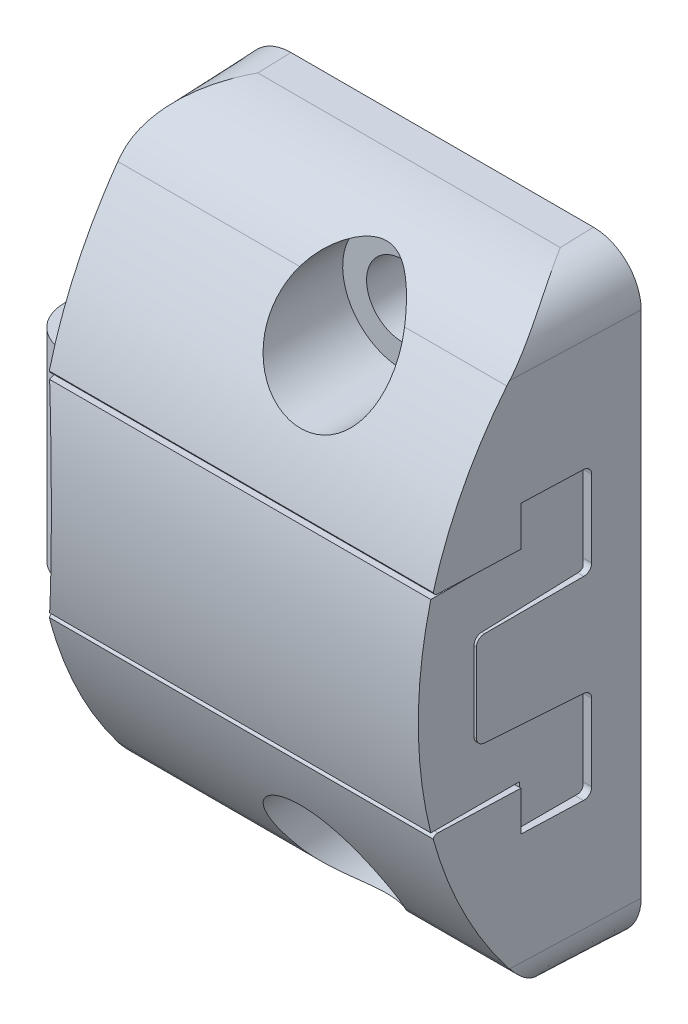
ISO-10303-21;
HEADER;
FILE_DESCRIPTION(('STEP AP214'),'2;1');
FILE_NAME('part.step','',(''),(''),'','','');
FILE_SCHEMA(('AUTOMOTIVE_DESIGN { 1 0 10303 214 1 1 1 1 }'));
ENDSEC;
DATA;
#1=APPLICATION_CONTEXT('core data for automotive mechanical design processes');
#2=APPLICATION_PROTOCOL_DEFINITION('international standard','automotive_design',2000,#1);
#3=PRODUCT_CONTEXT('',#1,'mechanical');
#4=PRODUCT('Part','Part','',(#3));
#5=PRODUCT_RELATED_PRODUCT_CATEGORY('part','',(#4));
#6=PRODUCT_DEFINITION_FORMATION('','',#4);
#7=PRODUCT_DEFINITION_CONTEXT('part definition',#1,'design');
#8=PRODUCT_DEFINITION('design','',#6,#7);
#9=PRODUCT_DEFINITION_SHAPE('','',#8);
#10=(LENGTH_UNIT() NAMED_UNIT(*) SI_UNIT(.MILLI.,.METRE.));
#11=(NAMED_UNIT(*) PLANE_ANGLE_UNIT() SI_UNIT($,.RADIAN.));
#12=(NAMED_UNIT(*) SI_UNIT($,.STERADIAN.) SOLID_ANGLE_UNIT());
#13=UNCERTAINTY_MEASURE_WITH_UNIT(LENGTH_MEASURE(1.E-05),#10,'distance_accuracy_value','');
#14=(GEOMETRIC_REPRESENTATION_CONTEXT(3) GLOBAL_UNCERTAINTY_ASSIGNED_CONTEXT((#13)) GLOBAL_UNIT_ASSIGNED_CONTEXT((#10,
#11,#12)) REPRESENTATION_CONTEXT('',''));
#15=CARTESIAN_POINT('',(0.,0.,0.));
#16=DIRECTION('',(0.,0.,1.));
#17=DIRECTION('',(1.,0.,0.));
#18=AXIS2_PLACEMENT_3D('',#15,#16,#17);
#19=CARTESIAN_POINT('',(-7.49400541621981E-13,16.,-7.105427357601E-12));
#20=DIRECTION('',(-0.999390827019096,0.,0.034899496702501));
#21=DIRECTION('',(0.034899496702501,4.4545328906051E-13,0.999390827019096));
#22=AXIS2_PLACEMENT_3D('',#19,#20,#21);
#23=PLANE('',#22);
#24=CARTESIAN_POINT('',(0.375398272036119,3.83587205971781,10.7499999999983));
#25=CARTESIAN_POINT('',(0.376735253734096,3.92713424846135,10.7882861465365));
#26=CARTESIAN_POINT('',(0.378119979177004,4.01782211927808,10.827939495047));
#27=CARTESIAN_POINT('',(0.380978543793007,4.19765010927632,10.9097980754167));
#28=CARTESIAN_POINT('',(0.382452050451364,4.28679456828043,10.9519937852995));
#29=CARTESIAN_POINT('',(0.385487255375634,4.46354888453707,11.0389106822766));
#30=CARTESIAN_POINT('',(0.387048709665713,4.55116218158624,11.0836248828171));
#31=CARTESIAN_POINT('',(0.390259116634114,4.72486411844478,11.1755589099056));
#32=CARTESIAN_POINT('',(0.391907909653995,4.81095518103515,11.2227741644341));
#33=CARTESIAN_POINT('',(0.395292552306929,4.98161909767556,11.3196976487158));
#34=CARTESIAN_POINT('',(0.397028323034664,5.06619323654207,11.3694036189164));
#35=CARTESIAN_POINT('',(0.400586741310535,5.23382739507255,11.471303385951));
#36=CARTESIAN_POINT('',(0.402409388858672,5.31688741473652,11.523497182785));
#37=CARTESIAN_POINT('',(0.40614161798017,5.48149347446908,11.6303742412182));
#38=CARTESIAN_POINT('',(0.408051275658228,5.56303809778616,11.6850596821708));
#39=CARTESIAN_POINT('',(0.411957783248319,5.72460815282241,11.7969274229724));
#40=CARTESIAN_POINT('',(0.413954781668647,5.80463063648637,11.8541139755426));
#41=CARTESIAN_POINT('',(0.418036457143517,5.96314670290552,11.9709978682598));
#42=CARTESIAN_POINT('',(0.420121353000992,6.04163565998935,12.030701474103));
#43=CARTESIAN_POINT('',(0.424379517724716,6.19707093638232,12.1526393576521));
#44=CARTESIAN_POINT('',(0.42655307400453,6.27401079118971,12.2148818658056));
#45=CARTESIAN_POINT('',(0.428766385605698,6.35000000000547,12.2782628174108));
#46=B_SPLINE_CURVE_WITH_KNOTS('',3,(#24,#25,#26,#27,#28,#29,#30,#31,#32,#33,#34,#35,#36,#37,#38,
#39,#40,#41,#42,#43,#44,#45),.UNSPECIFIED.,.F.,.F.,(4,2,2,2,2,2,2,2,2,2,4),(0.,
0.296919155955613,0.592788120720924,0.887873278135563,1.18243646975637,1.4767371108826,
1.77103775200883,2.06560094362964,2.36068610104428,2.65655506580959,2.9534742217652),.UNSPECIFIED.);
#47=CARTESIAN_POINT('',(0.375398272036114,3.83587205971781,10.7499999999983));
#48=VERTEX_POINT('',#47);
#49=CARTESIAN_POINT('',(0.428766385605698,6.35000000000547,12.2782628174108));
#50=VERTEX_POINT('',#49);
#51=EDGE_CURVE('E18',#48,#50,#46,.T.);
#52=ORIENTED_EDGE('',*,*,#51,.T.);
#53=DIRECTION('',(0.034899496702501,4.4545328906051E-13,0.999390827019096));
#54=VECTOR('',#53,1.);
#55=CARTESIAN_POINT('',(-2.97418339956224E-13,6.35,-2.8199664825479E-12));
#56=LINE('',#55,#54);
#57=CARTESIAN_POINT('',(0.375398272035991,6.35000000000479,10.7499999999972));
#58=VERTEX_POINT('',#57);
#59=EDGE_CURVE('E1032',#50,#58,#56,.F.);
#60=ORIENTED_EDGE('',*,*,#59,.T.);
#61=DIRECTION('',(0.,1.,-4.44089209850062E-13));
#62=VECTOR('',#61,1.);
#63=CARTESIAN_POINT('',(0.375398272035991,6.35000000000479,10.7499999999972));
#64=LINE('',#63,#62);
#65=EDGE_CURVE('E1017',#58,#48,#64,.F.);
#66=ORIENTED_EDGE('',*,*,#65,.T.);
#67=EDGE_LOOP('',(#52,#60,#66));
#68=FACE_BOUND('',#67,.T.);
#69=ADVANCED_FACE('F14',(#68),#23,.T.);
#70=CARTESIAN_POINT('',(-7.49400541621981E-13,16.,-7.105427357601E-12));
#71=DIRECTION('',(-0.999390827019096,0.,0.034899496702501));
#72=DIRECTION('',(0.034899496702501,4.4545328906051E-13,0.999390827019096));
#73=AXIS2_PLACEMENT_3D('',#70,#71,#72);
#74=PLANE('',#73);
#75=DIRECTION('',(0.034899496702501,4.4545328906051E-13,0.999390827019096));
#76=VECTOR('',#75,1.);
#77=CARTESIAN_POINT('',(2.97418339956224E-13,-6.35,2.8199664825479E-12));
#78=LINE('',#77,#76);
#79=CARTESIAN_POINT('',(0.375398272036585,-6.34999999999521,10.7500000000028));
#80=VERTEX_POINT('',#79);
#81=CARTESIAN_POINT('',(0.428766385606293,-6.34999999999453,12.2782628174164));
#82=VERTEX_POINT('',#81);
#83=EDGE_CURVE('E324',#80,#82,#78,.T.);
#84=ORIENTED_EDGE('',*,*,#83,.T.);
#85=CARTESIAN_POINT('',(0.428766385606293,-6.34999999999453,12.2782628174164));
#86=CARTESIAN_POINT('',(0.426553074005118,-6.27401079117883,12.2148818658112));
#87=CARTESIAN_POINT('',(0.424379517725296,-6.1970709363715,12.1526393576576));
#88=CARTESIAN_POINT('',(0.420121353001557,-6.04163565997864,12.0307014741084));
#89=CARTESIAN_POINT('',(0.418036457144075,-5.96314670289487,11.9709978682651));
#90=CARTESIAN_POINT('',(0.41395478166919,-5.80463063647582,11.8541139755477));
#91=CARTESIAN_POINT('',(0.411957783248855,-5.7246081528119,11.7969274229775));
#92=CARTESIAN_POINT('',(0.408051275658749,-5.56303809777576,11.6850596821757));
#93=CARTESIAN_POINT('',(0.406141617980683,-5.48149347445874,11.6303742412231));
#94=CARTESIAN_POINT('',(0.402409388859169,-5.31688741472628,11.5234971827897));
#95=CARTESIAN_POINT('',(0.400586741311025,-5.23382739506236,11.4713033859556));
#96=CARTESIAN_POINT('',(0.397028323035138,-5.06619323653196,11.3694036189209));
#97=CARTESIAN_POINT('',(0.395292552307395,-4.98161909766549,11.3196976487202));
#98=CARTESIAN_POINT('',(0.391907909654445,-4.81095518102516,11.2227741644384));
#99=CARTESIAN_POINT('',(0.390259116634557,-4.72486411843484,11.1755589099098));
#100=CARTESIAN_POINT('',(0.38704870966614,-4.55116218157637,11.0836248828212));
#101=CARTESIAN_POINT('',(0.385487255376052,-4.46354888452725,11.0389106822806));
#102=CARTESIAN_POINT('',(0.382452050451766,-4.28679456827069,10.9519937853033));
#103=CARTESIAN_POINT('',(0.380978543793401,-4.19765010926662,10.9097980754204));
#104=CARTESIAN_POINT('',(0.378119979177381,-4.01782211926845,10.8279394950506));
#105=CARTESIAN_POINT('',(0.376735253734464,-3.92713424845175,10.78828614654));
#106=CARTESIAN_POINT('',(0.375398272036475,-3.83587205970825,10.7500000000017));
#107=B_SPLINE_CURVE_WITH_KNOTS('',3,(#85,#86,#87,#88,#89,#90,#91,#92,#93,#94,#95,#96,#97,#98,
#99,#100,#101,#102,#103,#104,#105,#106),.UNSPECIFIED.,.F.,.F.,(4,2,2,2,2,2,2,2,2,2,4),(0.,
0.29691915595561,0.592788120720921,0.887873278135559,1.18243646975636,1.47673711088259,
1.77103775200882,2.06560094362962,2.36068610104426,2.65655506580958,2.95347422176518),.UNSPECIFIED.);
#108=CARTESIAN_POINT('',(0.375398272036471,-3.83587205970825,10.7500000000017));
#109=VERTEX_POINT('',#108);
#110=EDGE_CURVE('E959',#82,#109,#107,.T.);
#111=ORIENTED_EDGE('',*,*,#110,.T.);
#112=DIRECTION('',(0.,1.,-4.44089209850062E-13));
#113=VECTOR('',#112,1.);
#114=CARTESIAN_POINT('',(0.375398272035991,6.35000000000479,10.7499999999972));
#115=LINE('',#114,#113);
#116=EDGE_CURVE('E1013',#109,#80,#115,.F.);
#117=ORIENTED_EDGE('',*,*,#116,.T.);
#118=EDGE_LOOP('',(#84,#111,#117));
#119=FACE_BOUND('',#118,.T.);
#120=ADVANCED_FACE('F1106',(#119),#74,.T.);
#121=CARTESIAN_POINT('',(-0.500000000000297,6.35000000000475,10.7499999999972));
#122=DIRECTION('',(0.,-4.44089209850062E-13,-1.));
#123=DIRECTION('',(0.,1.,-4.44089209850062E-13));
#124=AXIS2_PLACEMENT_3D('',#121,#122,#123);
#125=PLANE('',#124);
#126=ORIENTED_EDGE('',*,*,#116,.F.);
#127=CARTESIAN_POINT('',(0.375398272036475,-3.83587205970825,10.7500000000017));
#128=CARTESIAN_POINT('',(0.403716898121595,-3.62306946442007,10.7500000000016));
#129=CARTESIAN_POINT('',(0.429678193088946,-3.40995320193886,10.7500000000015));
#130=CARTESIAN_POINT('',(0.476818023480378,-2.98371518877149,10.7500000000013));
#131=CARTESIAN_POINT('',(0.498007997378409,-2.77059470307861,10.7500000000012));
#132=CARTESIAN_POINT('',(0.535637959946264,-2.34435068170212,10.750000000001));
#133=CARTESIAN_POINT('',(0.552087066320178,-2.13122795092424,10.7500000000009));
#134=CARTESIAN_POINT('',(0.580261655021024,-1.70498137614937,10.7500000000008));
#135=CARTESIAN_POINT('',(0.591993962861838,-1.49185798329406,10.7500000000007));
#136=CARTESIAN_POINT('',(0.610754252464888,-1.06561144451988,10.7500000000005));
#137=CARTESIAN_POINT('',(0.617786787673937,-0.852488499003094,10.7500000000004));
#138=CARTESIAN_POINT('',(0.627160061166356,-0.426243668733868,10.7500000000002));
#139=CARTESIAN_POINT('',(0.62950309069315,-0.213121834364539,10.7500000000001));
#140=CARTESIAN_POINT('',(0.629503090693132,0.213121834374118,10.7499999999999));
#141=CARTESIAN_POINT('',(0.627160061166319,0.426243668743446,10.7499999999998));
#142=CARTESIAN_POINT('',(0.617786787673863,0.852488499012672,10.7499999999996));
#143=CARTESIAN_POINT('',(0.610754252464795,1.06561144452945,10.7499999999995));
#144=CARTESIAN_POINT('',(0.591993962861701,1.49185798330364,10.7499999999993));
#145=CARTESIAN_POINT('',(0.580261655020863,1.70498137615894,10.7499999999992));
#146=CARTESIAN_POINT('',(0.552087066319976,2.13122795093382,10.7499999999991));
#147=CARTESIAN_POINT('',(0.535637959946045,2.34435068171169,10.749999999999));
#148=CARTESIAN_POINT('',(0.498007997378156,2.77059470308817,10.7499999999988));
#149=CARTESIAN_POINT('',(0.476818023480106,2.98371518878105,10.7499999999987));
#150=CARTESIAN_POINT('',(0.429678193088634,3.40995320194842,10.7499999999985));
#151=CARTESIAN_POINT('',(0.403716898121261,3.62306946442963,10.7499999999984));
#152=CARTESIAN_POINT('',(0.375398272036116,3.83587205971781,10.7499999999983));
#153=B_SPLINE_CURVE_WITH_KNOTS('',3,(#127,#128,#129,#130,#131,#132,#133,#134,#135,#136,#137,
#138,#139,#140,#141,#142,#143,#144,#145,#146,#147,#148,#149,#150,#151,#152),.UNSPECIFIED.,.F.,
.F.,(4,2,2,2,2,2,2,2,2,2,2,2,4),(0.,0.644022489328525,1.28648419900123,1.92770194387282,
2.56798843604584,3.20765367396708,3.84700630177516,4.48635892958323,5.12602416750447,
5.76631065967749,6.40752840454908,7.04999011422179,7.69401260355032),.UNSPECIFIED.);
#154=EDGE_CURVE('E1044',#109,#48,#153,.T.);
#155=ORIENTED_EDGE('',*,*,#154,.T.);
#156=ORIENTED_EDGE('',*,*,#65,.F.);
#157=DIRECTION('',(1.,0.,0.));
#158=VECTOR('',#157,1.);
#159=CARTESIAN_POINT('',(-0.500000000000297,6.35000000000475,10.7499999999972));
#160=LINE('',#159,#158);
#161=CARTESIAN_POINT('',(-0.500000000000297,6.35000000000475,10.7499999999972));
#162=VERTEX_POINT('',#161);
#163=EDGE_CURVE('E1021',#162,#58,#160,.T.);
#164=ORIENTED_EDGE('',*,*,#163,.F.);
#165=DIRECTION('',(0.,1.,-4.44089209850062E-13));
#166=VECTOR('',#165,1.);
#167=CARTESIAN_POINT('',(-0.500000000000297,6.35000000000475,10.7499999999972));
#168=LINE('',#167,#166);
#169=CARTESIAN_POINT('',(-0.499999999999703,-6.34999999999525,10.7500000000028));
#170=VERTEX_POINT('',#169);
#171=EDGE_CURVE('E1095',#170,#162,#168,.T.);
#172=ORIENTED_EDGE('',*,*,#171,.F.);
#173=DIRECTION('',(1.,0.,0.));
#174=VECTOR('',#173,1.);
#175=CARTESIAN_POINT('',(-0.499999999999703,-6.34999999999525,10.7500000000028));
#176=LINE('',#175,#174);
#177=EDGE_CURVE('E1016',#80,#170,#176,.F.);
#178=ORIENTED_EDGE('',*,*,#177,.F.);
#179=EDGE_LOOP('',(#126,#155,#156,#164,#172,#178));
#180=FACE_BOUND('',#179,.T.);
#181=ADVANCED_FACE('F1003',(#180),#125,.F.);
#182=CARTESIAN_POINT('',(-28.45,7.94199775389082E-12,20.9));
#183=DIRECTION('',(0.,1.,-4.44089209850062E-13));
#184=DIRECTION('',(-1.,0.,0.));
#185=AXIS2_PLACEMENT_3D('',#182,#183,#184);
#186=SPHERICAL_SURFACE('',#185,30.8);
#187=ORIENTED_EDGE('',*,*,#110,.F.);
#188=CARTESIAN_POINT('',(0.428766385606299,-6.34999999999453,12.2782628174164));
#189=CARTESIAN_POINT('',(0.493467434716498,-6.34999999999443,12.4949809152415));
#190=CARTESIAN_POINT('',(0.5549086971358,-6.34999999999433,12.712645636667));
#191=B_SPLINE_CURVE_WITH_KNOTS('',2,(#188,#189,#190),.UNSPECIFIED.,.F.,.F.,(3,3),(0.,1.),.UNSPECIFIED.);
#192=CARTESIAN_POINT('',(0.554908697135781,-6.34999999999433,12.712645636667));
#193=VERTEX_POINT('',#192);
#194=EDGE_CURVE('E955',#193,#82,#191,.F.);
#195=ORIENTED_EDGE('',*,*,#194,.F.);
#196=CARTESIAN_POINT('',(0.554908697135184,6.35000000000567,12.7126456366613));
#197=CARTESIAN_POINT('',(0.644698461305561,6.0404412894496,12.7906270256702));
#198=CARTESIAN_POINT('',(0.728003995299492,5.72765432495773,12.8633258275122));
#199=CARTESIAN_POINT('',(0.881374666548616,5.09640963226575,12.9976576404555));
#200=CARTESIAN_POINT('',(0.951435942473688,4.77795027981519,13.0592874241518));
#201=CARTESIAN_POINT('',(1.0779982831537,4.13630376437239,13.1709387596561));
#202=CARTESIAN_POINT('',(1.1344983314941,3.81311624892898,13.220959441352));
#203=CARTESIAN_POINT('',(1.23371920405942,3.16284457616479,13.3089927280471));
#204=CARTESIAN_POINT('',(1.27643323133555,2.83575857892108,13.3469994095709));
#205=CARTESIAN_POINT('',(1.34785289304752,2.17889517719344,13.410640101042));
#206=CARTESIAN_POINT('',(1.37656014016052,1.84911808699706,13.436275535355));
#207=CARTESIAN_POINT('',(1.41984580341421,1.18794775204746,13.4749586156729));
#208=CARTESIAN_POINT('',(1.43442538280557,0.85655464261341,13.4880072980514));
#209=CARTESIAN_POINT('',(1.45314985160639,0.0263689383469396,13.5047627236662));
#210=CARTESIAN_POINT('',(1.44836530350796,-0.472832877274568,13.5004761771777));
#211=CARTESIAN_POINT('',(1.40676208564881,-1.46882824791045,13.4632607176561));
#212=CARTESIAN_POINT('',(1.36994291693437,-1.9656217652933,13.4303313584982));
#213=CARTESIAN_POINT('',(1.28229481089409,-2.78779411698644,13.3522183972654));
#214=CARTESIAN_POINT('',(1.24027779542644,-3.1149000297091,13.3148235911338));
#215=CARTESIAN_POINT('',(1.14243451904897,-3.76538358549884,13.2279906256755));
#216=CARTESIAN_POINT('',(1.08661050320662,-4.08876182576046,13.1785544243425));
#217=CARTESIAN_POINT('',(0.961419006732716,-4.73068233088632,13.0680786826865));
#218=CARTESIAN_POINT('',(0.89205964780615,-5.04922737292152,13.0070461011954));
#219=CARTESIAN_POINT('',(0.776150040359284,-5.5308398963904,12.9054829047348));
#220=CARTESIAN_POINT('',(0.734400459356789,-5.69593601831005,12.8689719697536));
#221=CARTESIAN_POINT('',(0.647328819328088,-6.02431173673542,12.7930038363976));
#222=CARTESIAN_POINT('',(0.602010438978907,-6.18759301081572,12.7535496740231));
#223=CARTESIAN_POINT('',(0.554908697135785,-6.34999999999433,12.712645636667));
#224=B_SPLINE_CURVE_WITH_KNOTS('',3,(#196,#197,#198,#199,#200,#201,#202,#203,#204,#205,#206,
#207,#208,#209,#210,#211,#212,#213,#214,#215,#216,#217,#218,#219,#220,#221,#222,#223),
.UNSPECIFIED.,.F.,.F.,(4,2,2,2,2,2,2,2,2,2,2,2,2,4),(0.,0.994753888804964,1.98979734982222,
2.98491536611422,3.98052326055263,4.97601649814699,5.97142776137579,7.46721452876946,
8.96302459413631,9.95825597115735,10.9533256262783,11.9478000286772,12.4702272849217,
12.9921229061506),.UNSPECIFIED.);
#225=CARTESIAN_POINT('',(0.554908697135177,6.35000000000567,12.7126456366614));
#226=VERTEX_POINT('',#225);
#227=EDGE_CURVE('E983',#226,#193,#224,.T.);
#228=ORIENTED_EDGE('',*,*,#227,.F.);
#229=CARTESIAN_POINT('',(0.554908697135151,6.35000000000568,12.7126456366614));
#230=CARTESIAN_POINT('',(0.4934674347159,6.35000000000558,12.4949809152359));
#231=CARTESIAN_POINT('',(0.428766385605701,6.35000000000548,12.2782628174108));
#232=B_SPLINE_CURVE_WITH_KNOTS('',2,(#229,#230,#231),.UNSPECIFIED.,.F.,.F.,(3,3),(0.,1.),.UNSPECIFIED.);
#233=EDGE_CURVE('E1053',#226,#50,#232,.T.);
#234=ORIENTED_EDGE('',*,*,#233,.T.);
#235=ORIENTED_EDGE('',*,*,#51,.F.);
#236=ORIENTED_EDGE('',*,*,#154,.F.);
#237=EDGE_LOOP('',(#187,#195,#228,#234,#235,#236));
#238=FACE_BOUND('',#237,.T.);
#239=ADVANCED_FACE('F996',(#238),#186,.F.);
#240=CARTESIAN_POINT('',(-0.500000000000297,6.35000000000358,8.11999999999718));
#241=DIRECTION('',(0.,1.,-4.44089209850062E-13));
#242=DIRECTION('',(0.,4.44089209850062E-13,1.));
#243=AXIS2_PLACEMENT_3D('',#240,#241,#242);
#244=CYLINDRICAL_SURFACE('',#243,2.63);
#245=CARTESIAN_POINT('',(-0.500000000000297,6.35000000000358,8.11999999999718));
#246=DIRECTION('',(0.,1.,-4.44089209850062E-13));
#247=DIRECTION('',(0.,4.44089209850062E-13,1.));
#248=AXIS2_PLACEMENT_3D('',#245,#246,#247);
#249=CIRCLE('',#248,2.63);
#250=CARTESIAN_POINT('',(-3.1300000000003,6.35000000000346,8.11999999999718));
#251=VERTEX_POINT('',#250);
#252=EDGE_CURVE('E994',#162,#251,#249,.F.);
#253=ORIENTED_EDGE('',*,*,#252,.T.);
#254=DIRECTION('',(0.,1.,-4.44089209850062E-13));
#255=VECTOR('',#254,1.);
#256=CARTESIAN_POINT('',(-3.1300000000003,6.35000000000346,8.11999999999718));
#257=LINE('',#256,#255);
#258=CARTESIAN_POINT('',(-3.12999999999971,-6.34999999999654,8.12000000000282));
#259=VERTEX_POINT('',#258);
#260=EDGE_CURVE('E1011',#251,#259,#257,.F.);
#261=ORIENTED_EDGE('',*,*,#260,.T.);
#262=CARTESIAN_POINT('',(-0.499999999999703,-6.34999999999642,8.12000000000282));
#263=DIRECTION('',(0.,1.,-4.44089209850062E-13));
#264=DIRECTION('',(0.,4.44089209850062E-13,1.));
#265=AXIS2_PLACEMENT_3D('',#262,#263,#264);
#266=CIRCLE('',#265,2.63);
#267=EDGE_CURVE('E952',#259,#170,#266,.T.);
#268=ORIENTED_EDGE('',*,*,#267,.T.);
#269=ORIENTED_EDGE('',*,*,#171,.T.);
#270=EDGE_LOOP('',(#253,#261,#268,#269));
#271=FACE_BOUND('',#270,.T.);
#272=ADVANCED_FACE('F1002',(#271),#244,.T.);
#273=CARTESIAN_POINT('',(-3.1300000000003,6.35000000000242,5.77999999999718));
#274=DIRECTION('',(1.,0.,0.));
#275=DIRECTION('',(0.,1.,-4.44089209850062E-13));
#276=AXIS2_PLACEMENT_3D('',#273,#274,#275);
#277=PLANE('',#276);
#278=ORIENTED_EDGE('',*,*,#260,.F.);
#279=DIRECTION('',(0.,-4.44089209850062E-13,-1.));
#280=VECTOR('',#279,1.);
#281=CARTESIAN_POINT('',(-3.1300000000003,6.35000000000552,12.76420392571));
#282=LINE('',#281,#280);
#283=CARTESIAN_POINT('',(-3.1300000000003,6.35000000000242,5.77999999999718));
#284=VERTEX_POINT('',#283);
#285=EDGE_CURVE('E1051',#251,#284,#282,.T.);
#286=ORIENTED_EDGE('',*,*,#285,.T.);
#287=DIRECTION('',(0.,1.,-4.44089209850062E-13));
#288=VECTOR('',#287,1.);
#289=CARTESIAN_POINT('',(-3.1300000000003,6.35000000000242,5.77999999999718));
#290=LINE('',#289,#288);
#291=CARTESIAN_POINT('',(-3.12999999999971,-6.34999999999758,5.78000000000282));
#292=VERTEX_POINT('',#291);
#293=EDGE_CURVE('E1087',#292,#284,#290,.T.);
#294=ORIENTED_EDGE('',*,*,#293,.F.);
#295=DIRECTION('',(0.,4.44089209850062E-13,1.));
#296=VECTOR('',#295,1.);
#297=CARTESIAN_POINT('',(-3.12999999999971,-6.34999999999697,7.15000000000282));
#298=LINE('',#297,#296);
#299=EDGE_CURVE('E960',#292,#259,#298,.T.);
#300=ORIENTED_EDGE('',*,*,#299,.T.);
#301=EDGE_LOOP('',(#278,#286,#294,#300));
#302=FACE_BOUND('',#301,.T.);
#303=ADVANCED_FACE('F1135',(#302),#277,.F.);
#304=CARTESIAN_POINT('',(-15.0000000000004,8.85000000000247,7.14999999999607));
#305=DIRECTION('',(0.,-1.,4.44089209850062E-13));
#306=DIRECTION('',(0.,-4.44089209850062E-13,-1.));
#307=AXIS2_PLACEMENT_3D('',#304,#305,#306);
#308=PLANE('',#307);
#309=DIRECTION('',(0.,4.44089209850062E-13,1.));
#310=VECTOR('',#309,1.);
#311=CARTESIAN_POINT('',(24.4999999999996,8.8500000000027,3.49999999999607));
#312=LINE('',#311,#310);
#313=CARTESIAN_POINT('',(24.4999999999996,8.8500000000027,3.49999999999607));
#314=VERTEX_POINT('',#313);
#315=CARTESIAN_POINT('',(24.4999999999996,8.85000000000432,7.14999999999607));
#316=VERTEX_POINT('',#315);
#317=EDGE_CURVE('E881',#314,#316,#312,.T.);
#318=ORIENTED_EDGE('',*,*,#317,.F.);
#319=DIRECTION('',(-1.,0.,0.));
#320=VECTOR('',#319,1.);
#321=CARTESIAN_POINT('',(-15.0000000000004,8.85000000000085,3.49999999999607));
#322=LINE('',#321,#320);
#323=CARTESIAN_POINT('',(0.122222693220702,8.85000000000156,3.49999999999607));
#324=VERTEX_POINT('',#323);
#325=EDGE_CURVE('E937',#324,#314,#322,.F.);
#326=ORIENTED_EDGE('',*,*,#325,.F.);
#327=DIRECTION('',(0.034899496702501,4.4545328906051E-13,0.999390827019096));
#328=VECTOR('',#327,1.);
#329=CARTESIAN_POINT('',(-4.14512174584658E-13,8.85,-3.93018950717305E-12));
#330=LINE('',#329,#328);
#331=CARTESIAN_POINT('',(0.249683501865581,8.85000000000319,7.14999999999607));
#332=VERTEX_POINT('',#331);
#333=EDGE_CURVE('E921',#332,#324,#330,.F.);
#334=ORIENTED_EDGE('',*,*,#333,.F.);
#335=DIRECTION('',(1.,0.,0.));
#336=VECTOR('',#335,1.);
#337=CARTESIAN_POINT('',(-15.0000000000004,8.85000000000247,7.14999999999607));
#338=LINE('',#337,#336);
#339=EDGE_CURVE('E1056',#332,#316,#338,.T.);
#340=ORIENTED_EDGE('',*,*,#339,.T.);
#341=EDGE_LOOP('',(#318,#326,#334,#340));
#342=FACE_BOUND('',#341,.T.);
#343=ADVANCED_FACE('F1225',(#342),#308,.F.);
#344=CARTESIAN_POINT('',(-15.0000000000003,6.35000000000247,7.14999999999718));
#345=DIRECTION('',(0.,-4.44436154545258E-13,-1.));
#346=DIRECTION('',(0.,1.,-4.44436154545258E-13));
#347=AXIS2_PLACEMENT_3D('',#344,#345,#346);
#348=PLANE('',#347);
#349=DIRECTION('',(0.,1.,-4.44089209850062E-13));
#350=VECTOR('',#349,1.);
#351=CARTESIAN_POINT('',(24.5000000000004,-8.49999999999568,7.15000000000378));
#352=LINE('',#351,#350);
#353=CARTESIAN_POINT('',(24.4999999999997,6.35000000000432,7.14999999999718));
#354=VERTEX_POINT('',#353);
#355=EDGE_CURVE('E878',#316,#354,#352,.F.);
#356=ORIENTED_EDGE('',*,*,#355,.F.);
#357=ORIENTED_EDGE('',*,*,#339,.F.);
#358=DIRECTION('',(0.,1.,-4.44089209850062E-13));
#359=VECTOR('',#358,1.);
#360=CARTESIAN_POINT('',(0.249683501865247,16.0000000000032,7.1499999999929));
#361=LINE('',#360,#359);
#362=CARTESIAN_POINT('',(0.249683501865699,6.35000000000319,7.14999999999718));
#363=VERTEX_POINT('',#362);
#364=EDGE_CURVE('E924',#363,#332,#361,.T.);
#365=ORIENTED_EDGE('',*,*,#364,.F.);
#366=DIRECTION('',(1.,0.,0.));
#367=VECTOR('',#366,1.);
#368=CARTESIAN_POINT('',(-15.0000000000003,6.35000000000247,7.14999999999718));
#369=LINE('',#368,#367);
#370=EDGE_CURVE('E1071',#363,#354,#369,.T.);
#371=ORIENTED_EDGE('',*,*,#370,.T.);
#372=EDGE_LOOP('',(#356,#357,#365,#371));
#373=FACE_BOUND('',#372,.T.);
#374=ADVANCED_FACE('F1223',(#373),#348,.F.);
#375=CARTESIAN_POINT('',(-15.0000000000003,6.35000000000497,12.76420392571));
#376=DIRECTION('',(0.,-1.,4.44089209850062E-13));
#377=DIRECTION('',(0.,-4.44089209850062E-13,-1.));
#378=AXIS2_PLACEMENT_3D('',#375,#376,#377);
#379=PLANE('',#378);
#380=DIRECTION('',(0.034899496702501,4.4545328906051E-13,0.999390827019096));
#381=VECTOR('',#380,1.);
#382=CARTESIAN_POINT('',(-2.97418339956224E-13,6.35,-2.8199664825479E-12));
#383=LINE('',#382,#381);
#384=CARTESIAN_POINT('',(0.110000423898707,6.3500000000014,3.14999999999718));
#385=VERTEX_POINT('',#384);
#386=EDGE_CURVE('E934',#385,#363,#383,.T.);
#387=ORIENTED_EDGE('',*,*,#386,.F.);
#388=DIRECTION('',(1.,0.,0.));
#389=VECTOR('',#388,1.);
#390=CARTESIAN_POINT('',(-15.0000000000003,6.3500000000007,3.14999999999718));
#391=LINE('',#390,#389);
#392=CARTESIAN_POINT('',(-0.500000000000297,6.35000000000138,3.14999999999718));
#393=VERTEX_POINT('',#392);
#394=EDGE_CURVE('E1054',#393,#385,#391,.T.);
#395=ORIENTED_EDGE('',*,*,#394,.F.);
#396=CARTESIAN_POINT('',(-0.500000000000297,6.35000000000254,5.77999999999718));
#397=DIRECTION('',(0.,1.,-4.44089209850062E-13));
#398=DIRECTION('',(0.,4.44089209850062E-13,1.));
#399=AXIS2_PLACEMENT_3D('',#396,#397,#398);
#400=CIRCLE('',#399,2.63);
#401=EDGE_CURVE('E918',#284,#393,#400,.F.);
#402=ORIENTED_EDGE('',*,*,#401,.F.);
#403=ORIENTED_EDGE('',*,*,#285,.F.);
#404=ORIENTED_EDGE('',*,*,#252,.F.);
#405=ORIENTED_EDGE('',*,*,#163,.T.);
#406=ORIENTED_EDGE('',*,*,#59,.F.);
#407=ORIENTED_EDGE('',*,*,#233,.F.);
#408=DIRECTION('',(1.,0.,0.));
#409=VECTOR('',#408,1.);
#410=CARTESIAN_POINT('',(30.,6.35000000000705,12.7126456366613));
#411=LINE('',#410,#409);
#412=CARTESIAN_POINT('',(24.4999999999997,6.35000000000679,12.7126456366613));
#413=VERTEX_POINT('',#412);
#414=EDGE_CURVE('E992',#413,#226,#411,.F.);
#415=ORIENTED_EDGE('',*,*,#414,.F.);
#416=DIRECTION('',(0.,4.44089209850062E-13,1.));
#417=VECTOR('',#416,1.);
#418=CARTESIAN_POINT('',(24.4999999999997,6.3500000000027,3.49999999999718));
#419=LINE('',#418,#417);
#420=EDGE_CURVE('E876',#354,#413,#419,.T.);
#421=ORIENTED_EDGE('',*,*,#420,.F.);
#422=ORIENTED_EDGE('',*,*,#370,.F.);
#423=EDGE_LOOP('',(#387,#395,#402,#403,#404,#405,#406,#407,#415,#421,#422));
#424=FACE_BOUND('',#423,.T.);
#425=ADVANCED_FACE('F978',(#424),#379,.F.);
#426=CARTESIAN_POINT('',(30.,-4.14078493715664E-12,-12.5));
#427=DIRECTION('',(1.,0.,0.));
#428=DIRECTION('',(0.,1.,-4.44089209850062E-13));
#429=AXIS2_PLACEMENT_3D('',#426,#427,#428);
#430=CYLINDRICAL_SURFACE('',#429,26.);
#431=DIRECTION('',(1.,0.,0.));
#432=VECTOR('',#431,1.);
#433=CARTESIAN_POINT('',(-14.9999999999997,-6.34999999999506,12.712645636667));
#434=LINE('',#433,#432);
#435=CARTESIAN_POINT('',(24.5000000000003,-6.34999999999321,12.712645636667));
#436=VERTEX_POINT('',#435);
#437=EDGE_CURVE('E991',#193,#436,#434,.T.);
#438=ORIENTED_EDGE('',*,*,#437,.T.);
#439=CARTESIAN_POINT('',(24.5,-4.3983913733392E-12,-12.5));
#440=DIRECTION('',(1.,0.,0.));
#441=DIRECTION('',(0.,1.,-4.44089209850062E-13));
#442=AXIS2_PLACEMENT_3D('',#439,#440,#441);
#443=CIRCLE('',#442,26.);
#444=EDGE_CURVE('E873',#413,#436,#443,.T.);
#445=ORIENTED_EDGE('',*,*,#444,.F.);
#446=ORIENTED_EDGE('',*,*,#414,.T.);
#447=ORIENTED_EDGE('',*,*,#227,.T.);
#448=EDGE_LOOP('',(#438,#445,#446,#447));
#449=FACE_BOUND('',#448,.T.);
#450=ADVANCED_FACE('F973',(#449),#430,.T.);
#451=CARTESIAN_POINT('',(-14.9999999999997,-6.34999999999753,7.15000000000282));
#452=DIRECTION('',(0.,1.,-4.44089209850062E-13));
#453=DIRECTION('',(0.,4.44089209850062E-13,1.));
#454=AXIS2_PLACEMENT_3D('',#451,#452,#453);
#455=PLANE('',#454);
#456=ORIENTED_EDGE('',*,*,#177,.T.);
#457=ORIENTED_EDGE('',*,*,#267,.F.);
#458=ORIENTED_EDGE('',*,*,#299,.F.);
#459=CARTESIAN_POINT('',(-0.499999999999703,-6.34999999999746,5.78000000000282));
#460=DIRECTION('',(0.,1.,-4.44089209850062E-13));
#461=DIRECTION('',(0.,4.44089209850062E-13,1.));
#462=AXIS2_PLACEMENT_3D('',#459,#460,#461);
#463=CIRCLE('',#462,2.63);
#464=CARTESIAN_POINT('',(-0.499999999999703,-6.34999999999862,3.15000000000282));
#465=VERTEX_POINT('',#464);
#466=EDGE_CURVE('E1089',#465,#292,#463,.T.);
#467=ORIENTED_EDGE('',*,*,#466,.F.);
#468=DIRECTION('',(1.,0.,0.));
#469=VECTOR('',#468,1.);
#470=CARTESIAN_POINT('',(-14.9999999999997,-6.3499999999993,3.15000000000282));
#471=LINE('',#470,#469);
#472=CARTESIAN_POINT('',(0.110000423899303,-6.3499999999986,3.15000000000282));
#473=VERTEX_POINT('',#472);
#474=EDGE_CURVE('E1120',#473,#465,#471,.F.);
#475=ORIENTED_EDGE('',*,*,#474,.F.);
#476=DIRECTION('',(0.034899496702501,4.4545328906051E-13,0.999390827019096));
#477=VECTOR('',#476,1.);
#478=CARTESIAN_POINT('',(2.97418339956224E-13,-6.35,2.8199664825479E-12));
#479=LINE('',#478,#477);
#480=CARTESIAN_POINT('',(0.249683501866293,-6.34999999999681,7.15000000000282));
#481=VERTEX_POINT('',#480);
#482=EDGE_CURVE('E913',#481,#473,#479,.F.);
#483=ORIENTED_EDGE('',*,*,#482,.F.);
#484=DIRECTION('',(1.,0.,0.));
#485=VECTOR('',#484,1.);
#486=CARTESIAN_POINT('',(-14.9999999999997,-6.34999999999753,7.15000000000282));
#487=LINE('',#486,#485);
#488=CARTESIAN_POINT('',(24.5000000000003,-6.34999999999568,7.15000000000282));
#489=VERTEX_POINT('',#488);
#490=EDGE_CURVE('E944',#481,#489,#487,.T.);
#491=ORIENTED_EDGE('',*,*,#490,.T.);
#492=DIRECTION('',(0.,4.44089209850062E-13,1.));
#493=VECTOR('',#492,1.);
#494=CARTESIAN_POINT('',(24.5000000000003,-6.3499999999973,3.50000000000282));
#495=LINE('',#494,#493);
#496=EDGE_CURVE('E871',#436,#489,#495,.F.);
#497=ORIENTED_EDGE('',*,*,#496,.F.);
#498=ORIENTED_EDGE('',*,*,#437,.F.);
#499=ORIENTED_EDGE('',*,*,#194,.T.);
#500=ORIENTED_EDGE('',*,*,#83,.F.);
#501=EDGE_LOOP('',(#456,#457,#458,#467,#475,#483,#491,#497,#498,#499,#500));
#502=FACE_BOUND('',#501,.T.);
#503=ADVANCED_FACE('F962',(#502),#455,.F.);
#504=CARTESIAN_POINT('',(-14.9999999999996,-8.84999999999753,7.15000000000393));
#505=DIRECTION('',(0.,-4.44783099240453E-13,-1.));
#506=DIRECTION('',(0.,1.,-4.44783099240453E-13));
#507=AXIS2_PLACEMENT_3D('',#504,#505,#506);
#508=PLANE('',#507);
#509=DIRECTION('',(0.,1.,-4.44089209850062E-13));
#510=VECTOR('',#509,1.);
#511=CARTESIAN_POINT('',(24.5000000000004,-8.49999999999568,7.15000000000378));
#512=LINE('',#511,#510);
#513=CARTESIAN_POINT('',(24.5000000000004,-8.84999999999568,7.15000000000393));
#514=VERTEX_POINT('',#513);
#515=EDGE_CURVE('E868',#489,#514,#512,.F.);
#516=ORIENTED_EDGE('',*,*,#515,.F.);
#517=ORIENTED_EDGE('',*,*,#490,.F.);
#518=DIRECTION('',(0.,1.,-4.44089209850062E-13));
#519=VECTOR('',#518,1.);
#520=CARTESIAN_POINT('',(0.249683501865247,16.0000000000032,7.1499999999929));
#521=LINE('',#520,#519);
#522=CARTESIAN_POINT('',(0.249683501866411,-8.84999999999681,7.15000000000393));
#523=VERTEX_POINT('',#522);
#524=EDGE_CURVE('E912',#523,#481,#521,.T.);
#525=ORIENTED_EDGE('',*,*,#524,.F.);
#526=DIRECTION('',(1.,0.,0.));
#527=VECTOR('',#526,1.);
#528=CARTESIAN_POINT('',(-14.9999999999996,-8.84999999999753,7.15000000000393));
#529=LINE('',#528,#527);
#530=EDGE_CURVE('E940',#523,#514,#529,.T.);
#531=ORIENTED_EDGE('',*,*,#530,.T.);
#532=EDGE_LOOP('',(#516,#517,#525,#531));
#533=FACE_BOUND('',#532,.T.);
#534=ADVANCED_FACE('F972',(#533),#508,.F.);
#535=CARTESIAN_POINT('',(-14.9999999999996,-8.84999999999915,3.50000000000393));
#536=DIRECTION('',(0.,1.,-4.44089209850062E-13));
#537=DIRECTION('',(0.,4.44089209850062E-13,1.));
#538=AXIS2_PLACEMENT_3D('',#535,#536,#537);
#539=PLANE('',#538);
#540=DIRECTION('',(0.,4.44089209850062E-13,1.));
#541=VECTOR('',#540,1.);
#542=CARTESIAN_POINT('',(24.5000000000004,-8.8499999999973,3.50000000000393));
#543=LINE('',#542,#541);
#544=CARTESIAN_POINT('',(24.5000000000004,-8.8499999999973,3.50000000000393));
#545=VERTEX_POINT('',#544);
#546=EDGE_CURVE('E865',#514,#545,#543,.F.);
#547=ORIENTED_EDGE('',*,*,#546,.F.);
#548=ORIENTED_EDGE('',*,*,#530,.F.);
#549=DIRECTION('',(0.034899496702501,4.4545328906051E-13,0.999390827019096));
#550=VECTOR('',#549,1.);
#551=CARTESIAN_POINT('',(4.14512174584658E-13,-8.85,3.93018950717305E-12));
#552=LINE('',#551,#550);
#553=CARTESIAN_POINT('',(0.122222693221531,-8.84999999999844,3.50000000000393));
#554=VERTEX_POINT('',#553);
#555=EDGE_CURVE('E909',#554,#523,#552,.T.);
#556=ORIENTED_EDGE('',*,*,#555,.F.);
#557=DIRECTION('',(-1.,0.,0.));
#558=VECTOR('',#557,1.);
#559=CARTESIAN_POINT('',(-14.9999999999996,-8.84999999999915,3.50000000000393));
#560=LINE('',#559,#558);
#561=EDGE_CURVE('E900',#545,#554,#560,.T.);
#562=ORIENTED_EDGE('',*,*,#561,.F.);
#563=EDGE_LOOP('',(#547,#548,#556,#562));
#564=FACE_BOUND('',#563,.T.);
#565=ADVANCED_FACE('F1303',(#564),#539,.F.);
#566=CARTESIAN_POINT('',(-15.0000000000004,8.50000000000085,3.49999999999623));
#567=DIRECTION('',(-1.,0.,0.));
#568=DIRECTION('',(0.,-1.,4.44089209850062E-13));
#569=AXIS2_PLACEMENT_3D('',#566,#567,#568);
#570=CYLINDRICAL_SURFACE('',#569,0.35);
#571=CARTESIAN_POINT('',(24.4999999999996,8.5000000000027,3.49999999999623));
#572=DIRECTION('',(-1.,0.,0.));
#573=DIRECTION('',(0.,-1.,4.44089209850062E-13));
#574=AXIS2_PLACEMENT_3D('',#571,#572,#573);
#575=CIRCLE('',#574,0.35);
#576=CARTESIAN_POINT('',(24.4999999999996,8.50000000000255,3.14999999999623));
#577=VERTEX_POINT('',#576);
#578=EDGE_CURVE('E883',#577,#314,#575,.F.);
#579=ORIENTED_EDGE('',*,*,#578,.F.);
#580=DIRECTION('',(1.,0.,0.));
#581=VECTOR('',#580,1.);
#582=CARTESIAN_POINT('',(-15.0000000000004,8.5000000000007,3.14999999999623));
#583=LINE('',#582,#581);
#584=CARTESIAN_POINT('',(0.110000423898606,8.5000000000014,3.14999999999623));
#585=VERTEX_POINT('',#584);
#586=EDGE_CURVE('E857',#577,#585,#583,.F.);
#587=ORIENTED_EDGE('',*,*,#586,.T.);
#588=CARTESIAN_POINT('',(0.122222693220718,8.50000000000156,3.49999999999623));
#589=DIRECTION('',(-0.999390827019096,0.,0.034899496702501));
#590=DIRECTION('',(-0.034899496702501,-4.4545328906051E-13,-0.999390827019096));
#591=AXIS2_PLACEMENT_3D('',#588,#589,#590);
#592=ELLIPSE('',#591,0.350213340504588,0.35);
#593=EDGE_CURVE('E923',#324,#585,#592,.T.);
#594=ORIENTED_EDGE('',*,*,#593,.F.);
#595=ORIENTED_EDGE('',*,*,#325,.T.);
#596=EDGE_LOOP('',(#579,#587,#594,#595));
#597=FACE_BOUND('',#596,.T.);
#598=ADVANCED_FACE('F1146',(#597),#570,.T.);
#599=CARTESIAN_POINT('',(-7.49400541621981E-13,16.,-7.105427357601E-12));
#600=DIRECTION('',(-0.999390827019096,0.,0.034899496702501));
#601=DIRECTION('',(0.034899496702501,4.4545328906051E-13,0.999390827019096));
#602=AXIS2_PLACEMENT_3D('',#599,#600,#601);
#603=PLANE('',#602);
#604=ORIENTED_EDGE('',*,*,#333,.T.);
#605=ORIENTED_EDGE('',*,*,#593,.T.);
#606=DIRECTION('',(0.,-1.,4.44089209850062E-13));
#607=VECTOR('',#606,1.);
#608=CARTESIAN_POINT('',(0.110000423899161,-3.32577296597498,3.15000000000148));
#609=LINE('',#608,#607);
#610=EDGE_CURVE('E929',#585,#385,#609,.T.);
#611=ORIENTED_EDGE('',*,*,#610,.T.);
#612=ORIENTED_EDGE('',*,*,#386,.T.);
#613=ORIENTED_EDGE('',*,*,#364,.T.);
#614=EDGE_LOOP('',(#604,#605,#611,#612,#613));
#615=FACE_BOUND('',#614,.T.);
#616=ADVANCED_FACE('F1142',(#615),#603,.T.);
#617=CARTESIAN_POINT('',(-0.500000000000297,6.35000000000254,5.77999999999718));
#618=DIRECTION('',(0.,1.,-4.44089209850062E-13));
#619=DIRECTION('',(0.,4.44089209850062E-13,1.));
#620=AXIS2_PLACEMENT_3D('',#617,#618,#619);
#621=CYLINDRICAL_SURFACE('',#620,2.63);
#622=ORIENTED_EDGE('',*,*,#401,.T.);
#623=DIRECTION('',(0.,-1.,4.44089209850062E-13));
#624=VECTOR('',#623,1.);
#625=CARTESIAN_POINT('',(-0.499999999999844,-3.32577296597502,3.15000000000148));
#626=LINE('',#625,#624);
#627=EDGE_CURVE('E906',#393,#465,#626,.T.);
#628=ORIENTED_EDGE('',*,*,#627,.T.);
#629=ORIENTED_EDGE('',*,*,#466,.T.);
#630=ORIENTED_EDGE('',*,*,#293,.T.);
#631=EDGE_LOOP('',(#622,#628,#629,#630));
#632=FACE_BOUND('',#631,.T.);
#633=ADVANCED_FACE('F1133',(#632),#621,.T.);
#634=CARTESIAN_POINT('',(-7.49400541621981E-13,16.,-7.105427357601E-12));
#635=DIRECTION('',(-0.999390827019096,0.,0.034899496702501));
#636=DIRECTION('',(0.034899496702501,4.4545328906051E-13,0.999390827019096));
#637=AXIS2_PLACEMENT_3D('',#634,#635,#636);
#638=PLANE('',#637);
#639=ORIENTED_EDGE('',*,*,#555,.T.);
#640=ORIENTED_EDGE('',*,*,#524,.T.);
#641=ORIENTED_EDGE('',*,*,#482,.T.);
#642=DIRECTION('',(0.,-1.,4.44089209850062E-13));
#643=VECTOR('',#642,1.);
#644=CARTESIAN_POINT('',(0.110000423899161,-3.32577296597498,3.15000000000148));
#645=LINE('',#644,#643);
#646=CARTESIAN_POINT('',(0.110000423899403,-8.4999999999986,3.15000000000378));
#647=VERTEX_POINT('',#646);
#648=EDGE_CURVE('E899',#473,#647,#645,.T.);
#649=ORIENTED_EDGE('',*,*,#648,.T.);
#650=CARTESIAN_POINT('',(0.122222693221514,-8.49999999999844,3.50000000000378));
#651=DIRECTION('',(-0.999390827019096,0.,0.034899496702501));
#652=DIRECTION('',(-0.034899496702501,-4.4545328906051E-13,-0.999390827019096));
#653=AXIS2_PLACEMENT_3D('',#650,#651,#652);
#654=ELLIPSE('',#653,0.350213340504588,0.35);
#655=EDGE_CURVE('E903',#554,#647,#654,.F.);
#656=ORIENTED_EDGE('',*,*,#655,.F.);
#657=EDGE_LOOP('',(#639,#640,#641,#649,#656));
#658=FACE_BOUND('',#657,.T.);
#659=ADVANCED_FACE('F1212',(#658),#638,.T.);
#660=CARTESIAN_POINT('',(-14.9999999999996,-8.49999999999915,3.50000000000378));
#661=DIRECTION('',(-1.,0.,0.));
#662=DIRECTION('',(0.,-1.,4.44089209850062E-13));
#663=AXIS2_PLACEMENT_3D('',#660,#661,#662);
#664=CYLINDRICAL_SURFACE('',#663,0.35);
#665=CARTESIAN_POINT('',(24.5000000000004,-8.4999999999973,3.50000000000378));
#666=DIRECTION('',(-1.,0.,0.));
#667=DIRECTION('',(0.,-1.,4.44089209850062E-13));
#668=AXIS2_PLACEMENT_3D('',#665,#666,#667);
#669=CIRCLE('',#668,0.35);
#670=CARTESIAN_POINT('',(24.5000000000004,-8.49999999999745,3.15000000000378));
#671=VERTEX_POINT('',#670);
#672=EDGE_CURVE('E867',#545,#671,#669,.F.);
#673=ORIENTED_EDGE('',*,*,#672,.F.);
#674=ORIENTED_EDGE('',*,*,#561,.T.);
#675=ORIENTED_EDGE('',*,*,#655,.T.);
#676=DIRECTION('',(1.,0.,0.));
#677=VECTOR('',#676,1.);
#678=CARTESIAN_POINT('',(-14.9999999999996,-8.49999999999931,3.15000000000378));
#679=LINE('',#678,#677);
#680=EDGE_CURVE('E896',#647,#671,#679,.T.);
#681=ORIENTED_EDGE('',*,*,#680,.T.);
#682=EDGE_LOOP('',(#673,#674,#675,#681));
#683=FACE_BOUND('',#682,.T.);
#684=ADVANCED_FACE('F1209',(#683),#664,.T.);
#685=CARTESIAN_POINT('',(24.5,3.68284438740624,3.49999999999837));
#686=DIRECTION('',(-1.,0.,0.));
#687=DIRECTION('',(0.,-1.,4.44089209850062E-13));
#688=AXIS2_PLACEMENT_3D('',#685,#686,#687);
#689=CYLINDRICAL_SURFACE('',#688,0.5);
#690=CARTESIAN_POINT('',(24.8777773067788,3.68284438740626,3.49999999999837));
#691=DIRECTION('',(0.999390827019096,0.,0.034899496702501));
#692=DIRECTION('',(-0.034899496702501,4.42184076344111E-13,0.999390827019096));
#693=AXIS2_PLACEMENT_3D('',#690,#691,#692);
#694=ELLIPSE('',#693,0.500304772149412,0.5);
#695=CARTESIAN_POINT('',(24.8952376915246,3.68284438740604,2.99999999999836));
#696=VERTEX_POINT('',#695);
#697=CARTESIAN_POINT('',(24.8783866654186,3.1831489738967,3.48255025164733));
#698=VERTEX_POINT('',#697);
#699=EDGE_CURVE('E893',#696,#698,#694,.F.);
#700=ORIENTED_EDGE('',*,*,#699,.F.);
#701=DIRECTION('',(1.,0.,0.));
#702=VECTOR('',#701,1.);
#703=CARTESIAN_POINT('',(24.5,3.68284438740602,2.99999999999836));
#704=LINE('',#703,#702);
#705=CARTESIAN_POINT('',(0.104762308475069,3.68284438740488,2.99999999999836));
#706=VERTEX_POINT('',#705);
#707=EDGE_CURVE('E661',#696,#706,#704,.F.);
#708=ORIENTED_EDGE('',*,*,#707,.T.);
#709=CARTESIAN_POINT('',(0.122222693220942,3.6828443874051,3.49999999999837));
#710=DIRECTION('',(-0.999390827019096,0.,0.034899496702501));
#711=DIRECTION('',(-0.034899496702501,-4.4545328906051E-13,-0.999390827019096));
#712=AXIS2_PLACEMENT_3D('',#709,#710,#711);
#713=ELLIPSE('',#712,0.500304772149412,0.5);
#714=CARTESIAN_POINT('',(0.110000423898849,3.32577296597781,3.14999999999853));
#715=VERTEX_POINT('',#714);
#716=EDGE_CURVE('E840',#715,#706,#713,.F.);
#717=ORIENTED_EDGE('',*,*,#716,.F.);
#718=DIRECTION('',(1.,0.,0.));
#719=VECTOR('',#718,1.);
#720=CARTESIAN_POINT('',(-15.,3.32577296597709,3.14999999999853));
#721=LINE('',#720,#719);
#722=CARTESIAN_POINT('',(24.5,3.32577296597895,3.14999999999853));
#723=VERTEX_POINT('',#722);
#724=EDGE_CURVE('E850',#715,#723,#721,.T.);
#725=ORIENTED_EDGE('',*,*,#724,.T.);
#726=CARTESIAN_POINT('',(24.5,3.68284438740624,3.49999999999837));
#727=DIRECTION('',(-1.,0.,0.));
#728=DIRECTION('',(0.,-1.,4.44089209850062E-13));
#729=AXIS2_PLACEMENT_3D('',#726,#727,#728);
#730=CIRCLE('',#729,0.5);
#731=CARTESIAN_POINT('',(24.5,3.18314897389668,3.48255025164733));
#732=VERTEX_POINT('',#731);
#733=EDGE_CURVE('E1150',#732,#723,#730,.F.);
#734=ORIENTED_EDGE('',*,*,#733,.F.);
#735=DIRECTION('',(-1.,0.,0.));
#736=VECTOR('',#735,1.);
#737=CARTESIAN_POINT('',(24.5,3.18314897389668,3.48255025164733));
#738=LINE('',#737,#736);
#739=EDGE_CURVE('E890',#698,#732,#738,.T.);
#740=ORIENTED_EDGE('',*,*,#739,.F.);
#741=EDGE_LOOP('',(#700,#708,#717,#725,#734,#740));
#742=FACE_BOUND('',#741,.T.);
#743=ADVANCED_FACE('F1164',(#742),#689,.F.);
#744=CARTESIAN_POINT('',(24.4999999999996,8.5000000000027,3.49999999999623));
#745=DIRECTION('',(-1.,0.,0.));
#746=DIRECTION('',(0.,-1.,4.44089209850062E-13));
#747=AXIS2_PLACEMENT_3D('',#744,#745,#746);
#748=CYLINDRICAL_SURFACE('',#747,0.5);
#749=CARTESIAN_POINT('',(0.122222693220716,8.50000000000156,3.49999999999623));
#750=DIRECTION('',(-0.999390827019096,0.,0.034899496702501));
#751=DIRECTION('',(-0.034899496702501,-4.4545328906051E-13,-0.999390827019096));
#752=AXIS2_PLACEMENT_3D('',#749,#750,#751);
#753=ELLIPSE('',#752,0.500304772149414,0.5);
#754=CARTESIAN_POINT('',(0.104762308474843,8.50000000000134,2.99999999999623));
#755=VERTEX_POINT('',#754);
#756=CARTESIAN_POINT('',(0.122222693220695,9.00000000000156,3.499999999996));
#757=VERTEX_POINT('',#756);
#758=EDGE_CURVE('E1152',#755,#757,#753,.F.);
#759=ORIENTED_EDGE('',*,*,#758,.F.);
#760=DIRECTION('',(1.,0.,0.));
#761=VECTOR('',#760,1.);
#762=CARTESIAN_POINT('',(24.4999999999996,8.50000000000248,2.99999999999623));
#763=LINE('',#762,#761);
#764=CARTESIAN_POINT('',(24.8952376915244,8.5000000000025,2.99999999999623));
#765=VERTEX_POINT('',#764);
#766=EDGE_CURVE('E658',#755,#765,#763,.T.);
#767=ORIENTED_EDGE('',*,*,#766,.T.);
#768=CARTESIAN_POINT('',(24.8777773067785,8.50000000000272,3.49999999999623));
#769=DIRECTION('',(0.999390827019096,0.,0.034899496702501));
#770=DIRECTION('',(-0.034899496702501,4.42184076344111E-13,0.999390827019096));
#771=AXIS2_PLACEMENT_3D('',#768,#769,#770);
#772=ELLIPSE('',#771,0.500304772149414,0.5);
#773=CARTESIAN_POINT('',(24.8777773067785,9.00000000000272,3.499999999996));
#774=VERTEX_POINT('',#773);
#775=EDGE_CURVE('E892',#774,#765,#772,.F.);
#776=ORIENTED_EDGE('',*,*,#775,.F.);
#777=DIRECTION('',(1.,0.,0.));
#778=VECTOR('',#777,1.);
#779=CARTESIAN_POINT('',(24.4999999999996,9.0000000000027,3.499999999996));
#780=LINE('',#779,#778);
#781=EDGE_CURVE('E665',#774,#757,#780,.F.);
#782=ORIENTED_EDGE('',*,*,#781,.T.);
#783=EDGE_LOOP('',(#759,#767,#776,#782));
#784=FACE_BOUND('',#783,.T.);
#785=ADVANCED_FACE('F1174',(#784),#748,.F.);
#786=CARTESIAN_POINT('',(24.5000000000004,-8.4999999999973,3.50000000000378));
#787=DIRECTION('',(1.,0.,0.));
#788=DIRECTION('',(0.,1.,-4.44089209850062E-13));
#789=AXIS2_PLACEMENT_3D('',#786,#787,#788);
#790=PLANE('',#789);
#791=ORIENTED_EDGE('',*,*,#546,.T.);
#792=ORIENTED_EDGE('',*,*,#672,.T.);
#793=DIRECTION('',(0.,-1.,4.44089209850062E-13));
#794=VECTOR('',#793,1.);
#795=CARTESIAN_POINT('',(24.5,-3.32577296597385,3.15000000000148));
#796=LINE('',#795,#794);
#797=CARTESIAN_POINT('',(24.5,-3.32577296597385,3.15000000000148));
#798=VERTEX_POINT('',#797);
#799=EDGE_CURVE('E894',#671,#798,#796,.F.);
#800=ORIENTED_EDGE('',*,*,#799,.T.);
#801=CARTESIAN_POINT('',(24.5,-3.68284438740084,3.50000000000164));
#802=DIRECTION('',(-1.,0.,0.));
#803=DIRECTION('',(0.,-1.,4.44089209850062E-13));
#804=AXIS2_PLACEMENT_3D('',#801,#802,#803);
#805=CIRCLE('',#804,0.5);
#806=CARTESIAN_POINT('',(24.5,-3.18314897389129,3.48255025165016));
#807=VERTEX_POINT('',#806);
#808=EDGE_CURVE('E1199',#798,#807,#805,.F.);
#809=ORIENTED_EDGE('',*,*,#808,.T.);
#810=DIRECTION('',(0.,0.0348994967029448,0.99939082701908));
#811=VECTOR('',#810,1.);
#812=CARTESIAN_POINT('',(24.5,-3.18314897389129,3.48255025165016));
#813=LINE('',#812,#811);
#814=CARTESIAN_POINT('',(24.5,-2.97240563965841,9.51744974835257));
#815=VERTEX_POINT('',#814);
#816=EDGE_CURVE('E642',#807,#815,#813,.T.);
#817=ORIENTED_EDGE('',*,*,#816,.T.);
#818=CARTESIAN_POINT('',(24.5,-2.47271022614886,9.5000000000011));
#819=DIRECTION('',(-1.,0.,0.));
#820=DIRECTION('',(0.,-1.,4.44089209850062E-13));
#821=AXIS2_PLACEMENT_3D('',#818,#819,#820);
#822=CIRCLE('',#821,0.5);
#823=CARTESIAN_POINT('',(24.5,-2.47271022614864,10.0000000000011));
#824=VERTEX_POINT('',#823);
#825=EDGE_CURVE('E594',#824,#815,#822,.F.);
#826=ORIENTED_EDGE('',*,*,#825,.F.);
#827=DIRECTION('',(0.,1.,-4.44089209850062E-13));
#828=VECTOR('',#827,1.);
#829=CARTESIAN_POINT('',(24.5,-2.47271022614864,10.0000000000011));
#830=LINE('',#829,#828);
#831=CARTESIAN_POINT('',(24.5,2.47271022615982,9.9999999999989));
#832=VERTEX_POINT('',#831);
#833=EDGE_CURVE('E652',#824,#832,#830,.T.);
#834=ORIENTED_EDGE('',*,*,#833,.T.);
#835=CARTESIAN_POINT('',(24.5,2.47271022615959,9.4999999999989));
#836=DIRECTION('',(-1.,0.,0.));
#837=DIRECTION('',(0.,-1.,4.44089209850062E-13));
#838=AXIS2_PLACEMENT_3D('',#835,#836,#837);
#839=CIRCLE('',#838,0.5);
#840=CARTESIAN_POINT('',(24.5,2.97240563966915,9.51744974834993));
#841=VERTEX_POINT('',#840);
#842=EDGE_CURVE('E656',#841,#832,#839,.F.);
#843=ORIENTED_EDGE('',*,*,#842,.F.);
#844=DIRECTION('',(0.,0.0348994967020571,-0.999390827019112));
#845=VECTOR('',#844,1.);
#846=CARTESIAN_POINT('',(24.5,2.97240563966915,9.51744974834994));
#847=LINE('',#846,#845);
#848=EDGE_CURVE('E657',#841,#732,#847,.T.);
#849=ORIENTED_EDGE('',*,*,#848,.T.);
#850=ORIENTED_EDGE('',*,*,#733,.T.);
#851=DIRECTION('',(0.,-1.,4.44089209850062E-13));
#852=VECTOR('',#851,1.);
#853=CARTESIAN_POINT('',(24.5,-3.32577296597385,3.15000000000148));
#854=LINE('',#853,#852);
#855=EDGE_CURVE('E853',#723,#577,#854,.F.);
#856=ORIENTED_EDGE('',*,*,#855,.T.);
#857=ORIENTED_EDGE('',*,*,#578,.T.);
#858=ORIENTED_EDGE('',*,*,#317,.T.);
#859=ORIENTED_EDGE('',*,*,#355,.T.);
#860=ORIENTED_EDGE('',*,*,#420,.T.);
#861=ORIENTED_EDGE('',*,*,#444,.T.);
#862=ORIENTED_EDGE('',*,*,#496,.T.);
#863=ORIENTED_EDGE('',*,*,#515,.T.);
#864=EDGE_LOOP('',(#791,#792,#800,#809,#817,#826,#834,#843,#849,#850,#856,#857,#858,#859,#860,
#861,#862,#863));
#865=FACE_BOUND('',#864,.T.);
#866=ADVANCED_FACE('F1204',(#865),#790,.T.);
#867=CARTESIAN_POINT('',(24.5,-3.68284438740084,3.50000000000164));
#868=DIRECTION('',(-1.,0.,0.));
#869=DIRECTION('',(0.,-1.,4.44089209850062E-13));
#870=AXIS2_PLACEMENT_3D('',#867,#868,#869);
#871=CYLINDRICAL_SURFACE('',#870,0.5);
#872=DIRECTION('',(1.,0.,0.));
#873=VECTOR('',#872,1.);
#874=CARTESIAN_POINT('',(-14.9999999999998,-3.3257729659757,3.15000000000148));
#875=LINE('',#874,#873);
#876=CARTESIAN_POINT('',(0.11000042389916,-3.32577296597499,3.15000000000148));
#877=VERTEX_POINT('',#876);
#878=EDGE_CURVE('E708',#798,#877,#875,.F.);
#879=ORIENTED_EDGE('',*,*,#878,.T.);
#880=CARTESIAN_POINT('',(0.122222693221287,-3.68284438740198,3.50000000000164));
#881=DIRECTION('',(-0.999390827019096,0.,0.034899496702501));
#882=DIRECTION('',(-0.034899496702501,-4.4545328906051E-13,-0.999390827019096));
#883=AXIS2_PLACEMENT_3D('',#880,#881,#882);
#884=ELLIPSE('',#883,0.500304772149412,0.5);
#885=CARTESIAN_POINT('',(0.104762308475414,-3.68284438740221,3.00000000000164));
#886=VERTEX_POINT('',#885);
#887=EDGE_CURVE('E841',#886,#877,#884,.F.);
#888=ORIENTED_EDGE('',*,*,#887,.F.);
#889=DIRECTION('',(1.,0.,0.));
#890=VECTOR('',#889,1.);
#891=CARTESIAN_POINT('',(24.5,-3.68284438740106,3.00000000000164));
#892=LINE('',#891,#890);
#893=CARTESIAN_POINT('',(24.895237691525,-3.68284438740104,3.00000000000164));
#894=VERTEX_POINT('',#893);
#895=EDGE_CURVE('E633',#886,#894,#892,.T.);
#896=ORIENTED_EDGE('',*,*,#895,.T.);
#897=CARTESIAN_POINT('',(24.8777773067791,-3.68284438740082,3.50000000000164));
#898=DIRECTION('',(0.999390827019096,0.,0.034899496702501));
#899=DIRECTION('',(-0.034899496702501,4.42184076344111E-13,0.999390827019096));
#900=AXIS2_PLACEMENT_3D('',#897,#898,#899);
#901=ELLIPSE('',#900,0.500304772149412,0.5);
#902=CARTESIAN_POINT('',(24.8783866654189,-3.18314897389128,3.48255025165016));
#903=VERTEX_POINT('',#902);
#904=EDGE_CURVE('E1202',#903,#894,#901,.F.);
#905=ORIENTED_EDGE('',*,*,#904,.F.);
#906=DIRECTION('',(1.,0.,0.));
#907=VECTOR('',#906,1.);
#908=CARTESIAN_POINT('',(24.5,-3.18314897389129,3.48255025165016));
#909=LINE('',#908,#907);
#910=EDGE_CURVE('E643',#903,#807,#909,.F.);
#911=ORIENTED_EDGE('',*,*,#910,.T.);
#912=ORIENTED_EDGE('',*,*,#808,.F.);
#913=EDGE_LOOP('',(#879,#888,#896,#905,#911,#912));
#914=FACE_BOUND('',#913,.T.);
#915=ADVANCED_FACE('F1366',(#914),#871,.F.);
#916=CARTESIAN_POINT('',(24.5000000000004,-8.4999999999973,3.50000000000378));
#917=DIRECTION('',(-1.,0.,0.));
#918=DIRECTION('',(0.,-1.,4.44089209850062E-13));
#919=AXIS2_PLACEMENT_3D('',#916,#917,#918);
#920=CYLINDRICAL_SURFACE('',#919,0.5);
#921=CARTESIAN_POINT('',(0.122222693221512,-8.49999999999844,3.50000000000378));
#922=DIRECTION('',(-0.999390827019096,0.,0.034899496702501));
#923=DIRECTION('',(-0.034899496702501,-4.4545328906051E-13,-0.999390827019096));
#924=AXIS2_PLACEMENT_3D('',#921,#922,#923);
#925=ELLIPSE('',#924,0.500304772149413,0.5);
#926=CARTESIAN_POINT('',(0.122222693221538,-8.99999999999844,3.500000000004));
#927=VERTEX_POINT('',#926);
#928=CARTESIAN_POINT('',(0.104762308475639,-8.49999999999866,3.00000000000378));
#929=VERTEX_POINT('',#928);
#930=EDGE_CURVE('E1195',#927,#929,#925,.F.);
#931=ORIENTED_EDGE('',*,*,#930,.F.);
#932=DIRECTION('',(1.,0.,0.));
#933=VECTOR('',#932,1.);
#934=CARTESIAN_POINT('',(24.5000000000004,-8.9999999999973,3.500000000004));
#935=LINE('',#934,#933);
#936=CARTESIAN_POINT('',(24.8777773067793,-8.99999999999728,3.500000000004));
#937=VERTEX_POINT('',#936);
#938=EDGE_CURVE('E628',#927,#937,#935,.T.);
#939=ORIENTED_EDGE('',*,*,#938,.T.);
#940=CARTESIAN_POINT('',(24.8777773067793,-8.49999999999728,3.50000000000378));
#941=DIRECTION('',(0.999390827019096,0.,0.034899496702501));
#942=DIRECTION('',(-0.034899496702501,4.42184076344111E-13,0.999390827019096));
#943=AXIS2_PLACEMENT_3D('',#940,#941,#942);
#944=ELLIPSE('',#943,0.500304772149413,0.5);
#945=CARTESIAN_POINT('',(24.8952376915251,-8.4999999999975,3.00000000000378));
#946=VERTEX_POINT('',#945);
#947=EDGE_CURVE('E1197',#946,#937,#944,.F.);
#948=ORIENTED_EDGE('',*,*,#947,.F.);
#949=DIRECTION('',(1.,0.,0.));
#950=VECTOR('',#949,1.);
#951=CARTESIAN_POINT('',(24.5000000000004,-8.49999999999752,3.00000000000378));
#952=LINE('',#951,#950);
#953=EDGE_CURVE('E636',#946,#929,#952,.F.);
#954=ORIENTED_EDGE('',*,*,#953,.T.);
#955=EDGE_LOOP('',(#931,#939,#948,#954));
#956=FACE_BOUND('',#955,.T.);
#957=ADVANCED_FACE('F574',(#956),#920,.F.);
#958=CARTESIAN_POINT('',(15.0000000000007,-13.9999999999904,20.0000000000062));
#959=DIRECTION('',(0.,-4.44089209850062E-13,-1.));
#960=DIRECTION('',(0.,1.,-4.44089209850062E-13));
#961=AXIS2_PLACEMENT_3D('',#958,#959,#960);
#962=CYLINDRICAL_SURFACE('',#961,3.75);
#963=CARTESIAN_POINT('',(15.0000000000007,-13.9999999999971,5.00000000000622));
#964=DIRECTION('',(0.,-4.44089209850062E-13,-1.));
#965=DIRECTION('',(0.,1.,-4.44089209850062E-13));
#966=AXIS2_PLACEMENT_3D('',#963,#964,#965);
#967=CIRCLE('',#966,3.75);
#968=CARTESIAN_POINT('',(15.0000000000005,-10.2499999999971,5.00000000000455));
#969=VERTEX_POINT('',#968);
#970=EDGE_CURVE('E709',#969,#969,#967,.F.);
#971=ORIENTED_EDGE('',*,*,#970,.F.);
#972=EDGE_LOOP('',(#971));
#973=FACE_BOUND('',#972,.T.);
#974=CARTESIAN_POINT('',(18.294632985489,-15.7910593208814,8.15532487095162));
#975=CARTESIAN_POINT('',(18.2316962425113,-15.9067436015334,8.06690922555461));
#976=CARTESIAN_POINT('',(18.1633238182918,-16.0180764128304,7.97676718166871));
#977=CARTESIAN_POINT('',(18.0163001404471,-16.2318939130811,7.79431075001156));
#978=CARTESIAN_POINT('',(17.9376461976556,-16.3343762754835,7.70199579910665));
#979=CARTESIAN_POINT('',(17.7698599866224,-16.5312556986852,7.5156045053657));
#980=CARTESIAN_POINT('',(17.6806317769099,-16.6255627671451,7.42151977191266));
#981=CARTESIAN_POINT('',(17.4925352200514,-16.8047542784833,7.23405907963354));
#982=CARTESIAN_POINT('',(17.3936699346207,-16.8896416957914,7.14068290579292));
#983=CARTESIAN_POINT('',(17.2188291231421,-17.0244572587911,6.98561554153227));
#984=CARTESIAN_POINT('',(17.145461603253,-17.076970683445,6.9232146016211));
#985=CARTESIAN_POINT('',(16.9939311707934,-17.1772620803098,6.80047726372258));
#986=CARTESIAN_POINT('',(16.9157693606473,-17.2250411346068,6.7401403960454));
#987=CARTESIAN_POINT('',(16.7545924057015,-17.3154821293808,6.62271291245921));
#988=CARTESIAN_POINT('',(16.6715913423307,-17.3581579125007,6.56561374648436));
#989=CARTESIAN_POINT('',(16.5002615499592,-17.438116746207,6.45586782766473));
#990=CARTESIAN_POINT('',(16.4119354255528,-17.4754024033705,6.40321892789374));
#991=CARTESIAN_POINT('',(16.2060625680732,-17.5528777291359,6.29131045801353));
#992=CARTESIAN_POINT('',(16.0868526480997,-17.5913383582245,6.23384531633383));
#993=CARTESIAN_POINT('',(15.8395329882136,-17.6570434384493,6.13355316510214));
#994=CARTESIAN_POINT('',(15.7114415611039,-17.6843102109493,6.09069705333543));
#995=CARTESIAN_POINT('',(15.470032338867,-17.7220804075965,6.0306274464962));
#996=CARTESIAN_POINT('',(15.3578248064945,-17.7346242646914,6.01032478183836));
#997=CARTESIAN_POINT('',(15.1309826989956,-17.7494299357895,5.98631555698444));
#998=CARTESIAN_POINT('',(15.0163501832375,-17.7517001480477,5.98259544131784));
#999=CARTESIAN_POINT('',(14.7881476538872,-17.7457513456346,5.99227615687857));
#1000=CARTESIAN_POINT('',(14.6745773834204,-17.7375349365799,6.00567273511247));
#1001=CARTESIAN_POINT('',(14.4514623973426,-17.711370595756,6.04771194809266));
#1002=CARTESIAN_POINT('',(14.3419223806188,-17.6934116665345,6.07637181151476));
#1003=CARTESIAN_POINT('',(14.0794988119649,-17.6387515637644,6.16180123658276));
#1004=CARTESIAN_POINT('',(13.9298974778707,-17.5972274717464,6.22543807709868));
#1005=CARTESIAN_POINT('',(13.6438629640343,-17.4994874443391,6.36922134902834));
#1006=CARTESIAN_POINT('',(13.5074790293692,-17.4432192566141,6.44942627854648));
#1007=CARTESIAN_POINT('',(13.2699135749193,-17.3291843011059,6.60474917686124));
#1008=CARTESIAN_POINT('',(13.1667381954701,-17.2733856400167,6.67831990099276));
#1009=CARTESIAN_POINT('',(12.9682041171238,-17.1540033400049,6.82968637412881));
#1010=CARTESIAN_POINT('',(12.8728506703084,-17.090414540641,6.90748490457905));
#1011=CARTESIAN_POINT('',(12.6895517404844,-16.9558841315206,7.06547121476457));
#1012=CARTESIAN_POINT('',(12.6016089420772,-16.8849398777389,7.1456598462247));
#1013=CARTESIAN_POINT('',(12.4330046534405,-16.7359975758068,7.30700214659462));
#1014=CARTESIAN_POINT('',(12.3523405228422,-16.6580021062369,7.38815545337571));
#1015=CARTESIAN_POINT('',(12.1645737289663,-16.4594358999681,7.58583228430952));
#1016=CARTESIAN_POINT('',(12.0613047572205,-16.335144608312,7.70232855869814));
#1017=CARTESIAN_POINT('',(11.9184928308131,-16.1385350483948,7.87457461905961));
#1018=CARTESIAN_POINT('',(11.8729845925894,-16.0714500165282,7.93146023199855));
#1019=CARTESIAN_POINT('',(11.7860598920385,-15.9338318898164,8.04422246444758));
#1020=CARTESIAN_POINT('',(11.7446445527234,-15.8632978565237,8.10009880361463));
#1021=CARTESIAN_POINT('',(11.7053670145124,-15.7910593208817,8.15532487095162));
#1022=B_SPLINE_CURVE_WITH_KNOTS('',3,(#974,#975,#976,#977,#978,#979,#980,#981,#982,#983,#984,
#985,#986,#987,#988,#989,#990,#991,#992,#993,#994,#995,#996,#997,#998,#999,#1000,#1001,#1002,
#1003,#1004,#1005,#1006,#1007,#1008,#1009,#1010,#1011,#1012,#1013,#1014,#1015,#1016,#1017,#1018,
#1019,#1020,#1021),.UNSPECIFIED.,.F.,.F.,(4,2,2,2,2,2,2,2,2,2,2,2,2,2,2,2,2,2,2,2,2,2,2,4),(0.,
0.475628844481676,0.951382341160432,1.43184126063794,1.9121480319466,2.24105614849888,
2.56988891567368,2.89780845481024,3.22556888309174,3.63781907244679,4.04924316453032,
4.39188432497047,4.73424534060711,5.07652130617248,5.41918444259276,5.91972033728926,
6.42205467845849,6.83689285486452,7.25200733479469,7.66727155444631,8.0823845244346,
8.67874141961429,8.97571248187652,9.27276480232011),.UNSPECIFIED.);
#1023=CARTESIAN_POINT('',(18.294632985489,-15.7910593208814,8.15532487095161));
#1024=VERTEX_POINT('',#1023);
#1025=CARTESIAN_POINT('',(11.7053670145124,-15.7910593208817,8.15532487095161));
#1026=VERTEX_POINT('',#1025);
#1027=EDGE_CURVE('E552',#1024,#1026,#1022,.T.);
#1028=ORIENTED_EDGE('',*,*,#1027,.F.);
#1029=CARTESIAN_POINT('',(11.7053670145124,-15.7910593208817,8.15532487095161));
#1030=CARTESIAN_POINT('',(11.6423161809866,-15.6750414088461,8.24403740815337));
#1031=CARTESIAN_POINT('',(11.585577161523,-15.5561039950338,8.33340076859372));
#1032=CARTESIAN_POINT('',(11.4849798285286,-15.3131850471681,8.51259060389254));
#1033=CARTESIAN_POINT('',(11.4411246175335,-15.1892023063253,8.60241718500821));
#1034=CARTESIAN_POINT('',(11.3663971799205,-14.9364170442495,8.78209720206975));
#1035=CARTESIAN_POINT('',(11.3355906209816,-14.8075936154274,8.87194854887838));
#1036=CARTESIAN_POINT('',(11.2876792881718,-14.5466047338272,9.05043534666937));
#1037=CARTESIAN_POINT('',(11.2705732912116,-14.4144395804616,9.13907090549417));
#1038=CARTESIAN_POINT('',(11.2509164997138,-14.1529335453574,9.31096051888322));
#1039=CARTESIAN_POINT('',(11.2478251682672,-14.0236829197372,9.39428976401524));
#1040=CARTESIAN_POINT('',(11.2551806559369,-13.7640005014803,9.55846498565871));
#1041=CARTESIAN_POINT('',(11.265625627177,-13.633568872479,9.6393112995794));
#1042=CARTESIAN_POINT('',(11.300481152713,-13.3728358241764,9.79776899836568));
#1043=CARTESIAN_POINT('',(11.3248726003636,-13.2425344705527,9.87538465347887));
#1044=CARTESIAN_POINT('',(11.3879939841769,-12.9832934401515,10.0267973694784));
#1045=CARTESIAN_POINT('',(11.4267134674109,-12.8543528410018,10.100597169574));
#1046=CARTESIAN_POINT('',(11.5146555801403,-12.6107158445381,10.2373609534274));
#1047=CARTESIAN_POINT('',(11.5626244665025,-12.4957792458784,10.3007031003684));
#1048=CARTESIAN_POINT('',(11.6707674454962,-12.2695623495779,10.4232277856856));
#1049=CARTESIAN_POINT('',(11.7309343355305,-12.1582799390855,10.4824127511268));
#1050=CARTESIAN_POINT('',(11.8634080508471,-11.9407521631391,10.5961793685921));
#1051=CARTESIAN_POINT('',(11.9357101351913,-11.8345048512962,10.6507628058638));
#1052=CARTESIAN_POINT('',(12.092207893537,-11.6285097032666,10.7549151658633));
#1053=CARTESIAN_POINT('',(12.1764012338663,-11.5287605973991,10.8044850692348));
#1054=CARTESIAN_POINT('',(12.3428666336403,-11.351478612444,10.891284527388));
#1055=CARTESIAN_POINT('',(12.4235809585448,-11.2728419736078,10.929254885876));
#1056=CARTESIAN_POINT('',(12.5928077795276,-11.1223726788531,11.0010589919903));
#1057=CARTESIAN_POINT('',(12.681318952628,-11.0505388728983,11.0348934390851));
#1058=CARTESIAN_POINT('',(12.8654799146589,-10.9146454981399,11.0982231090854));
#1059=CARTESIAN_POINT('',(12.9611251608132,-10.850581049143,11.1277210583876));
#1060=CARTESIAN_POINT('',(13.1588498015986,-10.7310542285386,11.1822463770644));
#1061=CARTESIAN_POINT('',(13.260928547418,-10.675590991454,11.207274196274));
#1062=CARTESIAN_POINT('',(13.458436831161,-10.5799580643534,11.2500927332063));
#1063=CARTESIAN_POINT('',(13.5532612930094,-10.5387602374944,11.2683864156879));
#1064=CARTESIAN_POINT('',(13.746583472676,-10.46415739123,11.3013250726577));
#1065=CARTESIAN_POINT('',(13.845082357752,-10.4307548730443,11.3159688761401));
#1066=CARTESIAN_POINT('',(14.0448882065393,-10.3721779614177,11.3415382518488));
#1067=CARTESIAN_POINT('',(14.1461930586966,-10.3469975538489,11.3524665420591));
#1068=CARTESIAN_POINT('',(14.3509117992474,-10.3051247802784,11.3705870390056));
#1069=CARTESIAN_POINT('',(14.4543264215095,-10.2884354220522,11.3777779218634));
#1070=CARTESIAN_POINT('',(14.6560751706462,-10.2645077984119,11.3880731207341));
#1071=CARTESIAN_POINT('',(14.7543378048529,-10.2567584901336,11.3913985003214));
#1072=CARTESIAN_POINT('',(14.9512609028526,-10.2490218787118,11.3947184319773));
#1073=CARTESIAN_POINT('',(15.0499214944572,-10.2490373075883,11.394711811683));
#1074=CARTESIAN_POINT('',(15.2468266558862,-10.2568356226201,11.3913654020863));
#1075=CARTESIAN_POINT('',(15.3450714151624,-10.2646144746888,11.3880273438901));
#1076=CARTESIAN_POINT('',(15.5405124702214,-10.2878529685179,11.3780284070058));
#1077=CARTESIAN_POINT('',(15.6377083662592,-10.3033154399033,11.3713663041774));
#1078=CARTESIAN_POINT('',(15.8287748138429,-10.3414531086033,11.3548689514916));
#1079=CARTESIAN_POINT('',(15.9226736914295,-10.3640088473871,11.345086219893));
#1080=CARTESIAN_POINT('',(16.108112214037,-10.4161636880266,11.3223495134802));
#1081=CARTESIAN_POINT('',(16.1996510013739,-10.4457653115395,11.3093944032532));
#1082=CARTESIAN_POINT('',(16.469723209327,-10.5447037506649,11.2658255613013));
#1083=CARTESIAN_POINT('',(16.6439086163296,-10.6242138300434,11.2304914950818));
#1084=CARTESIAN_POINT('',(16.9793454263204,-10.8090481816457,11.146879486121));
#1085=CARTESIAN_POINT('',(17.1402563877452,-10.9148705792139,11.0983498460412));
#1086=CARTESIAN_POINT('',(17.4416246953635,-11.1474223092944,10.9893898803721));
#1087=CARTESIAN_POINT('',(17.5820780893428,-11.2741556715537,10.9289572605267));
#1088=CARTESIAN_POINT('',(17.8475135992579,-11.5519047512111,10.7933183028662));
#1089=CARTESIAN_POINT('',(17.9711340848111,-11.7039000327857,10.7174603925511));
#1090=CARTESIAN_POINT('',(18.1911928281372,-12.0210880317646,10.5548308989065));
#1091=CARTESIAN_POINT('',(18.2876221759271,-12.1862850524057,10.4680557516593));
#1092=CARTESIAN_POINT('',(18.4609384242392,-12.54151915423,10.2761901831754));
#1093=CARTESIAN_POINT('',(18.5350073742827,-12.7324085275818,10.1701390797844));
#1094=CARTESIAN_POINT('',(18.6505340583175,-13.1186395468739,9.94885152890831));
#1095=CARTESIAN_POINT('',(18.6919749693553,-13.3139834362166,9.83361037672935));
#1096=CARTESIAN_POINT('',(18.7468591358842,-13.7297764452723,9.58075560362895));
#1097=CARTESIAN_POINT('',(18.7559883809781,-13.9502051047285,9.4421760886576));
#1098=CARTESIAN_POINT('',(18.7364895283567,-14.3856145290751,9.15921523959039));
#1099=CARTESIAN_POINT('',(18.7078435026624,-14.6005926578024,9.01483118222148));
#1100=CARTESIAN_POINT('',(18.6233754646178,-14.9820649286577,8.75044165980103));
#1101=CARTESIAN_POINT('',(18.5735365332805,-15.1501913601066,8.63084861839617));
#1102=CARTESIAN_POINT('',(18.4816422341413,-15.395811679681,8.45183152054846));
#1103=CARTESIAN_POINT('',(18.448196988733,-15.4765124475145,8.39228086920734));
#1104=CARTESIAN_POINT('',(18.3756465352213,-15.6355864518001,8.27350007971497));
#1105=CARTESIAN_POINT('',(18.3365407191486,-15.7139594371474,8.21426997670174));
#1106=CARTESIAN_POINT('',(18.2946329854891,-15.7910593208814,8.15532487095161));
#1107=B_SPLINE_CURVE_WITH_KNOTS('',3,(#1029,#1030,#1031,#1032,#1033,#1034,#1035,#1036,#1037,
#1038,#1039,#1040,#1041,#1042,#1043,#1044,#1045,#1046,#1047,#1048,#1049,#1050,#1051,#1052,#1053,
#1054,#1055,#1056,#1057,#1058,#1059,#1060,#1061,#1062,#1063,#1064,#1065,#1066,#1067,#1068,#1069,
#1070,#1071,#1072,#1073,#1074,#1075,#1076,#1077,#1078,#1079,#1080,#1081,#1082,#1083,#1084,#1085,
#1086,#1087,#1088,#1089,#1090,#1091,#1092,#1093,#1094,#1095,#1096,#1097,#1098,#1099,#1100,#1101,
#1102,#1103,#1104,#1105,#1106),.UNSPECIFIED.,.F.,.F.,(4,2,2,2,2,2,2,2,2,2,2,2,2,2,2,2,2,2,2,2,2,
2,2,2,2,2,2,2,2,2,2,2,2,2,2,2,2,2,4),(0.,0.477065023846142,0.954244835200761,1.43379832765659,
1.91330900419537,2.37415857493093,2.83494524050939,3.2951021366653,3.75492398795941,
4.17349796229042,4.59182549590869,5.00998997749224,5.42807250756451,5.78431676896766,
6.14050069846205,6.49645972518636,6.85238291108,7.16696029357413,7.48163847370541,
7.79608596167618,8.11064475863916,8.40615839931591,8.70177601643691,8.99724010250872,
9.29281307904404,9.58365318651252,9.87459753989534,10.4558911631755,11.0491618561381,
11.6425470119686,12.270195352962,12.8980491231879,13.5870511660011,14.2764082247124,
15.0549184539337,15.8337982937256,16.4690987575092,16.7861126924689,17.1031607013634),.UNSPECIFIED.);
#1108=EDGE_CURVE('E385',#1026,#1024,#1107,.T.);
#1109=ORIENTED_EDGE('',*,*,#1108,.F.);
#1110=EDGE_LOOP('',(#1028,#1109));
#1111=FACE_BOUND('',#1110,.T.);
#1112=ADVANCED_FACE('F569',(#973,#1111),#962,.F.);
#1113=CARTESIAN_POINT('',(-14.9999999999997,-6.79999999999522,12.3359114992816));
#1114=DIRECTION('',(-1.,0.,0.));
#1115=DIRECTION('',(0.,-1.,4.44089209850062E-13));
#1116=AXIS2_PLACEMENT_3D('',#1113,#1114,#1115);
#1117=CYLINDRICAL_SURFACE('',#1116,0.3);
#1118=DIRECTION('',(1.,0.,0.));
#1119=VECTOR('',#1118,1.);
#1120=CARTESIAN_POINT('',(24.5000000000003,-6.49999999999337,12.3359114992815));
#1121=LINE('',#1120,#1119);
#1122=CARTESIAN_POINT('',(24.5692204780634,-6.49999999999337,12.3359114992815));
#1123=VERTEX_POINT('',#1122);
#1124=CARTESIAN_POINT('',(0.430779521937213,-6.4999999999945,12.3359114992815));
#1125=VERTEX_POINT('',#1124);
#1126=EDGE_CURVE('E386',#1123,#1125,#1121,.F.);
#1127=ORIENTED_EDGE('',*,*,#1126,.T.);
#1128=CARTESIAN_POINT('',(0.430779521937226,-6.7999999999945,12.3359114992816));
#1129=DIRECTION('',(-0.999390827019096,0.,0.034899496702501));
#1130=DIRECTION('',(-0.034899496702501,-4.4545328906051E-13,-0.999390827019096));
#1131=AXIS2_PLACEMENT_3D('',#1128,#1129,#1130);
#1132=ELLIPSE('',#1131,0.300182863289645,0.3);
#1133=CARTESIAN_POINT('',(0.433548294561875,-6.51066709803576,12.4151987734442));
#1134=VERTEX_POINT('',#1133);
#1135=EDGE_CURVE('E1188',#1125,#1134,#1132,.F.);
#1136=ORIENTED_EDGE('',*,*,#1135,.T.);
#1137=CARTESIAN_POINT('',(0.433548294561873,-6.51066709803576,12.4151987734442));
#1138=CARTESIAN_POINT('',(0.43710783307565,-6.51485080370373,12.4305257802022));
#1139=CARTESIAN_POINT('',(0.440292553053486,-6.52030662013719,12.4456008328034));
#1140=CARTESIAN_POINT('',(0.445818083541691,-6.53361110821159,12.4748064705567));
#1141=CARTESIAN_POINT('',(0.448159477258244,-6.54145811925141,12.488937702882));
#1142=CARTESIAN_POINT('',(0.451913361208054,-6.55941940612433,12.5158669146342));
#1143=CARTESIAN_POINT('',(0.453323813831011,-6.56953859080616,12.5286619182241));
#1144=CARTESIAN_POINT('',(0.455152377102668,-6.59175501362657,12.5524735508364));
#1145=CARTESIAN_POINT('',(0.455570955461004,-6.60385131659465,12.5634910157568));
#1146=CARTESIAN_POINT('',(0.455394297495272,-6.63005855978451,12.5837036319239));
#1147=CARTESIAN_POINT('',(0.454768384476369,-6.6442189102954,12.5928344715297));
#1148=CARTESIAN_POINT('',(0.452476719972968,-6.67383989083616,12.6086197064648));
#1149=CARTESIAN_POINT('',(0.450807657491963,-6.68930452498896,12.6152661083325));
#1150=CARTESIAN_POINT('',(0.448635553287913,-6.7051602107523,12.6205260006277));
#1151=B_SPLINE_CURVE_WITH_KNOTS('',3,(#1137,#1138,#1139,#1140,#1141,#1142,#1143,#1144,#1145,
#1146,#1147,#1148,#1149,#1150),.UNSPECIFIED.,.F.,.F.,(4,2,2,2,2,2,4),(0.,0.0488036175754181,
0.0975734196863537,0.146449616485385,0.195302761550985,0.2456161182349,0.296089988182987),.UNSPECIFIED.);
#1152=CARTESIAN_POINT('',(0.448635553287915,-6.70516021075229,12.6205260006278));
#1153=VERTEX_POINT('',#1152);
#1154=EDGE_CURVE('E561',#1134,#1153,#1151,.T.);
#1155=ORIENTED_EDGE('',*,*,#1154,.T.);
#1156=DIRECTION('',(1.,0.,0.));
#1157=VECTOR('',#1156,1.);
#1158=CARTESIAN_POINT('',(30.,-6.7051602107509,12.6205260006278));
#1159=LINE('',#1158,#1157);
#1160=CARTESIAN_POINT('',(24.5592815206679,-6.70516021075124,12.6205260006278));
#1161=VERTEX_POINT('',#1160);
#1162=EDGE_CURVE('E608',#1161,#1153,#1159,.F.);
#1163=ORIENTED_EDGE('',*,*,#1162,.F.);
#1164=CARTESIAN_POINT('',(24.5692204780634,-6.79999999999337,12.3359114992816));
#1165=DIRECTION('',(0.999390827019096,0.,0.034899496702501));
#1166=DIRECTION('',(-0.034899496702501,4.42184076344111E-13,0.999390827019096));
#1167=AXIS2_PLACEMENT_3D('',#1164,#1165,#1166);
#1168=ELLIPSE('',#1167,0.300182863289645,0.3);
#1169=EDGE_CURVE('E1191',#1161,#1123,#1168,.F.);
#1170=ORIENTED_EDGE('',*,*,#1169,.T.);
#1171=EDGE_LOOP('',(#1127,#1136,#1155,#1163,#1170));
#1172=FACE_BOUND('',#1171,.T.);
#1173=ADVANCED_FACE('F573',(#1172),#1117,.T.);
#1174=CARTESIAN_POINT('',(-15.0000000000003,6.80000000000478,12.3359114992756));
#1175=DIRECTION('',(-1.,0.,0.));
#1176=DIRECTION('',(0.,-1.,4.44089209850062E-13));
#1177=AXIS2_PLACEMENT_3D('',#1174,#1175,#1176);
#1178=CYLINDRICAL_SURFACE('',#1177,0.3);
#1179=CARTESIAN_POINT('',(24.5692204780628,6.80000000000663,12.3359114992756));
#1180=DIRECTION('',(0.999390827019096,0.,0.034899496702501));
#1181=DIRECTION('',(-0.034899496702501,4.42184076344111E-13,0.999390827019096));
#1182=AXIS2_PLACEMENT_3D('',#1179,#1180,#1181);
#1183=ELLIPSE('',#1182,0.300182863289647,0.3);
#1184=CARTESIAN_POINT('',(24.5692204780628,6.50000000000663,12.3359114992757));
#1185=VERTEX_POINT('',#1184);
#1186=CARTESIAN_POINT('',(24.5592815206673,6.70516021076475,12.6205260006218));
#1187=VERTEX_POINT('',#1186);
#1188=EDGE_CURVE('E1185',#1185,#1187,#1183,.F.);
#1189=ORIENTED_EDGE('',*,*,#1188,.T.);
#1190=DIRECTION('',(1.,0.,0.));
#1191=VECTOR('',#1190,1.);
#1192=CARTESIAN_POINT('',(30.,6.70516021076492,12.6205260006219));
#1193=LINE('',#1192,#1191);
#1194=CARTESIAN_POINT('',(0.448635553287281,6.70516021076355,12.6205260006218));
#1195=VERTEX_POINT('',#1194);
#1196=EDGE_CURVE('E609',#1195,#1187,#1193,.T.);
#1197=ORIENTED_EDGE('',*,*,#1196,.F.);
#1198=CARTESIAN_POINT('',(0.448635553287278,6.70516021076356,12.6205260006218));
#1199=CARTESIAN_POINT('',(0.450684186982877,6.69019716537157,12.6155581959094));
#1200=CARTESIAN_POINT('',(0.45228644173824,6.67558146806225,12.6093603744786));
#1201=CARTESIAN_POINT('',(0.454561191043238,6.64748797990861,12.5947308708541));
#1202=CARTESIAN_POINT('',(0.455236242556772,6.63400715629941,12.5863054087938));
#1203=CARTESIAN_POINT('',(0.455631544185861,6.60852189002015,12.5674040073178));
#1204=CARTESIAN_POINT('',(0.455350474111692,6.59651951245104,12.5569252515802));
#1205=CARTESIAN_POINT('',(0.453843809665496,6.57434260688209,12.5342313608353));
#1206=CARTESIAN_POINT('',(0.452617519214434,6.564169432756,12.5220149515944));
#1207=CARTESIAN_POINT('',(0.449079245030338,6.54492696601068,12.4947956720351));
#1208=CARTESIAN_POINT('',(0.446662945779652,6.53610108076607,12.4796341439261));
#1209=CARTESIAN_POINT('',(0.440829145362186,6.521233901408,12.4481472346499));
#1210=CARTESIAN_POINT('',(0.437409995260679,6.51519723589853,12.431819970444));
#1211=CARTESIAN_POINT('',(0.433548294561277,6.51066709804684,12.4151987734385));
#1212=B_SPLINE_CURVE_WITH_KNOTS('',3,(#1198,#1199,#1200,#1201,#1202,#1203,#1204,#1205,#1206,
#1207,#1208,#1209,#1210,#1211),.UNSPECIFIED.,.F.,.F.,(4,2,2,2,2,2,4),(0.,0.0476415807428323,
0.0951515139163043,0.142727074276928,0.19033770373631,0.243169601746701,0.2960888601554),.UNSPECIFIED.);
#1213=CARTESIAN_POINT('',(0.433548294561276,6.51066709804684,12.4151987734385));
#1214=VERTEX_POINT('',#1213);
#1215=EDGE_CURVE('E701',#1195,#1214,#1212,.T.);
#1216=ORIENTED_EDGE('',*,*,#1215,.T.);
#1217=CARTESIAN_POINT('',(0.430779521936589,6.8000000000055,12.3359114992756));
#1218=DIRECTION('',(-0.999390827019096,0.,0.034899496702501));
#1219=DIRECTION('',(-0.034899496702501,-4.4545328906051E-13,-0.999390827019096));
#1220=AXIS2_PLACEMENT_3D('',#1217,#1218,#1219);
#1221=ELLIPSE('',#1220,0.300182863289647,0.3);
#1222=CARTESIAN_POINT('',(0.430779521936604,6.5000000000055,12.3359114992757));
#1223=VERTEX_POINT('',#1222);
#1224=EDGE_CURVE('E1186',#1214,#1223,#1221,.F.);
#1225=ORIENTED_EDGE('',*,*,#1224,.T.);
#1226=DIRECTION('',(1.,0.,0.));
#1227=VECTOR('',#1226,1.);
#1228=CARTESIAN_POINT('',(24.4999999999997,6.50000000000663,12.3359114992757));
#1229=LINE('',#1228,#1227);
#1230=EDGE_CURVE('E678',#1223,#1185,#1229,.T.);
#1231=ORIENTED_EDGE('',*,*,#1230,.T.);
#1232=EDGE_LOOP('',(#1189,#1197,#1216,#1225,#1231));
#1233=FACE_BOUND('',#1232,.T.);
#1234=ADVANCED_FACE('F711',(#1233),#1178,.T.);
#1235=CARTESIAN_POINT('',(14.9999999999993,14.0000000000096,19.9999999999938));
#1236=DIRECTION('',(0.,-4.44089209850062E-13,-1.));
#1237=DIRECTION('',(0.,1.,-4.44089209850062E-13));
#1238=AXIS2_PLACEMENT_3D('',#1235,#1236,#1237);
#1239=CYLINDRICAL_SURFACE('',#1238,3.75);
#1240=CARTESIAN_POINT('',(14.9999999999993,14.0000000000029,4.99999999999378));
#1241=DIRECTION('',(0.,-4.44089209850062E-13,-1.));
#1242=DIRECTION('',(0.,1.,-4.44089209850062E-13));
#1243=AXIS2_PLACEMENT_3D('',#1240,#1241,#1242);
#1244=CIRCLE('',#1243,3.75);
#1245=CARTESIAN_POINT('',(14.9999999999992,17.7500000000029,4.99999999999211));
#1246=VERTEX_POINT('',#1245);
#1247=EDGE_CURVE('E860',#1246,#1246,#1244,.F.);
#1248=ORIENTED_EDGE('',*,*,#1247,.F.);
#1249=EDGE_LOOP('',(#1248));
#1250=FACE_BOUND('',#1249,.T.);
#1251=CARTESIAN_POINT('',(11.7053670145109,15.79105932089,8.1553248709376));
#1252=CARTESIAN_POINT('',(11.7683037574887,15.906743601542,8.06690922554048));
#1253=CARTESIAN_POINT('',(11.8366761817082,16.0180764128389,7.97676718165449));
#1254=CARTESIAN_POINT('',(11.9836998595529,16.2318939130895,7.79431074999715));
#1255=CARTESIAN_POINT('',(12.0623538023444,16.3343762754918,7.70199579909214));
#1256=CARTESIAN_POINT('',(12.2301400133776,16.5312556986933,7.51560450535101));
#1257=CARTESIAN_POINT('',(12.3193682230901,16.6255627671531,7.4215197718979));
#1258=CARTESIAN_POINT('',(12.5074647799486,16.8047542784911,7.23405907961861));
#1259=CARTESIAN_POINT('',(12.6063300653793,16.8896416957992,7.1406829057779));
#1260=CARTESIAN_POINT('',(12.7811708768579,17.0244572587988,6.98561554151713));
#1261=CARTESIAN_POINT('',(12.854538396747,17.0769706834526,6.92321460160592));
#1262=CARTESIAN_POINT('',(13.0060688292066,17.1772620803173,6.80047726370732));
#1263=CARTESIAN_POINT('',(13.0842306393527,17.2250411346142,6.74014039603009));
#1264=CARTESIAN_POINT('',(13.2454075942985,17.3154821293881,6.62271291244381));
#1265=CARTESIAN_POINT('',(13.3284086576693,17.358157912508,6.56561374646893));
#1266=CARTESIAN_POINT('',(13.4997384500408,17.4381167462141,6.45586782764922));
#1267=CARTESIAN_POINT('',(13.5880645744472,17.4754024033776,6.4032189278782));
#1268=CARTESIAN_POINT('',(13.7939374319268,17.5528777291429,6.29131045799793));
#1269=CARTESIAN_POINT('',(13.9131473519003,17.5913383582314,6.23384531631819));
#1270=CARTESIAN_POINT('',(14.1604670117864,17.6570434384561,6.13355316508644));
#1271=CARTESIAN_POINT('',(14.2885584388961,17.6843102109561,6.09069705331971));
#1272=CARTESIAN_POINT('',(14.5299676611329,17.7220804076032,6.03062744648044));
#1273=CARTESIAN_POINT('',(14.6421751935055,17.7346242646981,6.01032478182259));
#1274=CARTESIAN_POINT('',(14.8690173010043,17.7494299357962,5.98631555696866));
#1275=CARTESIAN_POINT('',(14.9836498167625,17.7517001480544,5.98259544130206));
#1276=CARTESIAN_POINT('',(15.2118523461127,17.7457513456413,5.9922761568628));
#1277=CARTESIAN_POINT('',(15.3254226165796,17.7375349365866,6.00567273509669));
#1278=CARTESIAN_POINT('',(15.5485376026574,17.7113705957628,6.04771194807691));
#1279=CARTESIAN_POINT('',(15.6580776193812,17.6934116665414,6.07637181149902));
#1280=CARTESIAN_POINT('',(15.920501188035,17.6387515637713,6.16180123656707));
#1281=CARTESIAN_POINT('',(16.0701025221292,17.5972274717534,6.22543807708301));
#1282=CARTESIAN_POINT('',(16.3561370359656,17.4994874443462,6.36922134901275));
#1283=CARTESIAN_POINT('',(16.4925209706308,17.4432192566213,6.44942627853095));
#1284=CARTESIAN_POINT('',(16.7300864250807,17.3291843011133,6.6047491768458));
#1285=CARTESIAN_POINT('',(16.8332618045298,17.273385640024,6.67831990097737));
#1286=CARTESIAN_POINT('',(17.0317958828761,17.1540033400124,6.82968637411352));
#1287=CARTESIAN_POINT('',(17.1271493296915,17.0904145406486,6.90748490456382));
#1288=CARTESIAN_POINT('',(17.3104482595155,16.9558841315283,7.06547121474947));
#1289=CARTESIAN_POINT('',(17.3983910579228,16.8849398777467,7.14565984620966));
#1290=CARTESIAN_POINT('',(17.5669953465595,16.7359975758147,7.30700214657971));
#1291=CARTESIAN_POINT('',(17.6476594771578,16.658002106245,7.38815545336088));
#1292=CARTESIAN_POINT('',(17.8354262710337,16.4594358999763,7.58583228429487));
#1293=CARTESIAN_POINT('',(17.9386952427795,16.3351446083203,7.70232855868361));
#1294=CARTESIAN_POINT('',(18.0815071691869,16.1385350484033,7.87457461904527));
#1295=CARTESIAN_POINT('',(18.1270154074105,16.0714500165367,7.93146023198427));
#1296=CARTESIAN_POINT('',(18.2139401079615,15.933831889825,8.04422246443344));
#1297=CARTESIAN_POINT('',(18.2553554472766,15.8632978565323,8.10009880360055));
#1298=CARTESIAN_POINT('',(18.2946329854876,15.7910593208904,8.1553248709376));
#1299=B_SPLINE_CURVE_WITH_KNOTS('',3,(#1251,#1252,#1253,#1254,#1255,#1256,#1257,#1258,#1259,
#1260,#1261,#1262,#1263,#1264,#1265,#1266,#1267,#1268,#1269,#1270,#1271,#1272,#1273,#1274,#1275,
#1276,#1277,#1278,#1279,#1280,#1281,#1282,#1283,#1284,#1285,#1286,#1287,#1288,#1289,#1290,#1291,
#1292,#1293,#1294,#1295,#1296,#1297,#1298),.UNSPECIFIED.,.F.,.F.,(4,2,2,2,2,2,2,2,2,2,2,2,2,2,2,
2,2,2,2,2,2,2,2,4),(0.,0.475628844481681,0.951382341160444,1.43184126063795,1.91214803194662,
2.2410561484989,2.56988891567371,2.89780845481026,3.22556888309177,3.63781907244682,
4.04924316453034,4.39188432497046,4.73424534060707,5.07652130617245,5.41918444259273,
5.91972033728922,6.42205467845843,6.83689285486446,7.25200733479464,7.66727155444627,
8.08238452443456,8.67874141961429,8.97571248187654,9.27276480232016),.UNSPECIFIED.);
#1300=CARTESIAN_POINT('',(11.7053670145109,15.79105932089,8.1553248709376));
#1301=VERTEX_POINT('',#1300);
#1302=CARTESIAN_POINT('',(18.2946329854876,15.7910593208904,8.1553248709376));
#1303=VERTEX_POINT('',#1302);
#1304=EDGE_CURVE('E722',#1301,#1303,#1299,.T.);
#1305=ORIENTED_EDGE('',*,*,#1304,.F.);
#1306=CARTESIAN_POINT('',(18.2946329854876,15.7910593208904,8.1553248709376));
#1307=CARTESIAN_POINT('',(18.3576838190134,15.6750414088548,8.24403740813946));
#1308=CARTESIAN_POINT('',(18.414422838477,15.5561039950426,8.33340076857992));
#1309=CARTESIAN_POINT('',(18.5150201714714,15.3131850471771,8.51259060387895));
#1310=CARTESIAN_POINT('',(18.5588753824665,15.1892023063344,8.60241718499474));
#1311=CARTESIAN_POINT('',(18.6336028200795,14.9364170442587,8.78209720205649));
#1312=CARTESIAN_POINT('',(18.6644093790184,14.8075936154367,8.87194854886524));
#1313=CARTESIAN_POINT('',(18.7123207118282,14.5466047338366,9.05043534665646));
#1314=CARTESIAN_POINT('',(18.7294267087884,14.4144395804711,9.13907090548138));
#1315=CARTESIAN_POINT('',(18.7490835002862,14.1529335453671,9.31096051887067));
#1316=CARTESIAN_POINT('',(18.7521748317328,14.0236829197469,9.3942897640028));
#1317=CARTESIAN_POINT('',(18.7448193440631,13.7640005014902,9.5584649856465));
#1318=CARTESIAN_POINT('',(18.734374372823,13.6335688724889,9.6393112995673));
#1319=CARTESIAN_POINT('',(18.699518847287,13.3728358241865,9.79776899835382));
#1320=CARTESIAN_POINT('',(18.6751273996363,13.2425344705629,9.87538465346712));
#1321=CARTESIAN_POINT('',(18.6120060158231,12.9832934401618,10.0267973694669));
#1322=CARTESIAN_POINT('',(18.5732865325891,12.8543528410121,10.1005971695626));
#1323=CARTESIAN_POINT('',(18.4853444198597,12.6107158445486,10.2373609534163));
#1324=CARTESIAN_POINT('',(18.4373755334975,12.4957792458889,10.3007031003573));
#1325=CARTESIAN_POINT('',(18.3292325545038,12.2695623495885,10.4232277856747));
#1326=CARTESIAN_POINT('',(18.2690656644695,12.1582799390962,10.482412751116));
#1327=CARTESIAN_POINT('',(18.1365919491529,11.9407521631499,10.5961793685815));
#1328=CARTESIAN_POINT('',(18.0642898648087,11.834504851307,10.6507628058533));
#1329=CARTESIAN_POINT('',(17.907792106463,11.6285097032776,10.7549151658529));
#1330=CARTESIAN_POINT('',(17.8235987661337,11.5287605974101,10.8044850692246));
#1331=CARTESIAN_POINT('',(17.6571333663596,11.3514786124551,10.891284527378));
#1332=CARTESIAN_POINT('',(17.5764190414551,11.2728419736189,10.929254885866));
#1333=CARTESIAN_POINT('',(17.4071922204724,11.1223726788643,11.0010589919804));
#1334=CARTESIAN_POINT('',(17.3186810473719,11.0505388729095,11.0348934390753));
#1335=CARTESIAN_POINT('',(17.1345200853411,10.9146454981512,11.0982231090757));
#1336=CARTESIAN_POINT('',(17.0388748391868,10.8505810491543,11.127721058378));
#1337=CARTESIAN_POINT('',(16.8411501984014,10.73105422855,11.1822463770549));
#1338=CARTESIAN_POINT('',(16.739071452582,10.6755909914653,11.2072741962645));
#1339=CARTESIAN_POINT('',(16.541563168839,10.5799580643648,11.250092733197));
#1340=CARTESIAN_POINT('',(16.4467387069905,10.5387602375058,11.2683864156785));
#1341=CARTESIAN_POINT('',(16.2534165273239,10.4641573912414,11.3013250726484));
#1342=CARTESIAN_POINT('',(16.154917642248,10.4307548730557,11.3159688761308));
#1343=CARTESIAN_POINT('',(15.9551117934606,10.3721779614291,11.3415382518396));
#1344=CARTESIAN_POINT('',(15.8538069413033,10.3469975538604,11.3524665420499));
#1345=CARTESIAN_POINT('',(15.6490882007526,10.3051247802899,11.3705870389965));
#1346=CARTESIAN_POINT('',(15.5456735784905,10.2884354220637,11.3777779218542));
#1347=CARTESIAN_POINT('',(15.3439248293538,10.2645077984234,11.388073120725));
#1348=CARTESIAN_POINT('',(15.2456621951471,10.2567584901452,11.3913985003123));
#1349=CARTESIAN_POINT('',(15.0487390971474,10.2490218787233,11.3947184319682));
#1350=CARTESIAN_POINT('',(14.9500785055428,10.2490373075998,11.3947118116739));
#1351=CARTESIAN_POINT('',(14.7531733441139,10.2568356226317,11.3913654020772));
#1352=CARTESIAN_POINT('',(14.6549285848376,10.2646144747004,11.388027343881));
#1353=CARTESIAN_POINT('',(14.4594875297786,10.2878529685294,11.3780284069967));
#1354=CARTESIAN_POINT('',(14.3622916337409,10.3033154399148,11.3713663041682));
#1355=CARTESIAN_POINT('',(14.1712251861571,10.3414531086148,11.3548689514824));
#1356=CARTESIAN_POINT('',(14.0773263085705,10.3640088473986,11.3450862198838));
#1357=CARTESIAN_POINT('',(13.891887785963,10.4161636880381,11.322349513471));
#1358=CARTESIAN_POINT('',(13.8003489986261,10.4457653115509,11.309394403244));
#1359=CARTESIAN_POINT('',(13.530276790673,10.5447037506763,11.2658255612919));
#1360=CARTESIAN_POINT('',(13.3560913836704,10.6242138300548,11.2304914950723));
#1361=CARTESIAN_POINT('',(13.0206545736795,10.809048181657,11.1468794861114));
#1362=CARTESIAN_POINT('',(12.8597436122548,10.9148705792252,11.0983498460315));
#1363=CARTESIAN_POINT('',(12.5583753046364,11.1474223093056,10.9893898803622));
#1364=CARTESIAN_POINT('',(12.4179219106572,11.2741556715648,10.9289572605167));
#1365=CARTESIAN_POINT('',(12.1524864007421,11.5519047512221,10.7933183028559));
#1366=CARTESIAN_POINT('',(12.0288659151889,11.7039000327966,10.7174603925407));
#1367=CARTESIAN_POINT('',(11.8088071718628,12.0210880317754,10.5548308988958));
#1368=CARTESIAN_POINT('',(11.7123778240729,12.1862850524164,10.4680557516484));
#1369=CARTESIAN_POINT('',(11.5390615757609,12.5415191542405,10.2761901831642));
#1370=CARTESIAN_POINT('',(11.4649926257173,12.7324085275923,10.1701390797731));
#1371=CARTESIAN_POINT('',(11.3494659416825,13.1186395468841,9.94885152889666));
#1372=CARTESIAN_POINT('',(11.3080250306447,13.3139834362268,9.83361037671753));
#1373=CARTESIAN_POINT('',(11.2531408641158,13.7297764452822,9.58075560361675));
#1374=CARTESIAN_POINT('',(11.2440116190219,13.9502051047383,9.44217608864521));
#1375=CARTESIAN_POINT('',(11.2635104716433,14.3856145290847,9.15921523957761));
#1376=CARTESIAN_POINT('',(11.2921564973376,14.6005926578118,9.01483118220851));
#1377=CARTESIAN_POINT('',(11.3766245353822,14.9820649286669,8.75044165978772));
#1378=CARTESIAN_POINT('',(11.4264634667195,15.1501913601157,8.63084861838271));
#1379=CARTESIAN_POINT('',(11.5183577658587,15.3958116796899,8.45183152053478));
#1380=CARTESIAN_POINT('',(11.551803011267,15.4765124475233,8.39228086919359));
#1381=CARTESIAN_POINT('',(11.6243534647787,15.6355864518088,8.27350007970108));
#1382=CARTESIAN_POINT('',(11.6634592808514,15.7139594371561,8.21426997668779));
#1383=CARTESIAN_POINT('',(11.7053670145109,15.79105932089,8.15532487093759));
#1384=B_SPLINE_CURVE_WITH_KNOTS('',3,(#1306,#1307,#1308,#1309,#1310,#1311,#1312,#1313,#1314,
#1315,#1316,#1317,#1318,#1319,#1320,#1321,#1322,#1323,#1324,#1325,#1326,#1327,#1328,#1329,#1330,
#1331,#1332,#1333,#1334,#1335,#1336,#1337,#1338,#1339,#1340,#1341,#1342,#1343,#1344,#1345,#1346,
#1347,#1348,#1349,#1350,#1351,#1352,#1353,#1354,#1355,#1356,#1357,#1358,#1359,#1360,#1361,#1362,
#1363,#1364,#1365,#1366,#1367,#1368,#1369,#1370,#1371,#1372,#1373,#1374,#1375,#1376,#1377,#1378,
#1379,#1380,#1381,#1382,#1383),.UNSPECIFIED.,.F.,.F.,(4,2,2,2,2,2,2,2,2,2,2,2,2,2,2,2,2,2,2,2,2,
2,2,2,2,2,2,2,2,2,2,2,2,2,2,2,2,2,4),(0.,0.477065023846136,0.954244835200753,1.43379832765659,
1.91330900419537,2.37415857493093,2.8349452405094,3.29510213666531,3.75492398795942,
4.17349796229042,4.59182549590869,5.00998997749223,5.4280725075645,5.78431676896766,
6.14050069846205,6.49645972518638,6.85238291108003,7.16696029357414,7.48163847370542,
7.79608596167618,8.11064475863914,8.40615839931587,8.70177601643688,8.99724010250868,
9.29281307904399,9.58365318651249,9.87459753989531,10.4558911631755,11.0491618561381,
11.6425470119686,12.270195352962,12.8980491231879,13.5870511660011,14.2764082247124,
15.0549184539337,15.8337982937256,16.4690987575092,16.7861126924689,17.1031607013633),.UNSPECIFIED.);
#1385=EDGE_CURVE('E588',#1303,#1301,#1384,.T.);
#1386=ORIENTED_EDGE('',*,*,#1385,.F.);
#1387=EDGE_LOOP('',(#1305,#1386));
#1388=FACE_BOUND('',#1387,.T.);
#1389=ADVANCED_FACE('F714',(#1250,#1388),#1239,.F.);
#1390=CARTESIAN_POINT('',(14.9999999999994,11.7500000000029,4.99999999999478));
#1391=DIRECTION('',(0.,4.44089209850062E-13,1.));
#1392=DIRECTION('',(0.,-1.,4.44089209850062E-13));
#1393=AXIS2_PLACEMENT_3D('',#1390,#1391,#1392);
#1394=PLANE('',#1393);
#1395=CARTESIAN_POINT('',(14.9999999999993,14.0000000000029,4.99999999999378));
#1396=DIRECTION('',(0.,-4.44089209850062E-13,-1.));
#1397=DIRECTION('',(0.,1.,-4.44089209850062E-13));
#1398=AXIS2_PLACEMENT_3D('',#1395,#1396,#1397);
#1399=CIRCLE('',#1398,2.25);
#1400=CARTESIAN_POINT('',(14.9999999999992,16.2500000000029,4.99999999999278));
#1401=VERTEX_POINT('',#1400);
#1402=EDGE_CURVE('E728',#1401,#1401,#1399,.T.);
#1403=ORIENTED_EDGE('',*,*,#1402,.T.);
#1404=EDGE_LOOP('',(#1403));
#1405=FACE_BOUND('',#1404,.T.);
#1406=ORIENTED_EDGE('',*,*,#1247,.T.);
#1407=EDGE_LOOP('',(#1406));
#1408=FACE_BOUND('',#1407,.T.);
#1409=ADVANCED_FACE('F719',(#1405,#1408),#1394,.T.);
#1410=CARTESIAN_POINT('',(15.0000000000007,-16.2499999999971,5.00000000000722));
#1411=DIRECTION('',(0.,4.44089209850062E-13,1.));
#1412=DIRECTION('',(0.,-1.,4.44089209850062E-13));
#1413=AXIS2_PLACEMENT_3D('',#1410,#1411,#1412);
#1414=PLANE('',#1413);
#1415=CARTESIAN_POINT('',(15.0000000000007,-13.9999999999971,5.00000000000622));
#1416=DIRECTION('',(0.,-4.44089209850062E-13,-1.));
#1417=DIRECTION('',(0.,1.,-4.44089209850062E-13));
#1418=AXIS2_PLACEMENT_3D('',#1415,#1416,#1417);
#1419=CIRCLE('',#1418,2.25);
#1420=CARTESIAN_POINT('',(15.0000000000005,-11.7499999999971,5.00000000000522));
#1421=VERTEX_POINT('',#1420);
#1422=EDGE_CURVE('E481',#1421,#1421,#1419,.T.);
#1423=ORIENTED_EDGE('',*,*,#1422,.T.);
#1424=EDGE_LOOP('',(#1423));
#1425=FACE_BOUND('',#1424,.T.);
#1426=ORIENTED_EDGE('',*,*,#970,.T.);
#1427=EDGE_LOOP('',(#1426));
#1428=FACE_BOUND('',#1427,.T.);
#1429=ADVANCED_FACE('F1413',(#1425,#1428),#1414,.T.);
#1430=CARTESIAN_POINT('',(-14.9999999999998,-3.3257729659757,3.15000000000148));
#1431=DIRECTION('',(0.,4.44089209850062E-13,1.));
#1432=DIRECTION('',(0.,-1.,4.44089209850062E-13));
#1433=AXIS2_PLACEMENT_3D('',#1430,#1431,#1432);
#1434=PLANE('',#1433);
#1435=ORIENTED_EDGE('',*,*,#799,.F.);
#1436=ORIENTED_EDGE('',*,*,#680,.F.);
#1437=ORIENTED_EDGE('',*,*,#648,.F.);
#1438=ORIENTED_EDGE('',*,*,#474,.T.);
#1439=ORIENTED_EDGE('',*,*,#627,.F.);
#1440=ORIENTED_EDGE('',*,*,#394,.T.);
#1441=ORIENTED_EDGE('',*,*,#610,.F.);
#1442=ORIENTED_EDGE('',*,*,#586,.F.);
#1443=ORIENTED_EDGE('',*,*,#855,.F.);
#1444=ORIENTED_EDGE('',*,*,#724,.F.);
#1445=DIRECTION('',(0.,1.,-4.44089209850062E-13));
#1446=VECTOR('',#1445,1.);
#1447=CARTESIAN_POINT('',(0.110000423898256,16.0000000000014,3.14999999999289));
#1448=LINE('',#1447,#1446);
#1449=EDGE_CURVE('E836',#877,#715,#1448,.T.);
#1450=ORIENTED_EDGE('',*,*,#1449,.F.);
#1451=ORIENTED_EDGE('',*,*,#878,.F.);
#1452=EDGE_LOOP('',(#1435,#1436,#1437,#1438,#1439,#1440,#1441,#1442,#1443,#1444,#1450,#1451));
#1453=FACE_BOUND('',#1452,.T.);
#1454=ADVANCED_FACE('F698',(#1453),#1434,.F.);
#1455=CARTESIAN_POINT('',(-28.45,7.94199775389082E-12,20.9));
#1456=DIRECTION('',(0.,1.,-4.44089209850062E-13));
#1457=DIRECTION('',(-1.,0.,0.));
#1458=AXIS2_PLACEMENT_3D('',#1455,#1456,#1457);
#1459=SPHERICAL_SURFACE('',#1458,30.8);
#1460=ORIENTED_EDGE('',*,*,#1215,.F.);
#1461=CARTESIAN_POINT('',(0.440471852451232,6.73156367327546,12.6134635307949));
#1462=CARTESIAN_POINT('',(0.440812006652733,6.73046368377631,12.6137583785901));
#1463=CARTESIAN_POINT('',(0.441152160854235,6.72936367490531,12.6140531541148));
#1464=CARTESIAN_POINT('',(0.441832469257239,6.72716361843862,12.6146425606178));
#1465=CARTESIAN_POINT('',(0.442172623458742,6.72606357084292,12.6149371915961));
#1466=CARTESIAN_POINT('',(0.442852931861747,6.72386343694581,12.6155263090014));
#1467=CARTESIAN_POINT('',(0.443193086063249,6.7227633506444,12.6158207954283));
#1468=CARTESIAN_POINT('',(0.443873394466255,6.72056313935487,12.6164096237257));
#1469=CARTESIAN_POINT('',(0.444213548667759,6.71946301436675,12.6167039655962));
#1470=CARTESIAN_POINT('',(0.444893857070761,6.71726272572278,12.6172925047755));
#1471=CARTESIAN_POINT('',(0.445234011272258,6.71616256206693,12.6175867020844));
#1472=CARTESIAN_POINT('',(0.445914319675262,6.71396219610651,12.6181749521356));
#1473=CARTESIAN_POINT('',(0.446254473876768,6.71286199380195,12.6184690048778));
#1474=CARTESIAN_POINT('',(0.446934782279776,6.71066155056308,12.6190569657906));
#1475=CARTESIAN_POINT('',(0.447274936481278,6.70956130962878,12.6193508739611));
#1476=CARTESIAN_POINT('',(0.44795524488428,6.70736078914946,12.6199385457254));
#1477=CARTESIAN_POINT('',(0.448295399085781,6.70626050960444,12.6202323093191));
#1478=CARTESIAN_POINT('',(0.448635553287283,6.70516021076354,12.6205260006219));
#1479=B_SPLINE_CURVE_WITH_KNOTS('',3,(#1461,#1462,#1463,#1464,#1465,#1466,#1467,#1468,#1469,
#1470,#1471,#1472,#1473,#1474,#1475,#1476,#1477,#1478),.UNSPECIFIED.,.F.,.F.,(4,2,2,2,2,2,2,2,
4),(0.,0.00356560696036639,0.00713121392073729,0.0106968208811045,0.0142624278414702,
0.017828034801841,0.0213936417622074,0.0249592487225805,0.028524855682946),.UNSPECIFIED.);
#1480=CARTESIAN_POINT('',(0.440471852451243,6.73156367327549,12.6134635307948));
#1481=VERTEX_POINT('',#1480);
#1482=EDGE_CURVE('E743',#1481,#1195,#1479,.T.);
#1483=ORIENTED_EDGE('',*,*,#1482,.F.);
#1484=CARTESIAN_POINT('',(0.433548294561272,6.51066709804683,12.4151987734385));
#1485=CARTESIAN_POINT('',(0.436952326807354,6.6226014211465,12.5126775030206));
#1486=CARTESIAN_POINT('',(0.440471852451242,6.73156367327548,12.6134635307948));
#1487=B_SPLINE_CURVE_WITH_KNOTS('',2,(#1484,#1485,#1486),.UNSPECIFIED.,.F.,.F.,(3,3),(0.,1.),.UNSPECIFIED.);
#1488=EDGE_CURVE('E438',#1214,#1481,#1487,.T.);
#1489=ORIENTED_EDGE('',*,*,#1488,.F.);
#1490=EDGE_LOOP('',(#1460,#1483,#1489));
#1491=FACE_BOUND('',#1490,.T.);
#1492=ADVANCED_FACE('F694',(#1491),#1459,.F.);
#1493=CARTESIAN_POINT('',(-28.45,7.94199775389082E-12,20.9));
#1494=DIRECTION('',(0.,1.,-4.44089209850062E-13));
#1495=DIRECTION('',(-1.,0.,0.));
#1496=AXIS2_PLACEMENT_3D('',#1493,#1494,#1495);
#1497=SPHERICAL_SURFACE('',#1496,30.8);
#1498=CARTESIAN_POINT('',(0.440471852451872,-6.73156367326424,12.6134635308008));
#1499=CARTESIAN_POINT('',(0.436952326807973,-6.62260142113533,12.5126775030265));
#1500=CARTESIAN_POINT('',(0.433548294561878,-6.51066709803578,12.4151987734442));
#1501=B_SPLINE_CURVE_WITH_KNOTS('',2,(#1498,#1499,#1500),.UNSPECIFIED.,.F.,.F.,(3,3),(0.,1.),.UNSPECIFIED.);
#1502=CARTESIAN_POINT('',(0.440471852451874,-6.73156367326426,12.6134635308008));
#1503=VERTEX_POINT('',#1502);
#1504=EDGE_CURVE('E444',#1503,#1134,#1501,.T.);
#1505=ORIENTED_EDGE('',*,*,#1504,.F.);
#1506=CARTESIAN_POINT('',(0.448635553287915,-6.7051602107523,12.6205260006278));
#1507=CARTESIAN_POINT('',(0.448295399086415,-6.70626050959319,12.620232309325));
#1508=CARTESIAN_POINT('',(0.447955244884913,-6.70736078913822,12.6199385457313));
#1509=CARTESIAN_POINT('',(0.447274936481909,-6.70956130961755,12.6193508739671));
#1510=CARTESIAN_POINT('',(0.446934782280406,-6.71066155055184,12.6190569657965));
#1511=CARTESIAN_POINT('',(0.446254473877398,-6.71286199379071,12.6184690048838));
#1512=CARTESIAN_POINT('',(0.445914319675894,-6.71396219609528,12.6181749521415));
#1513=CARTESIAN_POINT('',(0.445234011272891,-6.7161625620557,12.6175867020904));
#1514=CARTESIAN_POINT('',(0.444893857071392,-6.71726272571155,12.6172925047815));
#1515=CARTESIAN_POINT('',(0.44421354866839,-6.71946301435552,12.6167039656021));
#1516=CARTESIAN_POINT('',(0.443873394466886,-6.72056313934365,12.6164096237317));
#1517=CARTESIAN_POINT('',(0.443193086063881,-6.72276335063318,12.6158207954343));
#1518=CARTESIAN_POINT('',(0.442852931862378,-6.72386343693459,12.6155263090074));
#1519=CARTESIAN_POINT('',(0.442172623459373,-6.7260635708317,12.6149371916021));
#1520=CARTESIAN_POINT('',(0.44183246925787,-6.7271636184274,12.6146425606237));
#1521=CARTESIAN_POINT('',(0.441152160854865,-6.7293636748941,12.6140531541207));
#1522=CARTESIAN_POINT('',(0.440812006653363,-6.7304636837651,12.6137583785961));
#1523=CARTESIAN_POINT('',(0.440471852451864,-6.73156367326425,12.6134635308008));
#1524=B_SPLINE_CURVE_WITH_KNOTS('',3,(#1506,#1507,#1508,#1509,#1510,#1511,#1512,#1513,#1514,
#1515,#1516,#1517,#1518,#1519,#1520,#1521,#1522,#1523),.UNSPECIFIED.,.F.,.F.,(4,2,2,2,2,2,2,2,
4),(0.,0.00356560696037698,0.00713121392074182,0.0106968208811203,0.0142624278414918,
0.0178280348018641,0.0213936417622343,0.024959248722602,0.0285248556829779),.UNSPECIFIED.);
#1525=EDGE_CURVE('E603',#1153,#1503,#1524,.T.);
#1526=ORIENTED_EDGE('',*,*,#1525,.F.);
#1527=ORIENTED_EDGE('',*,*,#1154,.F.);
#1528=EDGE_LOOP('',(#1505,#1526,#1527));
#1529=FACE_BOUND('',#1528,.T.);
#1530=ADVANCED_FACE('F543',(#1529),#1497,.F.);
#1531=CARTESIAN_POINT('',(30.0000000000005,-10.9322718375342,1.7998402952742));
#1532=DIRECTION('',(1.,0.,0.));
#1533=DIRECTION('',(0.,1.,-4.44089209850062E-13));
#1534=AXIS2_PLACEMENT_3D('',#1531,#1532,#1533);
#1535=CYLINDRICAL_SURFACE('',#1534,8.);
#1536=CARTESIAN_POINT('',(24.9371481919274,-10.9322718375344,1.7998402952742));
#1537=DIRECTION('',(0.999390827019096,0.,0.034899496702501));
#1538=DIRECTION('',(0.034899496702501,-4.42184076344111E-13,-0.999390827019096));
#1539=AXIS2_PLACEMENT_3D('',#1536,#1537,#1538);
#1540=ELLIPSE('',#1539,8.00487635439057,8.);
#1541=CARTESIAN_POINT('',(24.7209828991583,-15.9999999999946,7.99000436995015));
#1542=VERTEX_POINT('',#1541);
#1543=CARTESIAN_POINT('',(24.7152097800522,-15.7910593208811,8.15532487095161));
#1544=VERTEX_POINT('',#1543);
#1545=EDGE_CURVE('E560',#1542,#1544,#1540,.F.);
#1546=ORIENTED_EDGE('',*,*,#1545,.T.);
#1547=DIRECTION('',(1.,0.,0.));
#1548=VECTOR('',#1547,1.);
#1549=CARTESIAN_POINT('',(30.0000000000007,-15.7910593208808,8.15532487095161));
#1550=LINE('',#1549,#1548);
#1551=EDGE_CURVE('E587',#1024,#1544,#1550,.T.);
#1552=ORIENTED_EDGE('',*,*,#1551,.F.);
#1553=ORIENTED_EDGE('',*,*,#1027,.T.);
#1554=DIRECTION('',(1.,0.,0.));
#1555=VECTOR('',#1554,1.);
#1556=CARTESIAN_POINT('',(30.0000000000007,-15.7910593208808,8.15532487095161));
#1557=LINE('',#1556,#1555);
#1558=CARTESIAN_POINT('',(0.284790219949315,-15.7910593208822,8.15532487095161));
#1559=VERTEX_POINT('',#1558);
#1560=EDGE_CURVE('E607',#1559,#1026,#1557,.T.);
#1561=ORIENTED_EDGE('',*,*,#1560,.F.);
#1562=CARTESIAN_POINT('',(0.0628518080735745,-10.9322718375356,1.7998402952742));
#1563=DIRECTION('',(-0.999390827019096,0.,0.034899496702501));
#1564=DIRECTION('',(0.034899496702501,4.4545328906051E-13,0.999390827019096));
#1565=AXIS2_PLACEMENT_3D('',#1562,#1563,#1564);
#1566=ELLIPSE('',#1565,8.00487635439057,8.);
#1567=CARTESIAN_POINT('',(0.279017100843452,-15.9999999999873,7.99000437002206));
#1568=VERTEX_POINT('',#1567);
#1569=EDGE_CURVE('E817',#1568,#1559,#1566,.T.);
#1570=ORIENTED_EDGE('',*,*,#1569,.F.);
#1571=CARTESIAN_POINT('',(0.279017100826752,-15.9999999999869,7.9900043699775));
#1572=CARTESIAN_POINT('',(0.276554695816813,-16.0864407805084,7.91925474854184));
#1573=CARTESIAN_POINT('',(0.278128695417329,-16.1714046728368,7.84665699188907));
#1574=CARTESIAN_POINT('',(0.288529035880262,-16.3378771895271,7.69829668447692));
#1575=CARTESIAN_POINT('',(0.297345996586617,-16.4193901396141,7.62253834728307));
#1576=CARTESIAN_POINT('',(0.321318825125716,-16.5780836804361,7.46878558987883));
#1577=CARTESIAN_POINT('',(0.336426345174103,-16.655292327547,7.39081236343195));
#1578=CARTESIAN_POINT('',(0.372263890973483,-16.8058556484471,7.23242340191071));
#1579=CARTESIAN_POINT('',(0.392996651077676,-16.8792084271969,7.15200649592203));
#1580=CARTESIAN_POINT('',(0.453781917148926,-17.0660114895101,6.93870507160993));
#1581=CARTESIAN_POINT('',(0.497855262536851,-17.176223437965,6.80411187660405));
#1582=CARTESIAN_POINT('',(0.59661514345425,-17.3859491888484,6.53056840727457));
#1583=CARTESIAN_POINT('',(0.651305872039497,-17.4854587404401,6.39161642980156));
#1584=CARTESIAN_POINT('',(0.769676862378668,-17.6743836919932,6.10947033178));
#1585=CARTESIAN_POINT('',(0.833406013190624,-17.7637390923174,5.9662567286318));
#1586=CARTESIAN_POINT('',(0.967985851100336,-17.9319177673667,5.67707403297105));
#1587=CARTESIAN_POINT('',(1.03883638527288,-18.01074126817,5.53110499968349));
#1588=CARTESIAN_POINT('',(1.21904104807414,-18.1908467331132,5.17170758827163));
#1589=CARTESIAN_POINT('',(1.33153797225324,-18.2865893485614,4.95706635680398));
#1590=CARTESIAN_POINT('',(1.56540406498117,-18.4576117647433,4.52443321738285));
#1591=CARTESIAN_POINT('',(1.68677790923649,-18.5328806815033,4.30643959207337));
#1592=CARTESIAN_POINT('',(1.9355929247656,-18.6635247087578,3.86861164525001));
#1593=CARTESIAN_POINT('',(2.06302177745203,-18.7189384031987,3.64878175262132));
#1594=CARTESIAN_POINT('',(2.32204449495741,-18.8106269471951,3.207752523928));
#1595=CARTESIAN_POINT('',(2.45363608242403,-18.8469120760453,2.98655398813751));
#1596=CARTESIAN_POINT('',(2.65335187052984,-18.8874085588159,2.65333270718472));
#1597=CARTESIAN_POINT('',(2.72058392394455,-18.898601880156,2.54157441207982));
#1598=CARTESIAN_POINT('',(2.85542511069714,-18.916261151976,2.31799205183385));
#1599=CARTESIAN_POINT('',(2.92303398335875,-18.9227300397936,2.20616807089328));
#1600=CARTESIAN_POINT('',(2.99382626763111,-18.9270374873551,2.08923315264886));
#1601=CARTESIAN_POINT('',(2.99691303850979,-18.9272204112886,2.08413472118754));
#1602=CARTESIAN_POINT('',(3.00000000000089,-18.9273984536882,2.07903626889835));
#1603=B_SPLINE_CURVE_WITH_KNOTS('',3,(#1571,#1572,#1573,#1574,#1575,#1576,#1577,#1578,#1579,
#1580,#1581,#1582,#1583,#1584,#1585,#1586,#1587,#1588,#1589,#1590,#1591,#1592,#1593,#1594,#1595,
#1596,#1597,#1598,#1599,#1600,#1601,#1602),.UNSPECIFIED.,.F.,.F.,(4,2,2,2,2,2,2,2,2,2,2,2,2,2,2,
4),(0.,0.335003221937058,0.669573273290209,1.00161802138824,1.33382446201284,1.87135685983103,
2.40910197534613,2.94987533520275,3.49063708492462,4.27117772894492,5.05213250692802,
5.83156134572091,6.61057090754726,7.00321106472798,7.39560689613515,7.41349544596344),.UNSPECIFIED.);
#1604=CARTESIAN_POINT('',(3.00000000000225,-18.9273984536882,2.07903626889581));
#1605=VERTEX_POINT('',#1604);
#1606=EDGE_CURVE('E437',#1605,#1568,#1603,.F.);
#1607=ORIENTED_EDGE('',*,*,#1606,.F.);
#1608=DIRECTION('',(1.,0.,0.));
#1609=VECTOR('',#1608,1.);
#1610=CARTESIAN_POINT('',(3.00000000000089,-18.9273984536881,2.07903626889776));
#1611=LINE('',#1610,#1609);
#1612=CARTESIAN_POINT('',(22.0000000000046,-18.9273984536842,2.07903626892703));
#1613=VERTEX_POINT('',#1612);
#1614=EDGE_CURVE('E434',#1613,#1605,#1611,.F.);
#1615=ORIENTED_EDGE('',*,*,#1614,.F.);
#1616=CARTESIAN_POINT('',(24.7209828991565,-15.9999999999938,7.99000436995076));
#1617=CARTESIAN_POINT('',(24.7234453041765,-16.0864407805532,7.91925474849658));
#1618=CARTESIAN_POINT('',(24.7218713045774,-16.1714046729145,7.84665699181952));
#1619=CARTESIAN_POINT('',(24.7114709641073,-16.3378771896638,7.69829668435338));
#1620=CARTESIAN_POINT('',(24.7026540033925,-16.4193901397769,7.62253834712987));
#1621=CARTESIAN_POINT('',(24.6786811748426,-16.5780836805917,7.46878558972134));
#1622=CARTESIAN_POINT('',(24.6635736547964,-16.6552923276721,7.39081236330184));
#1623=CARTESIAN_POINT('',(24.6277361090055,-16.8058556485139,7.23242340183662));
#1624=CARTESIAN_POINT('',(24.6070033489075,-16.8792084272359,7.15200649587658));
#1625=CARTESIAN_POINT('',(24.5462180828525,-17.0660114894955,6.93870507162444));
#1626=CARTESIAN_POINT('',(24.5021447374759,-17.1762234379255,6.80411187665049));
#1627=CARTESIAN_POINT('',(24.4033848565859,-17.3859491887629,6.53056840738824));
#1628=CARTESIAN_POINT('',(24.3486941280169,-17.4854587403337,6.39161642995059));
#1629=CARTESIAN_POINT('',(24.2303231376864,-17.6743836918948,6.10947033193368));
#1630=CARTESIAN_POINT('',(24.1665939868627,-17.763739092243,5.96625672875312));
#1631=CARTESIAN_POINT('',(24.0320141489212,-17.9319177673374,5.6770740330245));
#1632=CARTESIAN_POINT('',(23.9611636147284,-18.0107412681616,5.53110499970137));
#1633=CARTESIAN_POINT('',(23.7809589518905,-18.1908467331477,5.17170758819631));
#1634=CARTESIAN_POINT('',(23.6684620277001,-18.2865893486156,4.9570663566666));
#1635=CARTESIAN_POINT('',(23.4345959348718,-18.4576117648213,4.52443321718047));
#1636=CARTESIAN_POINT('',(23.3132220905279,-18.5328806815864,4.30643959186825));
#1637=CARTESIAN_POINT('',(23.0644070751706,-18.6635247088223,3.86861164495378));
#1638=CARTESIAN_POINT('',(22.9369782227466,-18.7189384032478,3.64878175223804));
#1639=CARTESIAN_POINT('',(22.6779555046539,-18.8106269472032,3.20775252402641));
#1640=CARTESIAN_POINT('',(22.5463639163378,-18.8469120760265,2.98655398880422));
#1641=CARTESIAN_POINT('',(22.3466481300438,-18.8874085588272,2.65333270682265));
#1642=CARTESIAN_POINT('',(22.2794160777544,-18.8986018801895,2.54157441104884));
#1643=CARTESIAN_POINT('',(22.144574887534,-18.9162611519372,2.31799205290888));
#1644=CARTESIAN_POINT('',(22.0769660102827,-18.9227300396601,2.20616807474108));
#1645=CARTESIAN_POINT('',(22.0061737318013,-18.9270374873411,2.08923315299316));
#1646=CARTESIAN_POINT('',(22.0030869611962,-18.9272204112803,2.0841347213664));
#1647=CARTESIAN_POINT('',(22.0000000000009,-18.927398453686,2.0790362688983));
#1648=B_SPLINE_CURVE_WITH_KNOTS('',3,(#1616,#1617,#1618,#1619,#1620,#1621,#1622,#1623,#1624,
#1625,#1626,#1627,#1628,#1629,#1630,#1631,#1632,#1633,#1634,#1635,#1636,#1637,#1638,#1639,#1640,
#1641,#1642,#1643,#1644,#1645,#1646,#1647),.UNSPECIFIED.,.F.,.F.,(4,2,2,2,2,2,2,2,2,2,2,2,2,2,2,
4),(0.,0.335003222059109,0.669573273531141,1.00161802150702,1.33382446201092,1.87135685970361,
2.40910197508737,2.9498753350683,3.4906370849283,4.27117772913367,5.05213250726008,
5.83156134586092,6.61057090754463,7.00321106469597,7.39560689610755,7.4134954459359),.UNSPECIFIED.);
#1649=EDGE_CURVE('E431',#1542,#1613,#1648,.T.);
#1650=ORIENTED_EDGE('',*,*,#1649,.F.);
#1651=EDGE_LOOP('',(#1546,#1552,#1553,#1561,#1570,#1607,#1615,#1650));
#1652=FACE_BOUND('',#1651,.T.);
#1653=ADVANCED_FACE('F537',(#1652),#1535,.T.);
#1654=CARTESIAN_POINT('',(24.4999999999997,6.50000000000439,7.29999999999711));
#1655=DIRECTION('',(0.,1.,-4.44089209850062E-13));
#1656=DIRECTION('',(0.,4.44089209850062E-13,1.));
#1657=AXIS2_PLACEMENT_3D('',#1654,#1655,#1656);
#1658=PLANE('',#1657);
#1659=DIRECTION('',(0.034899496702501,4.4545328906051E-13,0.999390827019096));
#1660=VECTOR('',#1659,1.);
#1661=CARTESIAN_POINT('',(-3.04443970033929E-13,6.5,-2.8865798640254E-12));
#1662=LINE('',#1661,#1660);
#1663=CARTESIAN_POINT('',(0.254921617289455,6.50000000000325,7.29999999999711));
#1664=VERTEX_POINT('',#1663);
#1665=EDGE_CURVE('E443',#1664,#1223,#1662,.T.);
#1666=ORIENTED_EDGE('',*,*,#1665,.F.);
#1667=DIRECTION('',(1.,0.,0.));
#1668=VECTOR('',#1667,1.);
#1669=CARTESIAN_POINT('',(24.4999999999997,6.50000000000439,7.29999999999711));
#1670=LINE('',#1669,#1668);
#1671=CARTESIAN_POINT('',(24.74507838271,6.5000000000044,7.29999999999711));
#1672=VERTEX_POINT('',#1671);
#1673=EDGE_CURVE('E668',#1664,#1672,#1670,.T.);
#1674=ORIENTED_EDGE('',*,*,#1673,.T.);
#1675=DIRECTION('',(0.034899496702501,-4.42184076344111E-13,-0.999390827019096));
#1676=VECTOR('',#1675,1.);
#1677=CARTESIAN_POINT('',(24.9999999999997,6.50000000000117,-2.88657986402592E-12));
#1678=LINE('',#1677,#1676);
#1679=EDGE_CURVE('E425',#1185,#1672,#1678,.T.);
#1680=ORIENTED_EDGE('',*,*,#1679,.F.);
#1681=ORIENTED_EDGE('',*,*,#1230,.F.);
#1682=EDGE_LOOP('',(#1666,#1674,#1680,#1681));
#1683=FACE_BOUND('',#1682,.T.);
#1684=ADVANCED_FACE('F542',(#1683),#1658,.F.);
#1685=CARTESIAN_POINT('',(24.4999999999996,9.00000000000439,7.299999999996));
#1686=DIRECTION('',(0.,4.44436154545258E-13,1.));
#1687=DIRECTION('',(0.,-1.,4.44436154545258E-13));
#1688=AXIS2_PLACEMENT_3D('',#1685,#1686,#1687);
#1689=PLANE('',#1688);
#1690=DIRECTION('',(0.,1.,-4.44089209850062E-13));
#1691=VECTOR('',#1690,1.);
#1692=CARTESIAN_POINT('',(0.254921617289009,16.0000000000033,7.2999999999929));
#1693=LINE('',#1692,#1691);
#1694=CARTESIAN_POINT('',(0.254921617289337,9.00000000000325,7.299999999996));
#1695=VERTEX_POINT('',#1694);
#1696=EDGE_CURVE('E692',#1695,#1664,#1693,.F.);
#1697=ORIENTED_EDGE('',*,*,#1696,.F.);
#1698=DIRECTION('',(1.,0.,0.));
#1699=VECTOR('',#1698,1.);
#1700=CARTESIAN_POINT('',(24.4999999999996,9.00000000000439,7.299999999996));
#1701=LINE('',#1700,#1699);
#1702=CARTESIAN_POINT('',(24.7450783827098,9.0000000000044,7.299999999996));
#1703=VERTEX_POINT('',#1702);
#1704=EDGE_CURVE('E664',#1695,#1703,#1701,.T.);
#1705=ORIENTED_EDGE('',*,*,#1704,.T.);
#1706=DIRECTION('',(0.,1.,-4.44089209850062E-13));
#1707=VECTOR('',#1706,1.);
#1708=CARTESIAN_POINT('',(24.745078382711,-15.9999999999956,7.30000000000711));
#1709=LINE('',#1708,#1707);
#1710=EDGE_CURVE('E422',#1672,#1703,#1709,.T.);
#1711=ORIENTED_EDGE('',*,*,#1710,.F.);
#1712=ORIENTED_EDGE('',*,*,#1673,.F.);
#1713=EDGE_LOOP('',(#1697,#1705,#1711,#1712));
#1714=FACE_BOUND('',#1713,.T.);
#1715=ADVANCED_FACE('F1180',(#1714),#1689,.F.);
#1716=CARTESIAN_POINT('',(24.4999999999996,9.0000000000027,3.499999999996));
#1717=DIRECTION('',(0.,1.,-4.44089209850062E-13));
#1718=DIRECTION('',(0.,4.44089209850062E-13,1.));
#1719=AXIS2_PLACEMENT_3D('',#1716,#1717,#1718);
#1720=PLANE('',#1719);
#1721=DIRECTION('',(0.034899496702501,4.4545328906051E-13,0.999390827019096));
#1722=VECTOR('',#1721,1.);
#1723=CARTESIAN_POINT('',(-4.21537804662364E-13,9.,-3.99680288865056E-12));
#1724=LINE('',#1723,#1722);
#1725=EDGE_CURVE('E829',#757,#1695,#1724,.T.);
#1726=ORIENTED_EDGE('',*,*,#1725,.F.);
#1727=ORIENTED_EDGE('',*,*,#781,.F.);
#1728=DIRECTION('',(0.034899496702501,-4.42184076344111E-13,-0.999390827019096));
#1729=VECTOR('',#1728,1.);
#1730=CARTESIAN_POINT('',(24.9999999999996,9.00000000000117,-3.99680288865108E-12));
#1731=LINE('',#1730,#1729);
#1732=EDGE_CURVE('E419',#1703,#774,#1731,.T.);
#1733=ORIENTED_EDGE('',*,*,#1732,.F.);
#1734=ORIENTED_EDGE('',*,*,#1704,.F.);
#1735=EDGE_LOOP('',(#1726,#1727,#1733,#1734));
#1736=FACE_BOUND('',#1735,.T.);
#1737=ADVANCED_FACE('F1177',(#1736),#1720,.F.);
#1738=CARTESIAN_POINT('',(24.5,3.68284438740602,2.99999999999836));
#1739=DIRECTION('',(0.,-4.44089209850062E-13,-1.));
#1740=DIRECTION('',(0.,1.,-4.44089209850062E-13));
#1741=AXIS2_PLACEMENT_3D('',#1738,#1739,#1740);
#1742=PLANE('',#1741);
#1743=DIRECTION('',(0.,1.,-4.44089209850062E-13));
#1744=VECTOR('',#1743,1.);
#1745=CARTESIAN_POINT('',(0.104762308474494,16.0000000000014,2.9999999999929));
#1746=LINE('',#1745,#1744);
#1747=EDGE_CURVE('E832',#706,#755,#1746,.T.);
#1748=ORIENTED_EDGE('',*,*,#1747,.F.);
#1749=ORIENTED_EDGE('',*,*,#707,.F.);
#1750=DIRECTION('',(0.,1.,-4.44089209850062E-13));
#1751=VECTOR('',#1750,1.);
#1752=CARTESIAN_POINT('',(24.8952376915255,-15.9999999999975,3.0000000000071));
#1753=LINE('',#1752,#1751);
#1754=EDGE_CURVE('E416',#765,#696,#1753,.F.);
#1755=ORIENTED_EDGE('',*,*,#1754,.F.);
#1756=ORIENTED_EDGE('',*,*,#766,.F.);
#1757=EDGE_LOOP('',(#1748,#1749,#1755,#1756));
#1758=FACE_BOUND('',#1757,.T.);
#1759=ADVANCED_FACE('F1167',(#1758),#1742,.F.);
#1760=CARTESIAN_POINT('',(24.5,2.97240563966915,9.51744974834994));
#1761=DIRECTION('',(0.,-0.999390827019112,-0.0348994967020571));
#1762=DIRECTION('',(0.,0.0348994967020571,-0.999390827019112));
#1763=AXIS2_PLACEMENT_3D('',#1760,#1761,#1762);
#1764=PLANE('',#1763);
#1765=ORIENTED_EDGE('',*,*,#848,.F.);
#1766=DIRECTION('',(-1.,0.,0.));
#1767=VECTOR('',#1766,1.);
#1768=CARTESIAN_POINT('',(24.5,2.97240563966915,9.51744974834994));
#1769=LINE('',#1768,#1767);
#1770=CARTESIAN_POINT('',(24.6676433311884,2.97240563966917,9.51744974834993));
#1771=VERTEX_POINT('',#1770);
#1772=EDGE_CURVE('E653',#1771,#841,#1769,.T.);
#1773=ORIENTED_EDGE('',*,*,#1772,.F.);
#1774=DIRECTION('',(-0.0348782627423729,-0.0348782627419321,0.998782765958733));
#1775=VECTOR('',#1774,1.);
#1776=CARTESIAN_POINT('',(24.8783866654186,3.1831489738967,3.48255025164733));
#1777=LINE('',#1776,#1775);
#1778=EDGE_CURVE('E414',#698,#1771,#1777,.T.);
#1779=ORIENTED_EDGE('',*,*,#1778,.F.);
#1780=ORIENTED_EDGE('',*,*,#739,.T.);
#1781=EDGE_LOOP('',(#1765,#1773,#1779,#1780));
#1782=FACE_BOUND('',#1781,.T.);
#1783=ADVANCED_FACE('F1468',(#1782),#1764,.F.);
#1784=CARTESIAN_POINT('',(24.5,2.47271022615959,9.4999999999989));
#1785=DIRECTION('',(-1.,0.,0.));
#1786=DIRECTION('',(0.,-1.,4.44089209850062E-13));
#1787=AXIS2_PLACEMENT_3D('',#1784,#1785,#1786);
#1788=CYLINDRICAL_SURFACE('',#1787,0.5);
#1789=ORIENTED_EDGE('',*,*,#842,.T.);
#1790=DIRECTION('',(1.,0.,0.));
#1791=VECTOR('',#1790,1.);
#1792=CARTESIAN_POINT('',(24.5,2.47271022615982,9.9999999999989));
#1793=LINE('',#1792,#1791);
#1794=CARTESIAN_POINT('',(24.6507923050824,2.47271022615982,9.9999999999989));
#1795=VERTEX_POINT('',#1794);
#1796=EDGE_CURVE('E649',#832,#1795,#1793,.T.);
#1797=ORIENTED_EDGE('',*,*,#1796,.T.);
#1798=CARTESIAN_POINT('',(24.6682526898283,2.47271022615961,9.4999999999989));
#1799=DIRECTION('',(0.999390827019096,0.,0.034899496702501));
#1800=DIRECTION('',(-0.034899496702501,4.42184076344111E-13,0.999390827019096));
#1801=AXIS2_PLACEMENT_3D('',#1798,#1799,#1800);
#1802=ELLIPSE('',#1801,0.50030477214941,0.5);
#1803=EDGE_CURVE('E413',#1771,#1795,#1802,.T.);
#1804=ORIENTED_EDGE('',*,*,#1803,.F.);
#1805=ORIENTED_EDGE('',*,*,#1772,.T.);
#1806=EDGE_LOOP('',(#1789,#1797,#1804,#1805));
#1807=FACE_BOUND('',#1806,.T.);
#1808=ADVANCED_FACE('F1476',(#1807),#1788,.T.);
#1809=CARTESIAN_POINT('',(24.5,-2.47271022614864,10.0000000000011));
#1810=DIRECTION('',(0.,-4.44089209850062E-13,-1.));
#1811=DIRECTION('',(0.,1.,-4.44089209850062E-13));
#1812=AXIS2_PLACEMENT_3D('',#1809,#1810,#1811);
#1813=PLANE('',#1812);
#1814=ORIENTED_EDGE('',*,*,#833,.F.);
#1815=DIRECTION('',(-1.,0.,0.));
#1816=VECTOR('',#1815,1.);
#1817=CARTESIAN_POINT('',(24.5,-2.47271022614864,10.0000000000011));
#1818=LINE('',#1817,#1816);
#1819=CARTESIAN_POINT('',(24.6507923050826,-2.47271022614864,10.0000000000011));
#1820=VERTEX_POINT('',#1819);
#1821=EDGE_CURVE('E646',#1820,#824,#1818,.T.);
#1822=ORIENTED_EDGE('',*,*,#1821,.F.);
#1823=DIRECTION('',(0.,1.,-4.44089209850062E-13));
#1824=VECTOR('',#1823,1.);
#1825=CARTESIAN_POINT('',(24.6507923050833,-15.9999999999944,10.0000000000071));
#1826=LINE('',#1825,#1824);
#1827=EDGE_CURVE('E411',#1795,#1820,#1826,.F.);
#1828=ORIENTED_EDGE('',*,*,#1827,.F.);
#1829=ORIENTED_EDGE('',*,*,#1796,.F.);
#1830=EDGE_LOOP('',(#1814,#1822,#1828,#1829));
#1831=FACE_BOUND('',#1830,.T.);
#1832=ADVANCED_FACE('F1485',(#1831),#1813,.F.);
#1833=CARTESIAN_POINT('',(24.5,-2.47271022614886,9.5000000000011));
#1834=DIRECTION('',(-1.,0.,0.));
#1835=DIRECTION('',(0.,-1.,4.44089209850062E-13));
#1836=AXIS2_PLACEMENT_3D('',#1833,#1834,#1835);
#1837=CYLINDRICAL_SURFACE('',#1836,0.5);
#1838=ORIENTED_EDGE('',*,*,#825,.T.);
#1839=DIRECTION('',(1.,0.,0.));
#1840=VECTOR('',#1839,1.);
#1841=CARTESIAN_POINT('',(24.5,-2.97240563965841,9.51744974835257));
#1842=LINE('',#1841,#1840);
#1843=CARTESIAN_POINT('',(24.6676433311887,-2.9724056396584,9.51744974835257));
#1844=VERTEX_POINT('',#1843);
#1845=EDGE_CURVE('E639',#815,#1844,#1842,.T.);
#1846=ORIENTED_EDGE('',*,*,#1845,.T.);
#1847=CARTESIAN_POINT('',(24.6682526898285,-2.47271022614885,9.5000000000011));
#1848=DIRECTION('',(0.999390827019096,0.,0.034899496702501));
#1849=DIRECTION('',(-0.034899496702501,4.42184076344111E-13,0.999390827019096));
#1850=AXIS2_PLACEMENT_3D('',#1847,#1848,#1849);
#1851=ELLIPSE('',#1850,0.500304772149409,0.5);
#1852=EDGE_CURVE('E410',#1820,#1844,#1851,.T.);
#1853=ORIENTED_EDGE('',*,*,#1852,.F.);
#1854=ORIENTED_EDGE('',*,*,#1821,.T.);
#1855=EDGE_LOOP('',(#1838,#1846,#1853,#1854));
#1856=FACE_BOUND('',#1855,.T.);
#1857=ADVANCED_FACE('F1494',(#1856),#1837,.T.);
#1858=CARTESIAN_POINT('',(24.5,-3.18314897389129,3.48255025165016));
#1859=DIRECTION('',(0.,0.99939082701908,-0.0348994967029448));
#1860=DIRECTION('',(0.,0.0348994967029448,0.99939082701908));
#1861=AXIS2_PLACEMENT_3D('',#1858,#1859,#1860);
#1862=PLANE('',#1861);
#1863=ORIENTED_EDGE('',*,*,#816,.F.);
#1864=ORIENTED_EDGE('',*,*,#910,.F.);
#1865=DIRECTION('',(0.0348782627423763,-0.0348782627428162,-0.998782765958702));
#1866=VECTOR('',#1865,1.);
#1867=CARTESIAN_POINT('',(24.6676433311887,-2.9724056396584,9.51744974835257));
#1868=LINE('',#1867,#1866);
#1869=EDGE_CURVE('E407',#1844,#903,#1868,.T.);
#1870=ORIENTED_EDGE('',*,*,#1869,.F.);
#1871=ORIENTED_EDGE('',*,*,#1845,.F.);
#1872=EDGE_LOOP('',(#1863,#1864,#1870,#1871));
#1873=FACE_BOUND('',#1872,.T.);
#1874=ADVANCED_FACE('F1503',(#1873),#1862,.F.);
#1875=CARTESIAN_POINT('',(24.5000000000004,-8.49999999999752,3.00000000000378));
#1876=DIRECTION('',(0.,-4.44089209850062E-13,-1.));
#1877=DIRECTION('',(0.,1.,-4.44089209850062E-13));
#1878=AXIS2_PLACEMENT_3D('',#1875,#1876,#1877);
#1879=PLANE('',#1878);
#1880=DIRECTION('',(0.,1.,-4.44089209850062E-13));
#1881=VECTOR('',#1880,1.);
#1882=CARTESIAN_POINT('',(0.104762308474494,16.0000000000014,2.9999999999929));
#1883=LINE('',#1882,#1881);
#1884=EDGE_CURVE('E1691',#929,#886,#1883,.T.);
#1885=ORIENTED_EDGE('',*,*,#1884,.F.);
#1886=ORIENTED_EDGE('',*,*,#953,.F.);
#1887=DIRECTION('',(0.,1.,-4.44089209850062E-13));
#1888=VECTOR('',#1887,1.);
#1889=CARTESIAN_POINT('',(24.8952376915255,-15.9999999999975,3.0000000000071));
#1890=LINE('',#1889,#1888);
#1891=EDGE_CURVE('E402',#894,#946,#1890,.F.);
#1892=ORIENTED_EDGE('',*,*,#1891,.F.);
#1893=ORIENTED_EDGE('',*,*,#895,.F.);
#1894=EDGE_LOOP('',(#1885,#1886,#1892,#1893));
#1895=FACE_BOUND('',#1894,.T.);
#1896=ADVANCED_FACE('F1512',(#1895),#1879,.F.);
#1897=CARTESIAN_POINT('',(24.5000000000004,-8.99999999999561,7.300000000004));
#1898=DIRECTION('',(0.,-1.,4.44089209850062E-13));
#1899=DIRECTION('',(0.,-4.44089209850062E-13,-1.));
#1900=AXIS2_PLACEMENT_3D('',#1897,#1898,#1899);
#1901=PLANE('',#1900);
#1902=DIRECTION('',(0.034899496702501,4.4545328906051E-13,0.999390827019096));
#1903=VECTOR('',#1902,1.);
#1904=CARTESIAN_POINT('',(4.21537804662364E-13,-9.,3.99680288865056E-12));
#1905=LINE('',#1904,#1903);
#1906=CARTESIAN_POINT('',(0.25492161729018,-8.99999999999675,7.300000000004));
#1907=VERTEX_POINT('',#1906);
#1908=EDGE_CURVE('E685',#1907,#927,#1905,.F.);
#1909=ORIENTED_EDGE('',*,*,#1908,.F.);
#1910=DIRECTION('',(1.,0.,0.));
#1911=VECTOR('',#1910,1.);
#1912=CARTESIAN_POINT('',(24.5000000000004,-8.99999999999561,7.300000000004));
#1913=LINE('',#1912,#1911);
#1914=CARTESIAN_POINT('',(24.7450783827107,-8.9999999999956,7.300000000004));
#1915=VERTEX_POINT('',#1914);
#1916=EDGE_CURVE('E621',#1907,#1915,#1913,.T.);
#1917=ORIENTED_EDGE('',*,*,#1916,.T.);
#1918=DIRECTION('',(0.034899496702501,-4.42184076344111E-13,-0.999390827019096));
#1919=VECTOR('',#1918,1.);
#1920=CARTESIAN_POINT('',(25.0000000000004,-8.99999999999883,3.99680288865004E-12));
#1921=LINE('',#1920,#1919);
#1922=EDGE_CURVE('E373',#937,#1915,#1921,.F.);
#1923=ORIENTED_EDGE('',*,*,#1922,.F.);
#1924=ORIENTED_EDGE('',*,*,#938,.F.);
#1925=EDGE_LOOP('',(#1909,#1917,#1923,#1924));
#1926=FACE_BOUND('',#1925,.T.);
#1927=ADVANCED_FACE('F1521',(#1926),#1901,.F.);
#1928=CARTESIAN_POINT('',(24.5000000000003,-6.49999999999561,7.30000000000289));
#1929=DIRECTION('',(0.,4.44783099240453E-13,1.));
#1930=DIRECTION('',(0.,-1.,4.44783099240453E-13));
#1931=AXIS2_PLACEMENT_3D('',#1928,#1929,#1930);
#1932=PLANE('',#1931);
#1933=DIRECTION('',(0.,1.,-4.44089209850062E-13));
#1934=VECTOR('',#1933,1.);
#1935=CARTESIAN_POINT('',(0.254921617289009,16.0000000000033,7.2999999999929));
#1936=LINE('',#1935,#1934);
#1937=CARTESIAN_POINT('',(0.254921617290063,-6.49999999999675,7.30000000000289));
#1938=VERTEX_POINT('',#1937);
#1939=EDGE_CURVE('E381',#1938,#1907,#1936,.F.);
#1940=ORIENTED_EDGE('',*,*,#1939,.F.);
#1941=DIRECTION('',(1.,0.,0.));
#1942=VECTOR('',#1941,1.);
#1943=CARTESIAN_POINT('',(24.5000000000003,-6.49999999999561,7.30000000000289));
#1944=LINE('',#1943,#1942);
#1945=CARTESIAN_POINT('',(24.7450783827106,-6.4999999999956,7.30000000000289));
#1946=VERTEX_POINT('',#1945);
#1947=EDGE_CURVE('E378',#1938,#1946,#1944,.T.);
#1948=ORIENTED_EDGE('',*,*,#1947,.T.);
#1949=DIRECTION('',(0.,1.,-4.44089209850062E-13));
#1950=VECTOR('',#1949,1.);
#1951=CARTESIAN_POINT('',(24.745078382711,-15.9999999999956,7.30000000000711));
#1952=LINE('',#1951,#1950);
#1953=EDGE_CURVE('E366',#1915,#1946,#1952,.T.);
#1954=ORIENTED_EDGE('',*,*,#1953,.F.);
#1955=ORIENTED_EDGE('',*,*,#1916,.F.);
#1956=EDGE_LOOP('',(#1940,#1948,#1954,#1955));
#1957=FACE_BOUND('',#1956,.T.);
#1958=ADVANCED_FACE('F379',(#1957),#1932,.F.);
#1959=CARTESIAN_POINT('',(24.5000000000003,-6.49999999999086,18.0000000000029));
#1960=DIRECTION('',(0.,-1.,4.44089209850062E-13));
#1961=DIRECTION('',(0.,-4.44089209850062E-13,-1.));
#1962=AXIS2_PLACEMENT_3D('',#1959,#1960,#1961);
#1963=PLANE('',#1962);
#1964=DIRECTION('',(0.034899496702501,4.4545328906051E-13,0.999390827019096));
#1965=VECTOR('',#1964,1.);
#1966=CARTESIAN_POINT('',(3.04443970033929E-13,-6.5,2.8865798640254E-12));
#1967=LINE('',#1966,#1965);
#1968=EDGE_CURVE('E686',#1125,#1938,#1967,.F.);
#1969=ORIENTED_EDGE('',*,*,#1968,.F.);
#1970=ORIENTED_EDGE('',*,*,#1126,.F.);
#1971=DIRECTION('',(0.034899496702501,-4.42184076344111E-13,-0.999390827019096));
#1972=VECTOR('',#1971,1.);
#1973=CARTESIAN_POINT('',(25.,-6.49999999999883,2.88657986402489E-12));
#1974=LINE('',#1973,#1972);
#1975=EDGE_CURVE('E371',#1946,#1123,#1974,.F.);
#1976=ORIENTED_EDGE('',*,*,#1975,.F.);
#1977=ORIENTED_EDGE('',*,*,#1947,.F.);
#1978=EDGE_LOOP('',(#1969,#1970,#1976,#1977));
#1979=FACE_BOUND('',#1978,.T.);
#1980=ADVANCED_FACE('F389',(#1979),#1963,.F.);
#1981=CARTESIAN_POINT('',(30.,-4.14078493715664E-12,-12.5));
#1982=DIRECTION('',(1.,0.,0.));
#1983=DIRECTION('',(0.,1.,-4.44089209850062E-13));
#1984=AXIS2_PLACEMENT_3D('',#1981,#1982,#1983);
#1985=CYLINDRICAL_SURFACE('',#1984,26.);
#1986=CARTESIAN_POINT('',(-0.436509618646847,-5.56635598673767E-12,-12.5));
#1987=DIRECTION('',(-0.999390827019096,0.,0.034899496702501));
#1988=DIRECTION('',(0.034899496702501,4.4545328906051E-13,0.999390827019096));
#1989=AXIS2_PLACEMENT_3D('',#1986,#1987,#1988);
#1990=ELLIPSE('',#1989,26.0158481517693,26.);
#1991=EDGE_CURVE('E819',#1559,#1503,#1990,.T.);
#1992=ORIENTED_EDGE('',*,*,#1991,.F.);
#1993=ORIENTED_EDGE('',*,*,#1560,.T.);
#1994=ORIENTED_EDGE('',*,*,#1108,.T.);
#1995=ORIENTED_EDGE('',*,*,#1551,.T.);
#1996=CARTESIAN_POINT('',(25.4365096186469,-4.35452757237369E-12,-12.5));
#1997=DIRECTION('',(0.999390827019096,0.,0.034899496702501));
#1998=DIRECTION('',(0.034899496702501,-4.42184076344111E-13,-0.999390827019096));
#1999=AXIS2_PLACEMENT_3D('',#1996,#1997,#1998);
#2000=ELLIPSE('',#1999,26.0158481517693,26.);
#2001=EDGE_CURVE('E391',#1161,#1544,#2000,.T.);
#2002=ORIENTED_EDGE('',*,*,#2001,.F.);
#2003=ORIENTED_EDGE('',*,*,#1162,.T.);
#2004=ORIENTED_EDGE('',*,*,#1525,.T.);
#2005=EDGE_LOOP('',(#1992,#1993,#1994,#1995,#2002,#2003,#2004));
#2006=FACE_BOUND('',#2005,.T.);
#2007=ADVANCED_FACE('F595',(#2006),#1985,.T.);
#2008=CARTESIAN_POINT('',(30.,-4.14078493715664E-12,-12.5));
#2009=DIRECTION('',(1.,0.,0.));
#2010=DIRECTION('',(0.,1.,-4.44089209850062E-13));
#2011=AXIS2_PLACEMENT_3D('',#2008,#2009,#2010);
#2012=CYLINDRICAL_SURFACE('',#2011,26.);
#2013=CARTESIAN_POINT('',(25.4365096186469,-4.35452757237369E-12,-12.5));
#2014=DIRECTION('',(0.999390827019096,0.,0.034899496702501));
#2015=DIRECTION('',(0.034899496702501,-4.42184076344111E-13,-0.999390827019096));
#2016=AXIS2_PLACEMENT_3D('',#2013,#2014,#2015);
#2017=ELLIPSE('',#2016,26.0158481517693,26.);
#2018=CARTESIAN_POINT('',(24.7152097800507,15.7910593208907,8.15532487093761));
#2019=VERTEX_POINT('',#2018);
#2020=EDGE_CURVE('E508',#2019,#1187,#2017,.T.);
#2021=ORIENTED_EDGE('',*,*,#2020,.F.);
#2022=DIRECTION('',(1.,0.,0.));
#2023=VECTOR('',#2022,1.);
#2024=CARTESIAN_POINT('',(29.9999999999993,15.7910593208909,8.15532487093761));
#2025=LINE('',#2024,#2023);
#2026=EDGE_CURVE('E727',#1303,#2019,#2025,.T.);
#2027=ORIENTED_EDGE('',*,*,#2026,.F.);
#2028=ORIENTED_EDGE('',*,*,#1385,.T.);
#2029=DIRECTION('',(1.,0.,0.));
#2030=VECTOR('',#2029,1.);
#2031=CARTESIAN_POINT('',(29.9999999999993,15.7910593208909,8.15532487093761));
#2032=LINE('',#2031,#2030);
#2033=CARTESIAN_POINT('',(0.284790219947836,15.7910593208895,8.15532487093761));
#2034=VERTEX_POINT('',#2033);
#2035=EDGE_CURVE('E730',#2034,#1301,#2032,.T.);
#2036=ORIENTED_EDGE('',*,*,#2035,.F.);
#2037=CARTESIAN_POINT('',(-0.436509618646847,-5.56635598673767E-12,-12.5));
#2038=DIRECTION('',(-0.999390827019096,0.,0.034899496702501));
#2039=DIRECTION('',(0.034899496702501,4.4545328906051E-13,0.999390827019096));
#2040=AXIS2_PLACEMENT_3D('',#2037,#2038,#2039);
#2041=ELLIPSE('',#2040,26.0158481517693,26.);
#2042=EDGE_CURVE('E442',#1481,#2034,#2041,.T.);
#2043=ORIENTED_EDGE('',*,*,#2042,.F.);
#2044=ORIENTED_EDGE('',*,*,#1482,.T.);
#2045=ORIENTED_EDGE('',*,*,#1196,.T.);
#2046=EDGE_LOOP('',(#2021,#2027,#2028,#2036,#2043,#2044,#2045));
#2047=FACE_BOUND('',#2046,.T.);
#2048=ADVANCED_FACE('F489',(#2047),#2012,.T.);
#2049=CARTESIAN_POINT('',(29.9999999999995,10.9322718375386,1.79984029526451));
#2050=DIRECTION('',(1.,0.,0.));
#2051=DIRECTION('',(0.,1.,-4.44089209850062E-13));
#2052=AXIS2_PLACEMENT_3D('',#2049,#2050,#2051);
#2053=CYLINDRICAL_SURFACE('',#2052,8.);
#2054=CARTESIAN_POINT('',(0.0628518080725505,10.9322718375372,1.79984029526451));
#2055=DIRECTION('',(-0.999390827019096,0.,0.034899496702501));
#2056=DIRECTION('',(0.034899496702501,4.4545328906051E-13,0.999390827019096));
#2057=AXIS2_PLACEMENT_3D('',#2054,#2055,#2056);
#2058=ELLIPSE('',#2057,8.00487635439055,8.);
#2059=CARTESIAN_POINT('',(0.279017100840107,16.0000000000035,7.9900043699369));
#2060=VERTEX_POINT('',#2059);
#2061=EDGE_CURVE('E815',#2034,#2060,#2058,.T.);
#2062=ORIENTED_EDGE('',*,*,#2061,.F.);
#2063=ORIENTED_EDGE('',*,*,#2035,.T.);
#2064=ORIENTED_EDGE('',*,*,#1304,.T.);
#2065=ORIENTED_EDGE('',*,*,#2026,.T.);
#2066=CARTESIAN_POINT('',(24.9371481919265,10.9322718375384,1.79984029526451));
#2067=DIRECTION('',(0.999390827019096,0.,0.034899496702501));
#2068=DIRECTION('',(0.034899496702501,-4.42184076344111E-13,-0.999390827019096));
#2069=AXIS2_PLACEMENT_3D('',#2066,#2067,#2068);
#2070=ELLIPSE('',#2069,8.00487635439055,8.);
#2071=CARTESIAN_POINT('',(24.7209828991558,15.9999999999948,7.99000437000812));
#2072=VERTEX_POINT('',#2071);
#2073=EDGE_CURVE('E762',#2072,#2019,#2070,.T.);
#2074=ORIENTED_EDGE('',*,*,#2073,.F.);
#2075=CARTESIAN_POINT('',(21.9999999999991,18.9273984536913,2.07903626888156));
#2076=CARTESIAN_POINT('',(22.0030869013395,18.9272204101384,2.08413463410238));
#2077=CARTESIAN_POINT('',(22.0061736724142,18.9270374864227,2.08923306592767));
#2078=CARTESIAN_POINT('',(22.2558756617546,18.9118444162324,2.50169066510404));
#2079=CARTESIAN_POINT('',(22.5015854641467,18.8656762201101,2.90943601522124));
#2080=CARTESIAN_POINT('',(22.8602425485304,18.7484350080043,3.51750458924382));
#2081=CARTESIAN_POINT('',(22.978293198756,18.7012621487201,3.7198678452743));
#2082=CARTESIAN_POINT('',(23.2095557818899,18.5904131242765,4.12287893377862));
#2083=CARTESIAN_POINT('',(23.3227690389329,18.5267415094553,4.32352722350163));
#2084=CARTESIAN_POINT('',(23.5238561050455,18.3946174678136,4.68851002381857));
#2085=CARTESIAN_POINT('',(23.6127710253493,18.3288072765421,4.85323193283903));
#2086=CARTESIAN_POINT('',(23.7847320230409,18.1850733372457,5.1804930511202));
#2087=CARTESIAN_POINT('',(23.8677776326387,18.1071486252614,5.34303208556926));
#2088=CARTESIAN_POINT('',(24.0263437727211,17.9389189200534,5.66504784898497));
#2089=CARTESIAN_POINT('',(24.1018751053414,17.8486321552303,5.82452869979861));
#2090=CARTESIAN_POINT('',(24.2436139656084,17.6553168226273,6.13975725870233));
#2091=CARTESIAN_POINT('',(24.3098249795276,17.5522930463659,6.29550634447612));
#2092=CARTESIAN_POINT('',(24.4549482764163,17.2891116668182,6.66401932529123));
#2093=CARTESIAN_POINT('',(24.5283136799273,17.1226054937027,6.87461282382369));
#2094=CARTESIAN_POINT('',(24.6149127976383,16.8540701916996,7.1804297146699));
#2095=CARTESIAN_POINT('',(24.6398708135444,16.761430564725,7.28068840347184));
#2096=CARTESIAN_POINT('',(24.6806666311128,16.5701765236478,7.47723831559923));
#2097=CARTESIAN_POINT('',(24.6965070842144,16.4715638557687,7.57353068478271));
#2098=CARTESIAN_POINT('',(24.7228271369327,16.2185257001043,7.80800471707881));
#2099=CARTESIAN_POINT('',(24.7267825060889,16.0606141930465,7.94335469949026));
#2100=CARTESIAN_POINT('',(24.7109574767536,15.8174245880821,8.1359294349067));
#2101=CARTESIAN_POINT('',(24.7020778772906,15.7354016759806,8.1983161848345));
#2102=CARTESIAN_POINT('',(24.6764272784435,15.5698377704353,8.31930787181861));
#2103=CARTESIAN_POINT('',(24.659661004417,15.486297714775,8.37791504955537));
#2104=CARTESIAN_POINT('',(24.6202247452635,15.328927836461,8.48394666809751));
#2105=CARTESIAN_POINT('',(24.5985433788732,15.2551771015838,8.53185703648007));
#2106=CARTESIAN_POINT('',(24.548306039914,15.1078653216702,8.62420651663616));
#2107=CARTESIAN_POINT('',(24.5197524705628,15.0343042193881,8.66864683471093));
#2108=CARTESIAN_POINT('',(24.4551924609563,14.887463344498,8.75424407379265));
#2109=CARTESIAN_POINT('',(24.4191178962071,14.8141928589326,8.79536585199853));
#2110=CARTESIAN_POINT('',(24.3395292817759,14.6695067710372,8.87373060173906));
#2111=CARTESIAN_POINT('',(24.2960059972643,14.5980935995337,8.91096866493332));
#2112=CARTESIAN_POINT('',(24.2487256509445,14.5281333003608,8.94615265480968));
#2113=B_SPLINE_CURVE_WITH_KNOTS('',3,(#2075,#2076,#2077,#2078,#2079,#2080,#2081,#2082,#2083,
#2084,#2085,#2086,#2087,#2088,#2089,#2090,#2091,#2092,#2093,#2094,#2095,#2096,#2097,#2098,#2099,
#2100,#2101,#2102,#2103,#2104,#2105,#2106,#2107,#2108,#2109,#2110,#2111,#2112),.UNSPECIFIED.,
.F.,.F.,(4,2,2,2,2,2,2,2,2,2,2,2,2,2,2,2,2,2,4),(0.,0.0178885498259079,1.44714708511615,
2.16367438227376,2.88000427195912,3.47484598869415,4.06973506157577,4.66375620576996,
5.25755456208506,6.08936742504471,6.50526178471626,6.92103513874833,7.5424048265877,
7.85240604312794,8.16222175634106,8.43365850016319,8.70500045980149,8.97891620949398,
9.25317404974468),.UNSPECIFIED.);
#2114=CARTESIAN_POINT('',(21.9999999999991,18.9273984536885,2.07903626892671));
#2115=VERTEX_POINT('',#2114);
#2116=EDGE_CURVE('E497',#2115,#2072,#2113,.T.);
#2117=ORIENTED_EDGE('',*,*,#2116,.F.);
#2118=DIRECTION('',(1.,0.,0.));
#2119=VECTOR('',#2118,1.);
#2120=CARTESIAN_POINT('',(21.9999999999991,18.9273984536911,2.07903626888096));
#2121=LINE('',#2120,#2119);
#2122=CARTESIAN_POINT('',(2.99999999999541,18.9273984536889,2.07903626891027));
#2123=VERTEX_POINT('',#2122);
#2124=EDGE_CURVE('E479',#2123,#2115,#2121,.T.);
#2125=ORIENTED_EDGE('',*,*,#2124,.F.);
#2126=CARTESIAN_POINT('',(0.279017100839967,16.000000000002,7.99000436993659));
#2127=CARTESIAN_POINT('',(0.276554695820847,16.0864407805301,7.91925474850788));
#2128=CARTESIAN_POINT('',(0.278128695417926,16.1714046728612,7.84665699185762));
#2129=CARTESIAN_POINT('',(0.288529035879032,16.3378771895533,7.69829668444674));
#2130=CARTESIAN_POINT('',(0.297345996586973,16.4193901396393,7.62253834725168));
#2131=CARTESIAN_POINT('',(0.321318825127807,16.57808368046,7.46878558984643));
#2132=CARTESIAN_POINT('',(0.336426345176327,16.6552923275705,7.39081236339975));
#2133=CARTESIAN_POINT('',(0.372263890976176,16.8058556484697,7.23242340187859));
#2134=CARTESIAN_POINT('',(0.392996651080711,16.8792084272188,7.15200649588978));
#2135=CARTESIAN_POINT('',(0.453781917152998,17.0660114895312,6.93870507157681));
#2136=CARTESIAN_POINT('',(0.497855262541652,17.1762234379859,6.80411187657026));
#2137=CARTESIAN_POINT('',(0.596615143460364,17.3859491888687,6.53056840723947));
#2138=CARTESIAN_POINT('',(0.651305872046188,17.4854587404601,6.39161642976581));
#2139=CARTESIAN_POINT('',(0.769676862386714,17.6743836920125,6.10947033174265));
#2140=CARTESIAN_POINT('',(0.833406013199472,17.7637390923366,5.96625672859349));
#2141=CARTESIAN_POINT('',(0.96798585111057,17.9319177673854,5.6770740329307));
#2142=CARTESIAN_POINT('',(1.0388363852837,18.0107412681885,5.53110499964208));
#2143=CARTESIAN_POINT('',(1.21904104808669,18.1908467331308,5.17170758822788));
#2144=CARTESIAN_POINT('',(1.33153797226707,18.2865893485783,4.95706635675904));
#2145=CARTESIAN_POINT('',(1.56540406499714,18.4576117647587,4.52443321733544));
#2146=CARTESIAN_POINT('',(1.68677790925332,18.5328806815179,4.30643959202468));
#2147=CARTESIAN_POINT('',(1.93559292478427,18.6635247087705,3.86861164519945));
#2148=CARTESIAN_POINT('',(2.06302177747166,18.7189384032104,3.64878175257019));
#2149=CARTESIAN_POINT('',(2.32204449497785,18.8106269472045,3.20775252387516));
#2150=CARTESIAN_POINT('',(2.45363608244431,18.8469120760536,2.98655398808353));
#2151=CARTESIAN_POINT('',(2.65335187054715,18.8874085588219,2.65333270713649));
#2152=CARTESIAN_POINT('',(2.72058392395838,18.8986018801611,2.54157441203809));
#2153=CARTESIAN_POINT('',(2.85542511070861,18.9162611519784,2.31799205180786));
#2154=CARTESIAN_POINT('',(2.92303398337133,18.9227300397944,2.20616807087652));
#2155=CARTESIAN_POINT('',(2.99382626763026,18.9270374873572,2.08923315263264));
#2156=CARTESIAN_POINT('',(2.9969130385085,18.9272204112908,2.08413472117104));
#2157=CARTESIAN_POINT('',(2.99999999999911,18.9273984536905,2.07903626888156));
#2158=B_SPLINE_CURVE_WITH_KNOTS('',3,(#2126,#2127,#2128,#2129,#2130,#2131,#2132,#2133,#2134,
#2135,#2136,#2137,#2138,#2139,#2140,#2141,#2142,#2143,#2144,#2145,#2146,#2147,#2148,#2149,#2150,
#2151,#2152,#2153,#2154,#2155,#2156,#2157),.UNSPECIFIED.,.F.,.F.,(4,2,2,2,2,2,2,2,2,2,2,2,2,2,2,
4),(0.,0.335003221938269,0.669573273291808,1.00161802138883,1.33382446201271,1.87135685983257,
2.40910197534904,2.9498753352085,3.49063708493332,4.27117772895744,5.0521325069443,
5.83156134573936,6.61057090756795,7.00321106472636,7.39560689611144,7.41349544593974),.UNSPECIFIED.);
#2159=EDGE_CURVE('E470',#2060,#2123,#2158,.T.);
#2160=ORIENTED_EDGE('',*,*,#2159,.F.);
#2161=EDGE_LOOP('',(#2062,#2063,#2064,#2065,#2074,#2117,#2125,#2160));
#2162=FACE_BOUND('',#2161,.T.);
#2163=ADVANCED_FACE('F483',(#2162),#2053,.T.);
#2164=CARTESIAN_POINT('',(14.9999999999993,14.0000000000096,19.9999999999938));
#2165=DIRECTION('',(0.,-4.44089209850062E-13,-1.));
#2166=DIRECTION('',(0.,1.,-4.44089209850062E-13));
#2167=AXIS2_PLACEMENT_3D('',#2164,#2165,#2166);
#2168=CYLINDRICAL_SURFACE('',#2167,2.25);
#2169=CARTESIAN_POINT('',(14.9999999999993,14.0000000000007,-6.21724893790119E-12));
#2170=DIRECTION('',(0.,-4.44089209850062E-13,-1.));
#2171=DIRECTION('',(0.,1.,-4.44089209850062E-13));
#2172=AXIS2_PLACEMENT_3D('',#2169,#2170,#2171);
#2173=CIRCLE('',#2172,2.25);
#2174=CARTESIAN_POINT('',(14.9999999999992,16.2500000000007,-7.21644966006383E-12));
#2175=VERTEX_POINT('',#2174);
#2176=EDGE_CURVE('E506',#2175,#2175,#2173,.T.);
#2177=ORIENTED_EDGE('',*,*,#2176,.T.);
#2178=EDGE_LOOP('',(#2177));
#2179=FACE_BOUND('',#2178,.T.);
#2180=ORIENTED_EDGE('',*,*,#1402,.F.);
#2181=EDGE_LOOP('',(#2180));
#2182=FACE_BOUND('',#2181,.T.);
#2183=ADVANCED_FACE('F488',(#2179,#2182),#2168,.F.);
#2184=CARTESIAN_POINT('',(15.0000000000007,-13.9999999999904,20.0000000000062));
#2185=DIRECTION('',(0.,-4.44089209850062E-13,-1.));
#2186=DIRECTION('',(0.,1.,-4.44089209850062E-13));
#2187=AXIS2_PLACEMENT_3D('',#2184,#2185,#2186);
#2188=CYLINDRICAL_SURFACE('',#2187,2.25);
#2189=CARTESIAN_POINT('',(15.0000000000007,-13.9999999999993,6.21724893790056E-12));
#2190=DIRECTION('',(0.,-4.44089209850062E-13,-1.));
#2191=DIRECTION('',(0.,1.,-4.44089209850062E-13));
#2192=AXIS2_PLACEMENT_3D('',#2189,#2190,#2191);
#2193=CIRCLE('',#2192,2.25);
#2194=CARTESIAN_POINT('',(15.0000000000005,-11.7499999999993,5.21804821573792E-12));
#2195=VERTEX_POINT('',#2194);
#2196=EDGE_CURVE('E773',#2195,#2195,#2193,.T.);
#2197=ORIENTED_EDGE('',*,*,#2196,.T.);
#2198=EDGE_LOOP('',(#2197));
#2199=FACE_BOUND('',#2198,.T.);
#2200=ORIENTED_EDGE('',*,*,#1422,.F.);
#2201=EDGE_LOOP('',(#2200));
#2202=FACE_BOUND('',#2201,.T.);
#2203=ADVANCED_FACE('F1567',(#2199,#2202),#2188,.F.);
#2204=CARTESIAN_POINT('',(21.9999999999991,19.0000000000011,-8.43769498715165E-12));
#2205=DIRECTION('',(0.,0.999390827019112,0.0348994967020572));
#2206=DIRECTION('',(0.,-0.0348994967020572,0.999390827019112));
#2207=AXIS2_PLACEMENT_3D('',#2204,#2205,#2206);
#2208=PLANE('',#2207);
#2209=DIRECTION('',(1.,0.,0.));
#2210=VECTOR('',#2209,1.);
#2211=CARTESIAN_POINT('',(21.9999999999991,19.0000000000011,-8.43769498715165E-12));
#2212=LINE('',#2211,#2210);
#2213=CARTESIAN_POINT('',(21.9999999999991,19.0000000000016,3.41948691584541E-11));
#2214=VERTEX_POINT('',#2213);
#2215=CARTESIAN_POINT('',(2.99999999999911,19.0000000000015,5.77315972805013E-12));
#2216=VERTEX_POINT('',#2215);
#2217=EDGE_CURVE('E769',#2214,#2216,#2212,.F.);
#2218=ORIENTED_EDGE('',*,*,#2217,.T.);
#2219=DIRECTION('',(0.,-0.0348994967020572,0.999390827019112));
#2220=VECTOR('',#2219,1.);
#2221=CARTESIAN_POINT('',(2.99999999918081,17444.4639761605,-499000.000000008));
#2222=LINE('',#2221,#2220);
#2223=EDGE_CURVE('E478',#2123,#2216,#2222,.F.);
#2224=ORIENTED_EDGE('',*,*,#2223,.F.);
#2225=ORIENTED_EDGE('',*,*,#2124,.T.);
#2226=DIRECTION('',(0.,-0.0348994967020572,0.999390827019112));
#2227=VECTOR('',#2226,1.);
#2228=CARTESIAN_POINT('',(21.9999999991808,17444.4639761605,-499000.000000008));
#2229=LINE('',#2228,#2227);
#2230=EDGE_CURVE('E505',#2214,#2115,#2229,.T.);
#2231=ORIENTED_EDGE('',*,*,#2230,.F.);
#2232=EDGE_LOOP('',(#2218,#2224,#2225,#2231));
#2233=FACE_BOUND('',#2232,.T.);
#2234=ADVANCED_FACE('F466',(#2233),#2208,.T.);
#2235=CARTESIAN_POINT('',(2.99999999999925,16.,1.63424829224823E-10));
#2236=DIRECTION('',(0.,-4.44089209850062E-13,-1.));
#2237=DIRECTION('',(0.,1.,-4.44089209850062E-13));
#2238=AXIS2_PLACEMENT_3D('',#2235,#2236,#2237);
#2239=CONICAL_SURFACE('',#2238,2.99999999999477,0.0349065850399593);
#2240=ORIENTED_EDGE('',*,*,#2223,.T.);
#2241=CARTESIAN_POINT('',(2.99999999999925,16.,-7.10542735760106E-12));
#2242=DIRECTION('',(0.,-4.44089209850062E-13,-1.));
#2243=DIRECTION('',(0.,1.,-4.44089209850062E-13));
#2244=AXIS2_PLACEMENT_3D('',#2241,#2242,#2243);
#2245=CIRCLE('',#2244,3.00000000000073);
#2246=CARTESIAN_POINT('',(-7.49400541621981E-13,16.,-7.105427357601E-12));
#2247=VERTEX_POINT('',#2246);
#2248=EDGE_CURVE('E772',#2216,#2247,#2245,.F.);
#2249=ORIENTED_EDGE('',*,*,#2248,.T.);
#2250=DIRECTION('',(0.034899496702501,4.4545328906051E-13,0.999390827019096));
#2251=VECTOR('',#2250,1.);
#2252=CARTESIAN_POINT('',(-7.49400541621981E-13,16.,-7.105427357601E-12));
#2253=LINE('',#2252,#2251);
#2254=EDGE_CURVE('E816',#2060,#2247,#2253,.F.);
#2255=ORIENTED_EDGE('',*,*,#2254,.F.);
#2256=ORIENTED_EDGE('',*,*,#2159,.T.);
#2257=EDGE_LOOP('',(#2240,#2249,#2255,#2256));
#2258=FACE_BOUND('',#2257,.T.);
#2259=ADVANCED_FACE('F458',(#2258),#2239,.T.);
#2260=CARTESIAN_POINT('',(-7.49400541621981E-13,16.,-7.105427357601E-12));
#2261=DIRECTION('',(-0.999390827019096,0.,0.034899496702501));
#2262=DIRECTION('',(0.034899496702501,4.4545328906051E-13,0.999390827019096));
#2263=AXIS2_PLACEMENT_3D('',#2260,#2261,#2262);
#2264=PLANE('',#2263);
#2265=ORIENTED_EDGE('',*,*,#1884,.T.);
#2266=ORIENTED_EDGE('',*,*,#887,.T.);
#2267=ORIENTED_EDGE('',*,*,#1449,.T.);
#2268=ORIENTED_EDGE('',*,*,#716,.T.);
#2269=ORIENTED_EDGE('',*,*,#1747,.T.);
#2270=ORIENTED_EDGE('',*,*,#758,.T.);
#2271=ORIENTED_EDGE('',*,*,#1725,.T.);
#2272=ORIENTED_EDGE('',*,*,#1696,.T.);
#2273=ORIENTED_EDGE('',*,*,#1665,.T.);
#2274=ORIENTED_EDGE('',*,*,#1224,.F.);
#2275=ORIENTED_EDGE('',*,*,#1488,.T.);
#2276=ORIENTED_EDGE('',*,*,#2042,.T.);
#2277=ORIENTED_EDGE('',*,*,#2061,.T.);
#2278=ORIENTED_EDGE('',*,*,#2254,.T.);
#2279=DIRECTION('',(0.,-1.,4.44089209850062E-13));
#2280=VECTOR('',#2279,1.);
#2281=CARTESIAN_POINT('',(-7.49400541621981E-13,16.,-7.105427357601E-12));
#2282=LINE('',#2281,#2280);
#2283=CARTESIAN_POINT('',(-1.08376849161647E-12,-16.0000000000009,2.13162820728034E-11));
#2284=VERTEX_POINT('',#2283);
#2285=EDGE_CURVE('E774',#2247,#2284,#2282,.T.);
#2286=ORIENTED_EDGE('',*,*,#2285,.T.);
#2287=DIRECTION('',(0.0348994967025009,4.5568442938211E-13,0.999390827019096));
#2288=VECTOR('',#2287,1.);
#2289=CARTESIAN_POINT('',(-17425.4639763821,-16.0000002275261,-499000.));
#2290=LINE('',#2289,#2288);
#2291=EDGE_CURVE('E435',#1568,#2284,#2290,.F.);
#2292=ORIENTED_EDGE('',*,*,#2291,.F.);
#2293=ORIENTED_EDGE('',*,*,#1569,.T.);
#2294=ORIENTED_EDGE('',*,*,#1991,.T.);
#2295=ORIENTED_EDGE('',*,*,#1504,.T.);
#2296=ORIENTED_EDGE('',*,*,#1135,.F.);
#2297=ORIENTED_EDGE('',*,*,#1968,.T.);
#2298=ORIENTED_EDGE('',*,*,#1939,.T.);
#2299=ORIENTED_EDGE('',*,*,#1908,.T.);
#2300=ORIENTED_EDGE('',*,*,#930,.T.);
#2301=EDGE_LOOP('',(#2265,#2266,#2267,#2268,#2269,#2270,#2271,#2272,#2273,#2274,#2275,#2276,
#2277,#2278,#2286,#2292,#2293,#2294,#2295,#2296,#2297,#2298,#2299,#2300));
#2302=FACE_BOUND('',#2301,.T.);
#2303=ADVANCED_FACE('F447',(#2302),#2264,.T.);
#2304=CARTESIAN_POINT('',(3.00000000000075,-16.,1.77635683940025E-10));
#2305=DIRECTION('',(0.,-4.44089209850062E-13,-1.));
#2306=DIRECTION('',(0.,1.,-4.44089209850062E-13));
#2307=AXIS2_PLACEMENT_3D('',#2304,#2305,#2306);
#2308=CONICAL_SURFACE('',#2307,2.9999999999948,0.0349065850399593);
#2309=ORIENTED_EDGE('',*,*,#2291,.T.);
#2310=CARTESIAN_POINT('',(3.00000000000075,-16.,7.10542735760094E-12));
#2311=DIRECTION('',(0.,-4.44089209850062E-13,-1.));
#2312=DIRECTION('',(0.,1.,-4.44089209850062E-13));
#2313=AXIS2_PLACEMENT_3D('',#2310,#2311,#2312);
#2314=CIRCLE('',#2313,3.00000000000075);
#2315=CARTESIAN_POINT('',(3.00000000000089,-19.,8.43766473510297E-12));
#2316=VERTEX_POINT('',#2315);
#2317=EDGE_CURVE('E777',#2284,#2316,#2314,.F.);
#2318=ORIENTED_EDGE('',*,*,#2317,.T.);
#2319=DIRECTION('',(0.,-0.0348994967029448,-0.99939082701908));
#2320=VECTOR('',#2319,1.);
#2321=CARTESIAN_POINT('',(3.00000000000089,-19.,8.43769498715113E-12));
#2322=LINE('',#2321,#2320);
#2323=EDGE_CURVE('E432',#1605,#2316,#2322,.T.);
#2324=ORIENTED_EDGE('',*,*,#2323,.F.);
#2325=ORIENTED_EDGE('',*,*,#1606,.T.);
#2326=EDGE_LOOP('',(#2309,#2318,#2324,#2325));
#2327=FACE_BOUND('',#2326,.T.);
#2328=ADVANCED_FACE('F457',(#2327),#2308,.T.);
#2329=CARTESIAN_POINT('',(3.00000000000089,-19.,8.43769498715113E-12));
#2330=DIRECTION('',(0.,-0.99939082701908,0.0348994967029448));
#2331=DIRECTION('',(0.,-0.0348994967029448,-0.99939082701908));
#2332=AXIS2_PLACEMENT_3D('',#2329,#2330,#2331);
#2333=PLANE('',#2332);
#2334=ORIENTED_EDGE('',*,*,#2323,.T.);
#2335=DIRECTION('',(1.,0.,0.));
#2336=VECTOR('',#2335,1.);
#2337=CARTESIAN_POINT('',(22.0000000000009,-18.9999999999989,8.43769498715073E-12));
#2338=LINE('',#2337,#2336);
#2339=CARTESIAN_POINT('',(22.0000000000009,-18.9999999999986,2.26485497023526E-11));
#2340=VERTEX_POINT('',#2339);
#2341=EDGE_CURVE('E778',#2316,#2340,#2338,.T.);
#2342=ORIENTED_EDGE('',*,*,#2341,.T.);
#2343=DIRECTION('',(0.,0.0348994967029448,0.99939082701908));
#2344=VECTOR('',#2343,1.);
#2345=CARTESIAN_POINT('',(22.000000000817,-17444.4639766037,-498999.999999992));
#2346=LINE('',#2345,#2344);
#2347=EDGE_CURVE('E427',#1613,#2340,#2346,.F.);
#2348=ORIENTED_EDGE('',*,*,#2347,.F.);
#2349=ORIENTED_EDGE('',*,*,#1614,.T.);
#2350=EDGE_LOOP('',(#2334,#2342,#2348,#2349));
#2351=FACE_BOUND('',#2350,.T.);
#2352=ADVANCED_FACE('F521',(#2351),#2333,.T.);
#2353=CARTESIAN_POINT('',(22.0000000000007,-15.9999999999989,1.77635683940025E-10));
#2354=DIRECTION('',(0.,-4.44089209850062E-13,-1.));
#2355=DIRECTION('',(0.,1.,-4.44089209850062E-13));
#2356=AXIS2_PLACEMENT_3D('',#2353,#2354,#2355);
#2357=CONICAL_SURFACE('',#2356,2.99999999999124,0.0349065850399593);
#2358=ORIENTED_EDGE('',*,*,#2347,.T.);
#2359=CARTESIAN_POINT('',(22.0000000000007,-15.9999999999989,7.10542735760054E-12));
#2360=DIRECTION('',(0.,-4.44089209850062E-13,-1.));
#2361=DIRECTION('',(0.,1.,-4.44089209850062E-13));
#2362=AXIS2_PLACEMENT_3D('',#2359,#2360,#2361);
#2363=CIRCLE('',#2362,2.9999999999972);
#2364=CARTESIAN_POINT('',(25.0000000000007,-15.9999999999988,7.10542735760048E-12));
#2365=VERTEX_POINT('',#2364);
#2366=EDGE_CURVE('E781',#2340,#2365,#2363,.F.);
#2367=ORIENTED_EDGE('',*,*,#2366,.T.);
#2368=DIRECTION('',(0.034899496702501,-4.42184076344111E-13,-0.999390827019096));
#2369=VECTOR('',#2368,1.);
#2370=CARTESIAN_POINT('',(25.0000000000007,-15.9999999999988,7.10542735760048E-12));
#2371=LINE('',#2370,#2369);
#2372=EDGE_CURVE('E394',#1542,#2365,#2371,.T.);
#2373=ORIENTED_EDGE('',*,*,#2372,.F.);
#2374=ORIENTED_EDGE('',*,*,#1649,.T.);
#2375=EDGE_LOOP('',(#2358,#2367,#2373,#2374));
#2376=FACE_BOUND('',#2375,.T.);
#2377=ADVANCED_FACE('F518',(#2376),#2357,.T.);
#2378=CARTESIAN_POINT('',(25.0000000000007,-15.9999999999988,7.10542735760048E-12));
#2379=DIRECTION('',(0.999390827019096,0.,0.034899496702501));
#2380=DIRECTION('',(0.034899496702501,-4.42184076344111E-13,-0.999390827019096));
#2381=AXIS2_PLACEMENT_3D('',#2378,#2379,#2380);
#2382=PLANE('',#2381);
#2383=ORIENTED_EDGE('',*,*,#2073,.T.);
#2384=ORIENTED_EDGE('',*,*,#2020,.T.);
#2385=ORIENTED_EDGE('',*,*,#1188,.F.);
#2386=ORIENTED_EDGE('',*,*,#1679,.T.);
#2387=ORIENTED_EDGE('',*,*,#1710,.T.);
#2388=ORIENTED_EDGE('',*,*,#1732,.T.);
#2389=ORIENTED_EDGE('',*,*,#775,.T.);
#2390=ORIENTED_EDGE('',*,*,#1754,.T.);
#2391=ORIENTED_EDGE('',*,*,#699,.T.);
#2392=ORIENTED_EDGE('',*,*,#1778,.T.);
#2393=ORIENTED_EDGE('',*,*,#1803,.T.);
#2394=ORIENTED_EDGE('',*,*,#1827,.T.);
#2395=ORIENTED_EDGE('',*,*,#1852,.T.);
#2396=ORIENTED_EDGE('',*,*,#1869,.T.);
#2397=ORIENTED_EDGE('',*,*,#904,.T.);
#2398=ORIENTED_EDGE('',*,*,#1891,.T.);
#2399=ORIENTED_EDGE('',*,*,#947,.T.);
#2400=ORIENTED_EDGE('',*,*,#1922,.T.);
#2401=ORIENTED_EDGE('',*,*,#1953,.T.);
#2402=ORIENTED_EDGE('',*,*,#1975,.T.);
#2403=ORIENTED_EDGE('',*,*,#1169,.F.);
#2404=ORIENTED_EDGE('',*,*,#2001,.T.);
#2405=ORIENTED_EDGE('',*,*,#1545,.F.);
#2406=ORIENTED_EDGE('',*,*,#2372,.T.);
#2407=DIRECTION('',(0.,-1.,4.44089209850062E-13));
#2408=VECTOR('',#2407,1.);
#2409=CARTESIAN_POINT('',(24.9999999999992,16.0000000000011,-7.10542735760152E-12));
#2410=LINE('',#2409,#2408);
#2411=CARTESIAN_POINT('',(25.0000000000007,16.0000000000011,7.10542735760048E-12));
#2412=VERTEX_POINT('',#2411);
#2413=EDGE_CURVE('E29',#2365,#2412,#2410,.F.);
#2414=ORIENTED_EDGE('',*,*,#2413,.T.);
#2415=DIRECTION('',(-0.0348994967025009,4.42177665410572E-13,0.999390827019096));
#2416=VECTOR('',#2415,1.);
#2417=CARTESIAN_POINT('',(17450.4639763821,15.99999977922,-499000.));
#2418=LINE('',#2417,#2416);
#2419=EDGE_CURVE('E37',#2072,#2412,#2418,.F.);
#2420=ORIENTED_EDGE('',*,*,#2419,.F.);
#2421=EDGE_LOOP('',(#2383,#2384,#2385,#2386,#2387,#2388,#2389,#2390,#2391,#2392,#2393,#2394,
#2395,#2396,#2397,#2398,#2399,#2400,#2401,#2402,#2403,#2404,#2405,#2406,#2414,#2420));
#2422=FACE_BOUND('',#2421,.T.);
#2423=ADVANCED_FACE('F369',(#2422),#2382,.T.);
#2424=CARTESIAN_POINT('',(21.9999999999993,16.0000000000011,1.63424829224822E-10));
#2425=DIRECTION('',(0.,-4.44089209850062E-13,-1.));
#2426=DIRECTION('',(0.,1.,-4.44089209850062E-13));
#2427=AXIS2_PLACEMENT_3D('',#2424,#2425,#2426);
#2428=CONICAL_SURFACE('',#2427,2.99999999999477,0.0349065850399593);
#2429=ORIENTED_EDGE('',*,*,#2419,.T.);
#2430=CARTESIAN_POINT('',(21.9999999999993,16.0000000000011,-7.10542735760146E-12));
#2431=DIRECTION('',(0.,-4.44089209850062E-13,-1.));
#2432=DIRECTION('',(0.,1.,-4.44089209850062E-13));
#2433=AXIS2_PLACEMENT_3D('',#2430,#2431,#2432);
#2434=CIRCLE('',#2433,3.00000000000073);
#2435=EDGE_CURVE('E9',#2412,#2214,#2434,.F.);
#2436=ORIENTED_EDGE('',*,*,#2435,.T.);
#2437=ORIENTED_EDGE('',*,*,#2230,.T.);
#2438=ORIENTED_EDGE('',*,*,#2116,.T.);
#2439=EDGE_LOOP('',(#2429,#2436,#2437,#2438));
#2440=FACE_BOUND('',#2439,.T.);
#2441=ADVANCED_FACE('F510',(#2440),#2428,.T.);
#2442=CARTESIAN_POINT('',(21.9999999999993,16.0000000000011,-7.10542735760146E-12));
#2443=DIRECTION('',(0.,4.44089209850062E-13,1.));
#2444=DIRECTION('',(0.,-1.,4.44089209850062E-13));
#2445=AXIS2_PLACEMENT_3D('',#2442,#2443,#2444);
#2446=PLANE('',#2445);
#2447=ORIENTED_EDGE('',*,*,#2413,.F.);
#2448=ORIENTED_EDGE('',*,*,#2366,.F.);
#2449=ORIENTED_EDGE('',*,*,#2341,.F.);
#2450=ORIENTED_EDGE('',*,*,#2317,.F.);
#2451=ORIENTED_EDGE('',*,*,#2285,.F.);
#2452=ORIENTED_EDGE('',*,*,#2248,.F.);
#2453=ORIENTED_EDGE('',*,*,#2217,.F.);
#2454=ORIENTED_EDGE('',*,*,#2435,.F.);
#2455=EDGE_LOOP('',(#2447,#2448,#2449,#2450,#2451,#2452,#2453,#2454));
#2456=FACE_BOUND('',#2455,.T.);
#2457=ORIENTED_EDGE('',*,*,#2196,.F.);
#2458=EDGE_LOOP('',(#2457));
#2459=FACE_BOUND('',#2458,.T.);
#2460=ORIENTED_EDGE('',*,*,#2176,.F.);
#2461=EDGE_LOOP('',(#2460));
#2462=FACE_BOUND('',#2461,.T.);
#2463=ADVANCED_FACE('F515',(#2456,#2459,#2462),#2446,.F.);
#2464=CLOSED_SHELL('',(#69,#120,#181,#239,#272,#303,#343,#374,#425,#450,#503,#534,#565,#598,
#616,#633,#659,#684,#743,#785,#866,#915,#957,#1112,#1173,#1234,#1389,#1409,#1429,#1454,#1492,
#1530,#1653,#1684,#1715,#1737,#1759,#1783,#1808,#1832,#1857,#1874,#1896,#1927,#1958,#1980,#2007,
#2048,#2163,#2183,#2203,#2234,#2259,#2303,#2328,#2352,#2377,#2423,#2441,#2463));
#2465=MANIFOLD_SOLID_BREP('B1',#2464);
#2466=ADVANCED_BREP_SHAPE_REPRESENTATION('',(#18,#2465),#14);
#2467=SHAPE_DEFINITION_REPRESENTATION(#9,#2466);
ENDSEC;
END-ISO-10303-21;
